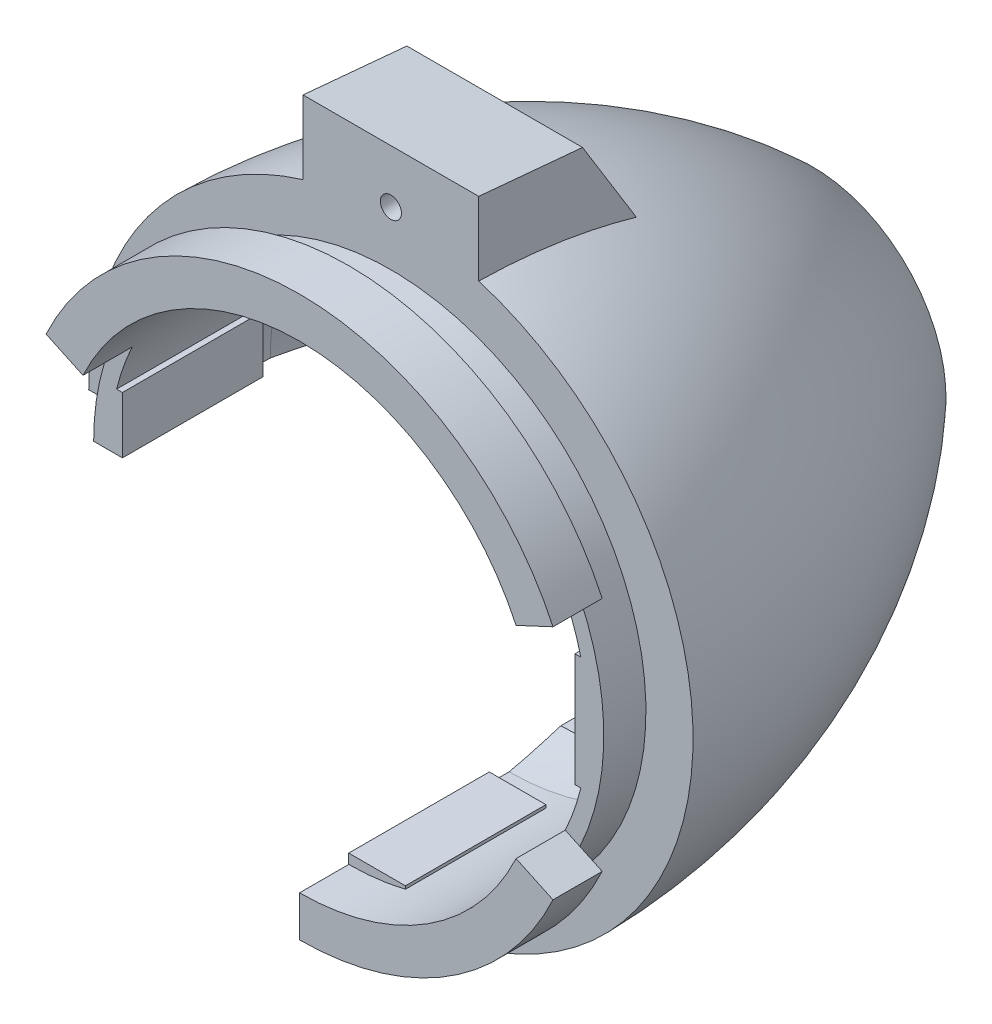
ISO-10303-21;
HEADER;
FILE_DESCRIPTION(('STEP AP214'),'2;1');
FILE_NAME('part.step','',(''),(''),'','','');
FILE_SCHEMA(('AUTOMOTIVE_DESIGN { 1 0 10303 214 1 1 1 1 }'));
ENDSEC;
DATA;
#1=APPLICATION_CONTEXT('core data for automotive mechanical design processes');
#2=APPLICATION_PROTOCOL_DEFINITION('international standard','automotive_design',2000,#1);
#3=PRODUCT_CONTEXT('',#1,'mechanical');
#4=PRODUCT('Part','Part','',(#3));
#5=PRODUCT_RELATED_PRODUCT_CATEGORY('part','',(#4));
#6=PRODUCT_DEFINITION_FORMATION('','',#4);
#7=PRODUCT_DEFINITION_CONTEXT('part definition',#1,'design');
#8=PRODUCT_DEFINITION('design','',#6,#7);
#9=PRODUCT_DEFINITION_SHAPE('','',#8);
#10=(LENGTH_UNIT() NAMED_UNIT(*) SI_UNIT(.MILLI.,.METRE.));
#11=(NAMED_UNIT(*) PLANE_ANGLE_UNIT() SI_UNIT($,.RADIAN.));
#12=(NAMED_UNIT(*) SI_UNIT($,.STERADIAN.) SOLID_ANGLE_UNIT());
#13=UNCERTAINTY_MEASURE_WITH_UNIT(LENGTH_MEASURE(1.E-05),#10,'distance_accuracy_value','');
#14=(GEOMETRIC_REPRESENTATION_CONTEXT(3) GLOBAL_UNCERTAINTY_ASSIGNED_CONTEXT((#13)) GLOBAL_UNIT_ASSIGNED_CONTEXT((#10,
#11,#12)) REPRESENTATION_CONTEXT('',''));
#15=CARTESIAN_POINT('',(0.,0.,0.));
#16=DIRECTION('',(0.,0.,1.));
#17=DIRECTION('',(1.,0.,0.));
#18=AXIS2_PLACEMENT_3D('',#15,#16,#17);
#19=CARTESIAN_POINT('',(0.,0.,3.));
#20=DIRECTION('',(0.,0.,1.));
#21=DIRECTION('',(1.,0.,0.));
#22=AXIS2_PLACEMENT_3D('',#19,#20,#21);
#23=PLANE('',#22);
#24=DIRECTION('',(0.,-1.,0.));
#25=VECTOR('',#24,1.);
#26=CARTESIAN_POINT('',(0.,0.,3.));
#27=LINE('',#26,#25);
#28=CARTESIAN_POINT('',(0.,-18.15,3.));
#29=VERTEX_POINT('',#28);
#30=CARTESIAN_POINT('',(0.,-19.9,3.));
#31=VERTEX_POINT('',#30);
#32=EDGE_CURVE('E1183',#29,#31,#27,.T.);
#33=ORIENTED_EDGE('',*,*,#32,.F.);
#34=CARTESIAN_POINT('',(0.,0.,3.));
#35=DIRECTION('',(0.,0.,1.));
#36=DIRECTION('',(1.,0.,0.));
#37=AXIS2_PLACEMENT_3D('',#34,#35,#36);
#38=CIRCLE('',#37,18.15);
#39=CARTESIAN_POINT('',(16.4494863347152,-7.67052145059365,3.));
#40=VERTEX_POINT('',#39);
#41=EDGE_CURVE('E1137',#29,#40,#38,.T.);
#42=ORIENTED_EDGE('',*,*,#41,.T.);
#43=DIRECTION('',(-0.906307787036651,0.422618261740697,0.));
#44=VECTOR('',#43,1.);
#45=CARTESIAN_POINT('',(15.4072323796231,-7.18451044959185,3.));
#46=LINE('',#45,#44);
#47=CARTESIAN_POINT('',(18.0355249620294,-8.41010340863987,3.));
#48=VERTEX_POINT('',#47);
#49=EDGE_CURVE('E1165',#48,#40,#46,.T.);
#50=ORIENTED_EDGE('',*,*,#49,.F.);
#51=CARTESIAN_POINT('',(0.,0.,3.));
#52=DIRECTION('',(0.,0.,1.));
#53=DIRECTION('',(1.,0.,0.));
#54=AXIS2_PLACEMENT_3D('',#51,#52,#53);
#55=CIRCLE('',#54,19.9);
#56=EDGE_CURVE('E1170',#31,#48,#55,.T.);
#57=ORIENTED_EDGE('',*,*,#56,.F.);
#58=EDGE_LOOP('',(#33,#42,#50,#57));
#59=FACE_BOUND('',#58,.T.);
#60=ADVANCED_FACE('F158',(#59),#23,.F.);
#61=CARTESIAN_POINT('',(0.,0.,6.5));
#62=DIRECTION('',(0.,0.,-1.));
#63=DIRECTION('',(-1.,0.,0.));
#64=AXIS2_PLACEMENT_3D('',#61,#62,#63);
#65=CYLINDRICAL_SURFACE('',#64,19.9);
#66=DIRECTION('',(0.,0.,-1.));
#67=VECTOR('',#66,1.);
#68=CARTESIAN_POINT('',(0.,-19.9,6.5));
#69=LINE('',#68,#67);
#70=CARTESIAN_POINT('',(0.,-19.9,6.5));
#71=VERTEX_POINT('',#70);
#72=EDGE_CURVE('E1238',#31,#71,#69,.F.);
#73=ORIENTED_EDGE('',*,*,#72,.F.);
#74=ORIENTED_EDGE('',*,*,#56,.T.);
#75=DIRECTION('',(0.,0.,-1.));
#76=VECTOR('',#75,1.);
#77=CARTESIAN_POINT('',(18.0355249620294,-8.41010340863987,6.5));
#78=LINE('',#77,#76);
#79=CARTESIAN_POINT('',(18.0355249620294,-8.41010340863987,6.5));
#80=VERTEX_POINT('',#79);
#81=EDGE_CURVE('E1144',#80,#48,#78,.T.);
#82=ORIENTED_EDGE('',*,*,#81,.F.);
#83=CARTESIAN_POINT('',(0.,0.,6.5));
#84=DIRECTION('',(0.,0.,1.));
#85=DIRECTION('',(1.,0.,0.));
#86=AXIS2_PLACEMENT_3D('',#83,#84,#85);
#87=CIRCLE('',#86,19.9);
#88=EDGE_CURVE('E1174',#71,#80,#87,.T.);
#89=ORIENTED_EDGE('',*,*,#88,.F.);
#90=EDGE_LOOP('',(#73,#74,#82,#89));
#91=FACE_BOUND('',#90,.T.);
#92=ADVANCED_FACE('F1094',(#91),#65,.T.);
#93=CARTESIAN_POINT('',(0.,0.,6.5));
#94=DIRECTION('',(0.,0.,1.));
#95=DIRECTION('',(1.,0.,0.));
#96=AXIS2_PLACEMENT_3D('',#93,#94,#95);
#97=PLANE('',#96);
#98=CARTESIAN_POINT('',(0.,0.,6.5));
#99=DIRECTION('',(0.,0.,-1.));
#100=DIRECTION('',(1.,0.,0.));
#101=AXIS2_PLACEMENT_3D('',#98,#99,#100);
#102=CIRCLE('',#101,17.);
#103=CARTESIAN_POINT('',(15.4072323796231,-7.18451044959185,6.5));
#104=VERTEX_POINT('',#103);
#105=CARTESIAN_POINT('',(0.,-17.,6.5));
#106=VERTEX_POINT('',#105);
#107=EDGE_CURVE('E1169',#104,#106,#102,.T.);
#108=ORIENTED_EDGE('',*,*,#107,.T.);
#109=DIRECTION('',(0.,-1.,0.));
#110=VECTOR('',#109,1.);
#111=CARTESIAN_POINT('',(0.,0.,6.5));
#112=LINE('',#111,#110);
#113=EDGE_CURVE('E1240',#106,#71,#112,.T.);
#114=ORIENTED_EDGE('',*,*,#113,.T.);
#115=ORIENTED_EDGE('',*,*,#88,.T.);
#116=DIRECTION('',(-0.906307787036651,0.422618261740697,0.));
#117=VECTOR('',#116,1.);
#118=CARTESIAN_POINT('',(15.4072323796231,-7.18451044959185,6.5));
#119=LINE('',#118,#117);
#120=EDGE_CURVE('E1175',#80,#104,#119,.T.);
#121=ORIENTED_EDGE('',*,*,#120,.T.);
#122=EDGE_LOOP('',(#108,#114,#115,#121));
#123=FACE_BOUND('',#122,.T.);
#124=ADVANCED_FACE('F1100',(#123),#97,.T.);
#125=CARTESIAN_POINT('',(4.03112887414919,-16.3,-7.));
#126=DIRECTION('',(0.,1.,0.));
#127=DIRECTION('',(0.,0.,1.));
#128=AXIS2_PLACEMENT_3D('',#125,#126,#127);
#129=PLANE('',#128);
#130=DIRECTION('',(-1.,0.,0.));
#131=VECTOR('',#130,1.);
#132=CARTESIAN_POINT('',(4.03112887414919,-16.3,-7.));
#133=LINE('',#132,#131);
#134=CARTESIAN_POINT('',(4.03112887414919,-16.3,-7.));
#135=VERTEX_POINT('',#134);
#136=CARTESIAN_POINT('',(0.,-16.3,-7.));
#137=VERTEX_POINT('',#136);
#138=EDGE_CURVE('E633',#135,#137,#133,.T.);
#139=ORIENTED_EDGE('',*,*,#138,.T.);
#140=DIRECTION('',(0.,0.,1.));
#141=VECTOR('',#140,1.);
#142=CARTESIAN_POINT('',(0.,-16.3,-7.));
#143=LINE('',#142,#141);
#144=CARTESIAN_POINT('',(0.,-16.3,3.));
#145=VERTEX_POINT('',#144);
#146=EDGE_CURVE('E620',#137,#145,#143,.T.);
#147=ORIENTED_EDGE('',*,*,#146,.T.);
#148=DIRECTION('',(-1.,0.,0.));
#149=VECTOR('',#148,1.);
#150=CARTESIAN_POINT('',(4.03112887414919,-16.3,3.));
#151=LINE('',#150,#149);
#152=CARTESIAN_POINT('',(4.03112887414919,-16.3,3.));
#153=VERTEX_POINT('',#152);
#154=EDGE_CURVE('E630',#153,#145,#151,.T.);
#155=ORIENTED_EDGE('',*,*,#154,.F.);
#156=DIRECTION('',(0.,0.,1.));
#157=VECTOR('',#156,1.);
#158=CARTESIAN_POINT('',(4.03112887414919,-16.3,-7.));
#159=LINE('',#158,#157);
#160=EDGE_CURVE('E655',#135,#153,#159,.T.);
#161=ORIENTED_EDGE('',*,*,#160,.F.);
#162=EDGE_LOOP('',(#139,#147,#155,#161));
#163=FACE_BOUND('',#162,.T.);
#164=ADVANCED_FACE('F629',(#163),#129,.T.);
#165=CARTESIAN_POINT('',(0.,0.,-7.));
#166=DIRECTION('',(0.,0.,1.));
#167=DIRECTION('',(1.,0.,0.));
#168=AXIS2_PLACEMENT_3D('',#165,#166,#167);
#169=PLANE('',#168);
#170=DIRECTION('',(0.,-1.,0.));
#171=VECTOR('',#170,1.);
#172=CARTESIAN_POINT('',(0.,0.,-7.));
#173=LINE('',#172,#171);
#174=CARTESIAN_POINT('',(0.,-17.,-7.));
#175=VERTEX_POINT('',#174);
#176=EDGE_CURVE('E1243',#137,#175,#173,.T.);
#177=ORIENTED_EDGE('',*,*,#176,.F.);
#178=ORIENTED_EDGE('',*,*,#138,.F.);
#179=DIRECTION('',(0.,1.,0.));
#180=VECTOR('',#179,1.);
#181=CARTESIAN_POINT('',(4.03112887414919,-16.3,-7.));
#182=LINE('',#181,#180);
#183=CARTESIAN_POINT('',(4.03112887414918,-16.5151445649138,-7.));
#184=VERTEX_POINT('',#183);
#185=EDGE_CURVE('E651',#184,#135,#182,.T.);
#186=ORIENTED_EDGE('',*,*,#185,.F.);
#187=CARTESIAN_POINT('',(0.,0.,-7.));
#188=DIRECTION('',(0.,0.,1.));
#189=DIRECTION('',(1.,0.,0.));
#190=AXIS2_PLACEMENT_3D('',#187,#188,#189);
#191=CIRCLE('',#190,17.);
#192=EDGE_CURVE('E649',#175,#184,#191,.T.);
#193=ORIENTED_EDGE('',*,*,#192,.F.);
#194=EDGE_LOOP('',(#177,#178,#186,#193));
#195=FACE_BOUND('',#194,.T.);
#196=ADVANCED_FACE('F1967',(#195),#169,.F.);
#197=CARTESIAN_POINT('',(0.,0.,3.));
#198=DIRECTION('',(0.,0.,1.));
#199=DIRECTION('',(1.,0.,0.));
#200=AXIS2_PLACEMENT_3D('',#197,#198,#199);
#201=PLANE('',#200);
#202=ORIENTED_EDGE('',*,*,#154,.T.);
#203=DIRECTION('',(0.,-1.,0.));
#204=VECTOR('',#203,1.);
#205=CARTESIAN_POINT('',(0.,0.,3.));
#206=LINE('',#205,#204);
#207=CARTESIAN_POINT('',(0.,-17.,3.));
#208=VERTEX_POINT('',#207);
#209=EDGE_CURVE('E166',#145,#208,#206,.T.);
#210=ORIENTED_EDGE('',*,*,#209,.T.);
#211=CARTESIAN_POINT('',(0.,0.,3.));
#212=DIRECTION('',(0.,0.,1.));
#213=DIRECTION('',(1.,0.,0.));
#214=AXIS2_PLACEMENT_3D('',#211,#212,#213);
#215=CIRCLE('',#214,17.);
#216=CARTESIAN_POINT('',(4.03112887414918,-16.5151445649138,3.));
#217=VERTEX_POINT('',#216);
#218=EDGE_CURVE('E638',#208,#217,#215,.T.);
#219=ORIENTED_EDGE('',*,*,#218,.T.);
#220=DIRECTION('',(0.,1.,0.));
#221=VECTOR('',#220,1.);
#222=CARTESIAN_POINT('',(4.03112887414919,-16.3,3.));
#223=LINE('',#222,#221);
#224=EDGE_CURVE('E637',#217,#153,#223,.T.);
#225=ORIENTED_EDGE('',*,*,#224,.T.);
#226=EDGE_LOOP('',(#202,#210,#219,#225));
#227=FACE_BOUND('',#226,.T.);
#228=ADVANCED_FACE('F635',(#227),#201,.T.);
#229=CARTESIAN_POINT('',(0.,0.,3.));
#230=DIRECTION('',(0.,0.,-1.));
#231=DIRECTION('',(-1.,0.,0.));
#232=AXIS2_PLACEMENT_3D('',#229,#230,#231);
#233=CYLINDRICAL_SURFACE('',#232,17.);
#234=DIRECTION('',(0.,0.,-1.));
#235=VECTOR('',#234,1.);
#236=CARTESIAN_POINT('',(-17.,0.,3.));
#237=LINE('',#236,#235);
#238=CARTESIAN_POINT('',(-17.,0.,-8.41172660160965));
#239=VERTEX_POINT('',#238);
#240=CARTESIAN_POINT('',(-17.,0.,-7.));
#241=VERTEX_POINT('',#240);
#242=EDGE_CURVE('E172',#239,#241,#237,.F.);
#243=ORIENTED_EDGE('',*,*,#242,.F.);
#244=CARTESIAN_POINT('',(0.,0.,-8.41172660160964));
#245=DIRECTION('',(0.,0.,1.));
#246=DIRECTION('',(1.,0.,0.));
#247=AXIS2_PLACEMENT_3D('',#244,#245,#246);
#248=CIRCLE('',#247,17.);
#249=CARTESIAN_POINT('',(0.,-17.,-8.41172660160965));
#250=VERTEX_POINT('',#249);
#251=EDGE_CURVE('E1023',#250,#239,#248,.T.);
#252=ORIENTED_EDGE('',*,*,#251,.F.);
#253=DIRECTION('',(0.,0.,-1.));
#254=VECTOR('',#253,1.);
#255=CARTESIAN_POINT('',(0.,-17.,3.));
#256=LINE('',#255,#254);
#257=EDGE_CURVE('E1189',#250,#175,#256,.F.);
#258=ORIENTED_EDGE('',*,*,#257,.T.);
#259=ORIENTED_EDGE('',*,*,#192,.T.);
#260=DIRECTION('',(0.,0.,1.));
#261=VECTOR('',#260,1.);
#262=CARTESIAN_POINT('',(4.03112887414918,-16.5151445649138,-7.));
#263=LINE('',#262,#261);
#264=EDGE_CURVE('E654',#184,#217,#263,.T.);
#265=ORIENTED_EDGE('',*,*,#264,.T.);
#266=ORIENTED_EDGE('',*,*,#218,.F.);
#267=EDGE_CURVE('E180',#208,#106,#256,.F.);
#268=ORIENTED_EDGE('',*,*,#267,.T.);
#269=ORIENTED_EDGE('',*,*,#107,.F.);
#270=DIRECTION('',(0.,0.,-1.));
#271=VECTOR('',#270,1.);
#272=CARTESIAN_POINT('',(15.4072323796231,-7.18451044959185,6.5));
#273=LINE('',#272,#271);
#274=CARTESIAN_POINT('',(15.4072323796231,-7.18451044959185,3.));
#275=VERTEX_POINT('',#274);
#276=EDGE_CURVE('E1164',#104,#275,#273,.T.);
#277=ORIENTED_EDGE('',*,*,#276,.T.);
#278=CARTESIAN_POINT('',(0.,0.,3.));
#279=DIRECTION('',(0.,0.,1.));
#280=DIRECTION('',(1.,0.,0.));
#281=AXIS2_PLACEMENT_3D('',#278,#279,#280);
#282=CIRCLE('',#281,17.);
#283=CARTESIAN_POINT('',(16.5151445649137,-4.03112887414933,3.));
#284=VERTEX_POINT('',#283);
#285=EDGE_CURVE('E1141',#275,#284,#282,.T.);
#286=ORIENTED_EDGE('',*,*,#285,.T.);
#287=DIRECTION('',(0.,0.,1.));
#288=VECTOR('',#287,1.);
#289=CARTESIAN_POINT('',(16.5151445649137,-4.03112887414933,-7.));
#290=LINE('',#289,#288);
#291=CARTESIAN_POINT('',(16.5151445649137,-4.03112887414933,-7.));
#292=VERTEX_POINT('',#291);
#293=EDGE_CURVE('E703',#292,#284,#290,.T.);
#294=ORIENTED_EDGE('',*,*,#293,.F.);
#295=CARTESIAN_POINT('',(0.,0.,-7.));
#296=DIRECTION('',(0.,0.,1.));
#297=DIRECTION('',(1.,0.,0.));
#298=AXIS2_PLACEMENT_3D('',#295,#296,#297);
#299=CIRCLE('',#298,17.);
#300=CARTESIAN_POINT('',(16.5151445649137,4.03112887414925,-7.));
#301=VERTEX_POINT('',#300);
#302=EDGE_CURVE('E696',#292,#301,#299,.T.);
#303=ORIENTED_EDGE('',*,*,#302,.T.);
#304=DIRECTION('',(0.,0.,1.));
#305=VECTOR('',#304,1.);
#306=CARTESIAN_POINT('',(16.5151445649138,4.03112887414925,-7.));
#307=LINE('',#306,#305);
#308=CARTESIAN_POINT('',(16.5151445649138,4.03112887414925,3.));
#309=VERTEX_POINT('',#308);
#310=EDGE_CURVE('E699',#301,#309,#307,.T.);
#311=ORIENTED_EDGE('',*,*,#310,.T.);
#312=CARTESIAN_POINT('',(15.4072323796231,7.18451044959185,3.));
#313=VERTEX_POINT('',#312);
#314=EDGE_CURVE('E1155',#309,#313,#282,.T.);
#315=ORIENTED_EDGE('',*,*,#314,.T.);
#316=DIRECTION('',(0.,0.,-1.));
#317=VECTOR('',#316,1.);
#318=CARTESIAN_POINT('',(15.4072323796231,7.18451044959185,6.5));
#319=LINE('',#318,#317);
#320=CARTESIAN_POINT('',(15.4072323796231,7.18451044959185,6.5));
#321=VERTEX_POINT('',#320);
#322=EDGE_CURVE('E1232',#321,#313,#319,.T.);
#323=ORIENTED_EDGE('',*,*,#322,.F.);
#324=CARTESIAN_POINT('',(0.,0.,6.5));
#325=DIRECTION('',(0.,0.,-1.));
#326=DIRECTION('',(1.,0.,0.));
#327=AXIS2_PLACEMENT_3D('',#324,#325,#326);
#328=CIRCLE('',#327,17.);
#329=CARTESIAN_POINT('',(-15.4072323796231,7.18451044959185,6.5));
#330=VERTEX_POINT('',#329);
#331=EDGE_CURVE('E1215',#330,#321,#328,.T.);
#332=ORIENTED_EDGE('',*,*,#331,.F.);
#333=DIRECTION('',(0.,0.,-1.));
#334=VECTOR('',#333,1.);
#335=CARTESIAN_POINT('',(-15.4072323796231,7.18451044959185,6.5));
#336=LINE('',#335,#334);
#337=CARTESIAN_POINT('',(-15.4072323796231,7.18451044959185,3.));
#338=VERTEX_POINT('',#337);
#339=EDGE_CURVE('E1224',#330,#338,#336,.T.);
#340=ORIENTED_EDGE('',*,*,#339,.T.);
#341=CARTESIAN_POINT('',(-16.5151445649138,4.03112887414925,3.));
#342=VERTEX_POINT('',#341);
#343=EDGE_CURVE('E1153',#338,#342,#282,.T.);
#344=ORIENTED_EDGE('',*,*,#343,.T.);
#345=DIRECTION('',(0.,0.,1.));
#346=VECTOR('',#345,1.);
#347=CARTESIAN_POINT('',(-16.5151445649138,4.03112887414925,-7.));
#348=LINE('',#347,#346);
#349=CARTESIAN_POINT('',(-16.5151445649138,4.03112887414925,-7.));
#350=VERTEX_POINT('',#349);
#351=EDGE_CURVE('E673',#350,#342,#348,.T.);
#352=ORIENTED_EDGE('',*,*,#351,.F.);
#353=CARTESIAN_POINT('',(0.,0.,-7.));
#354=DIRECTION('',(0.,0.,1.));
#355=DIRECTION('',(-1.,0.,0.));
#356=AXIS2_PLACEMENT_3D('',#353,#354,#355);
#357=CIRCLE('',#356,17.);
#358=EDGE_CURVE('E664',#350,#241,#357,.T.);
#359=ORIENTED_EDGE('',*,*,#358,.T.);
#360=EDGE_LOOP('',(#243,#252,#258,#259,#265,#266,#268,#269,#277,#286,#294,#303,#311,#315,#323,
#332,#340,#344,#352,#359));
#361=FACE_BOUND('',#360,.T.);
#362=DIRECTION('',(0.,0.,1.));
#363=VECTOR('',#362,1.);
#364=CARTESIAN_POINT('',(4.03112887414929,16.5151445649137,-7.));
#365=LINE('',#364,#363);
#366=CARTESIAN_POINT('',(4.03112887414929,16.5151445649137,-7.));
#367=VERTEX_POINT('',#366);
#368=CARTESIAN_POINT('',(4.03112887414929,16.5151445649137,3.));
#369=VERTEX_POINT('',#368);
#370=EDGE_CURVE('E737',#367,#369,#365,.T.);
#371=ORIENTED_EDGE('',*,*,#370,.F.);
#372=CARTESIAN_POINT('',(0.,0.,-7.));
#373=DIRECTION('',(0.,0.,1.));
#374=DIRECTION('',(1.,0.,0.));
#375=AXIS2_PLACEMENT_3D('',#372,#373,#374);
#376=CIRCLE('',#375,17.);
#377=CARTESIAN_POINT('',(-4.03112887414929,16.5151445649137,-7.));
#378=VERTEX_POINT('',#377);
#379=EDGE_CURVE('E726',#367,#378,#376,.T.);
#380=ORIENTED_EDGE('',*,*,#379,.T.);
#381=DIRECTION('',(0.,0.,1.));
#382=VECTOR('',#381,1.);
#383=CARTESIAN_POINT('',(-4.03112887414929,16.5151445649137,-7.));
#384=LINE('',#383,#382);
#385=CARTESIAN_POINT('',(-4.03112887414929,16.5151445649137,3.));
#386=VERTEX_POINT('',#385);
#387=EDGE_CURVE('E735',#378,#386,#384,.T.);
#388=ORIENTED_EDGE('',*,*,#387,.T.);
#389=CARTESIAN_POINT('',(0.,0.,3.));
#390=DIRECTION('',(0.,0.,1.));
#391=DIRECTION('',(1.,0.,0.));
#392=AXIS2_PLACEMENT_3D('',#389,#390,#391);
#393=CIRCLE('',#392,17.);
#394=EDGE_CURVE('E714',#369,#386,#393,.T.);
#395=ORIENTED_EDGE('',*,*,#394,.F.);
#396=EDGE_LOOP('',(#371,#380,#388,#395));
#397=FACE_BOUND('',#396,.T.);
#398=ADVANCED_FACE('F1035',(#361,#397),#233,.F.);
#399=CARTESIAN_POINT('',(0.,0.,0.694009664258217));
#400=DIRECTION('',(0.,0.,1.));
#401=DIRECTION('',(1.,0.,0.));
#402=AXIS2_PLACEMENT_3D('',#399,#400,#401);
#403=DEGENERATE_TOROIDAL_SURFACE('',#402,23.7350241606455,45.2403477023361,.F.);
#404=CARTESIAN_POINT('',(23.7350241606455,0.,0.694009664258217));
#405=DIRECTION('',(0.,1.,0.));
#406=DIRECTION('',(0.,0.,1.));
#407=AXIS2_PLACEMENT_3D('',#404,#405,#406);
#408=CIRCLE('',#407,45.2403477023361);
#409=CARTESIAN_POINT('',(-21.5,0.,0.));
#410=VERTEX_POINT('',#409);
#411=CARTESIAN_POINT('',(-9.5,0.,-30.));
#412=VERTEX_POINT('',#411);
#413=EDGE_CURVE('E1283',#410,#412,#408,.F.);
#414=ORIENTED_EDGE('',*,*,#413,.F.);
#415=CARTESIAN_POINT('',(0.,0.,0.));
#416=DIRECTION('',(0.,0.,1.));
#417=DIRECTION('',(1.,0.,0.));
#418=AXIS2_PLACEMENT_3D('',#415,#416,#417);
#419=CIRCLE('',#418,21.5);
#420=CARTESIAN_POINT('',(-6.25,20.5715215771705,0.));
#421=VERTEX_POINT('',#420);
#422=EDGE_CURVE('E1199',#421,#410,#419,.T.);
#423=ORIENTED_EDGE('',*,*,#422,.F.);
#424=CARTESIAN_POINT('',(-6.25,20.0974227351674,-5.73054654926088));
#425=CARTESIAN_POINT('',(-6.25,19.9190805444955,-6.91755226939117));
#426=CARTESIAN_POINT('',(-6.25,19.6911179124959,-8.09751605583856));
#427=CARTESIAN_POINT('',(-6.25,19.1369747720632,-10.434783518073));
#428=CARTESIAN_POINT('',(-6.25,18.8107289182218,-11.5920715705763));
#429=CARTESIAN_POINT('',(-6.25,18.0603321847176,-13.8785739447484));
#430=CARTESIAN_POINT('',(-6.25,17.6358759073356,-15.0076882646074));
#431=CARTESIAN_POINT('',(-6.25,16.6914813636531,-17.2248536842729));
#432=CARTESIAN_POINT('',(-6.25,16.1715823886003,-18.3129214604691));
#433=CARTESIAN_POINT('',(-6.25,15.1595752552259,-20.2108132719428));
#434=CARTESIAN_POINT('',(-6.25,14.6854196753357,-21.0302650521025));
#435=CARTESIAN_POINT('',(-6.25,13.6795137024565,-22.6335169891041));
#436=CARTESIAN_POINT('',(-6.25,13.1477519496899,-23.4173100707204));
#437=CARTESIAN_POINT('',(-6.25,12.3083051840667,-24.5595315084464));
#438=CARTESIAN_POINT('',(-6.25,12.022163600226,-24.933946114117));
#439=CARTESIAN_POINT('',(-6.25,11.4355089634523,-25.6713226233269));
#440=CARTESIAN_POINT('',(-6.25,11.134997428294,-26.034285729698));
#441=CARTESIAN_POINT('',(-6.25,10.5195410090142,-26.7474130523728));
#442=CARTESIAN_POINT('',(-6.25,10.2046043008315,-27.09758432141));
#443=CARTESIAN_POINT('',(-6.25,9.55979046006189,-27.7838236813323));
#444=CARTESIAN_POINT('',(-6.25,9.22991600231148,-28.1198942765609));
#445=CARTESIAN_POINT('',(-6.25,8.64315570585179,-28.6899105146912));
#446=CARTESIAN_POINT('',(-6.25,8.38982386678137,-28.9275191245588));
#447=CARTESIAN_POINT('',(-6.25,7.87430611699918,-29.3929085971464));
#448=CARTESIAN_POINT('',(-6.25,7.61212105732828,-29.6206903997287));
#449=CARTESIAN_POINT('',(-6.25,7.07757723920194,-30.0657006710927));
#450=CARTESIAN_POINT('',(-6.25,6.80519024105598,-30.2828953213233));
#451=CARTESIAN_POINT('',(-6.25,6.25032428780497,-30.7040492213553));
#452=CARTESIAN_POINT('',(-6.25,5.96784531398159,-30.908008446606));
#453=CARTESIAN_POINT('',(-6.25,5.3885007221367,-31.3023367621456));
#454=CARTESIAN_POINT('',(-6.25,5.09150297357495,-31.4925129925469));
#455=CARTESIAN_POINT('',(-6.25,4.48520684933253,-31.8526095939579));
#456=CARTESIAN_POINT('',(-6.25,4.17590421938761,-32.0225228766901));
#457=CARTESIAN_POINT('',(-6.25,3.54570295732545,-32.3356237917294));
#458=CARTESIAN_POINT('',(-6.25,3.22486529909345,-32.4789326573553));
#459=CARTESIAN_POINT('',(-6.25,2.57026862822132,-32.732083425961));
#460=CARTESIAN_POINT('',(-6.25,2.23652415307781,-32.841961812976));
#461=CARTESIAN_POINT('',(-6.25,1.68969818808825,-32.9849431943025));
#462=CARTESIAN_POINT('',(-6.25,1.48006236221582,-33.0312922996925));
#463=CARTESIAN_POINT('',(-6.25,1.05762173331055,-33.106244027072));
#464=CARTESIAN_POINT('',(-6.25,0.844817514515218,-33.1348498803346));
#465=CARTESIAN_POINT('',(-6.25,0.41784282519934,-33.1728916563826));
#466=CARTESIAN_POINT('',(-6.25,0.203675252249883,-33.1823597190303));
#467=CARTESIAN_POINT('',(-6.25,-0.224638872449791,-33.181723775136));
#468=CARTESIAN_POINT('',(-6.25,-0.43878542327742,-33.1716191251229));
#469=CARTESIAN_POINT('',(-6.25,-0.864621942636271,-33.1324325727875));
#470=CARTESIAN_POINT('',(-6.25,-1.07631755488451,-33.1034110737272));
#471=CARTESIAN_POINT('',(-6.25,-1.49652774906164,-33.027843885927));
#472=CARTESIAN_POINT('',(-6.25,-1.70504215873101,-32.9812972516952));
#473=CARTESIAN_POINT('',(-6.25,-2.11844761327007,-32.8724426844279));
#474=CARTESIAN_POINT('',(-6.25,-2.32332784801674,-32.8100941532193));
#475=CARTESIAN_POINT('',(-6.25,-2.72840811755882,-32.6717468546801));
#476=CARTESIAN_POINT('',(-6.25,-2.92860765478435,-32.5957466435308));
#477=CARTESIAN_POINT('',(-6.25,-3.30922539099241,-32.4382111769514));
#478=CARTESIAN_POINT('',(-6.25,-3.48999758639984,-32.3575242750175));
#479=CARTESIAN_POINT('',(-6.25,-3.84742695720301,-32.1874729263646));
#480=CARTESIAN_POINT('',(-6.25,-4.02408337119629,-32.0981068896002));
#481=CARTESIAN_POINT('',(-6.25,-4.54825297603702,-31.8186516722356));
#482=CARTESIAN_POINT('',(-6.25,-4.8897777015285,-31.6172861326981));
#483=CARTESIAN_POINT('',(-6.25,-5.55887648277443,-31.1910851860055));
#484=CARTESIAN_POINT('',(-6.25,-5.88641139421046,-30.9661893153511));
#485=CARTESIAN_POINT('',(-6.25,-6.52811793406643,-30.4979082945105));
#486=CARTESIAN_POINT('',(-6.25,-6.8422842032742,-30.2545158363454));
#487=CARTESIAN_POINT('',(-6.25,-7.47311000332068,-29.7403457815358));
#488=CARTESIAN_POINT('',(-6.25,-7.78915076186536,-29.4688124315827));
#489=CARTESIAN_POINT('',(-6.25,-8.40840541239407,-28.9116159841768));
#490=CARTESIAN_POINT('',(-6.25,-8.71162087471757,-28.625954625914));
#491=CARTESIAN_POINT('',(-6.25,-9.30615634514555,-28.0420252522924));
#492=CARTESIAN_POINT('',(-6.25,-9.5974656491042,-27.7437463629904));
#493=CARTESIAN_POINT('',(-6.25,-10.1683401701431,-27.136159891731));
#494=CARTESIAN_POINT('',(-6.25,-10.4479050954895,-26.8268520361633));
#495=CARTESIAN_POINT('',(-6.25,-10.995718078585,-26.1980820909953));
#496=CARTESIAN_POINT('',(-6.25,-11.2639598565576,-25.8786145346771));
#497=CARTESIAN_POINT('',(-6.25,-11.7891473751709,-25.2305116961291));
#498=CARTESIAN_POINT('',(-6.25,-12.046092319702,-24.9018757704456));
#499=CARTESIAN_POINT('',(-6.25,-12.7999504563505,-23.9035337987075));
#500=CARTESIAN_POINT('',(-6.25,-13.2801262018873,-23.2211174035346));
#501=CARTESIAN_POINT('',(-6.25,-14.3743927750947,-21.5554276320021));
#502=CARTESIAN_POINT('',(-6.25,-14.9677787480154,-20.5585165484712));
#503=CARTESIAN_POINT('',(-6.25,-16.0678584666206,-18.5176652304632));
#504=CARTESIAN_POINT('',(-6.25,-16.5745201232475,-17.4737077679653));
#505=CARTESIAN_POINT('',(-6.25,-17.4994591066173,-15.3474451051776));
#506=CARTESIAN_POINT('',(-6.25,-17.9177412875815,-14.2651420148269));
#507=CARTESIAN_POINT('',(-6.25,-18.6643797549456,-12.0701228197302));
#508=CARTESIAN_POINT('',(-6.25,-18.99274604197,-10.9574101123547));
#509=CARTESIAN_POINT('',(-6.25,-19.5599722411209,-8.70227251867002));
#510=CARTESIAN_POINT('',(-6.25,-19.7982803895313,-7.55970890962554));
#511=CARTESIAN_POINT('',(-6.25,-20.181521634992,-5.25900918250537));
#512=CARTESIAN_POINT('',(-6.25,-20.3264521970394,-4.100872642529));
#513=CARTESIAN_POINT('',(-6.25,-20.5222053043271,-1.77730813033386));
#514=CARTESIAN_POINT('',(-6.25,-20.5730788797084,-0.611884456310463));
#515=CARTESIAN_POINT('',(-6.25,-20.580636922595,1.71926479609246));
#516=CARTESIAN_POINT('',(-6.25,-20.5373206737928,2.88499037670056));
#517=CARTESIAN_POINT('',(-6.25,-20.3530412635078,5.25615487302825));
#518=CARTESIAN_POINT('',(-6.25,-20.2082023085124,6.46129465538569));
#519=CARTESIAN_POINT('',(-6.25,-19.8174887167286,8.85517045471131));
#520=CARTESIAN_POINT('',(-6.25,-19.5716065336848,10.043905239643));
#521=CARTESIAN_POINT('',(-6.25,-18.9792187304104,12.3993423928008));
#522=CARTESIAN_POINT('',(-6.25,-18.6324547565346,13.5659798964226));
#523=CARTESIAN_POINT('',(-6.25,-17.8402054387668,15.8650342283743));
#524=CARTESIAN_POINT('',(-6.25,-17.3947342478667,16.9974559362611));
#525=CARTESIAN_POINT('',(-6.25,-16.4090033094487,19.2142132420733));
#526=CARTESIAN_POINT('',(-6.25,-15.8691959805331,20.2987487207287));
#527=CARTESIAN_POINT('',(-6.25,-14.988597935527,21.8862979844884));
#528=CARTESIAN_POINT('',(-6.25,-14.6831038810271,22.4091554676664));
#529=CARTESIAN_POINT('',(-6.25,-14.0485999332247,23.4403749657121));
#530=CARTESIAN_POINT('',(-6.25,-13.7195930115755,23.948738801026));
#531=CARTESIAN_POINT('',(-6.25,-13.0399257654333,24.9467971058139));
#532=CARTESIAN_POINT('',(-6.25,-12.689390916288,25.4365770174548));
#533=CARTESIAN_POINT('',(-6.25,-11.9650392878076,26.3985154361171));
#534=CARTESIAN_POINT('',(-6.25,-11.5912263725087,26.8706768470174));
#535=CARTESIAN_POINT('',(-6.25,-10.8203545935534,27.7947880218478));
#536=CARTESIAN_POINT('',(-6.25,-10.423321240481,28.2467590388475));
#537=CARTESIAN_POINT('',(-6.25,-9.60504102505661,29.1280791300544));
#538=CARTESIAN_POINT('',(-6.25,-9.1838024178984,29.5574358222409));
#539=CARTESIAN_POINT('',(-6.25,-8.49975957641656,30.2130540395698));
#540=CARTESIAN_POINT('',(-6.25,-8.24548982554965,30.4482544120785));
#541=CARTESIAN_POINT('',(-6.25,-7.72806471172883,30.9086413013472));
#542=CARTESIAN_POINT('',(-6.25,-7.46491045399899,31.1338290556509));
#543=CARTESIAN_POINT('',(-6.25,-6.92834368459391,31.5734173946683));
#544=CARTESIAN_POINT('',(-6.25,-6.65490189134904,31.787782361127));
#545=CARTESIAN_POINT('',(-6.25,-6.09784617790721,32.2029200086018));
#546=CARTESIAN_POINT('',(-6.25,-5.81423207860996,32.4036924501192));
#547=CARTESIAN_POINT('',(-6.25,-5.23212285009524,32.7913563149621));
#548=CARTESIAN_POINT('',(-6.25,-4.93348067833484,32.978029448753));
#549=CARTESIAN_POINT('',(-6.25,-4.47632994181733,33.2421489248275));
#550=CARTESIAN_POINT('',(-6.25,-4.32240074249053,33.3275474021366));
#551=CARTESIAN_POINT('',(-6.25,-4.01125129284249,33.4923966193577));
#552=CARTESIAN_POINT('',(-6.25,-3.85402876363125,33.5718430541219));
#553=CARTESIAN_POINT('',(-6.25,-3.37920741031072,33.7991488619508));
#554=CARTESIAN_POINT('',(-6.25,-3.05670041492,33.9370067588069));
#555=CARTESIAN_POINT('',(-6.25,-2.39902424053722,34.1778704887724));
#556=CARTESIAN_POINT('',(-6.25,-2.06387147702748,34.2809198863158));
#557=CARTESIAN_POINT('',(-6.25,-1.5154201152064,34.4117924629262));
#558=CARTESIAN_POINT('',(-6.25,-1.30536516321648,34.4532875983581));
#559=CARTESIAN_POINT('',(-6.25,-0.882461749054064,34.5181802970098));
#560=CARTESIAN_POINT('',(-6.25,-0.669613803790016,34.5415811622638));
#561=CARTESIAN_POINT('',(-6.25,-0.242927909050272,34.5690978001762));
#562=CARTESIAN_POINT('',(-6.25,-0.0290915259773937,34.5732375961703));
#563=CARTESIAN_POINT('',(-6.25,0.398078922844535,34.5620802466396));
#564=CARTESIAN_POINT('',(-6.25,0.611412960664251,34.5467820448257));
#565=CARTESIAN_POINT('',(-6.25,1.03489291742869,34.4976541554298));
#566=CARTESIAN_POINT('',(-6.25,1.24504908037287,34.4639114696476));
#567=CARTESIAN_POINT('',(-6.25,1.66190227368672,34.3795047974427));
#568=CARTESIAN_POINT('',(-6.25,1.86859914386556,34.3288400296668));
#569=CARTESIAN_POINT('',(-6.25,2.2781841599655,34.2123996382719));
#570=CARTESIAN_POINT('',(-6.25,2.48106193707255,34.1465879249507));
#571=CARTESIAN_POINT('',(-6.25,2.88210035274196,34.0019374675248));
#572=CARTESIAN_POINT('',(-6.25,3.08026053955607,33.9230974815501));
#573=CARTESIAN_POINT('',(-6.25,3.46452697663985,33.7573676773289));
#574=CARTESIAN_POINT('',(-6.25,3.65080841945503,33.6708810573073));
#575=CARTESIAN_POINT('',(-6.25,4.01898250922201,33.4889783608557));
#576=CARTESIAN_POINT('',(-6.25,4.2008742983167,33.3935605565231));
#577=CARTESIAN_POINT('',(-6.25,4.56050867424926,33.1949530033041));
#578=CARTESIAN_POINT('',(-6.25,4.73824837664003,33.0917580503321));
#579=CARTESIAN_POINT('',(-6.25,5.08965462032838,32.8786343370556));
#580=CARTESIAN_POINT('',(-6.25,5.26332064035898,32.7687047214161));
#581=CARTESIAN_POINT('',(-6.25,5.77936490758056,32.429505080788));
#582=CARTESIAN_POINT('',(-6.25,6.11590752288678,32.1913208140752));
#583=CARTESIAN_POINT('',(-6.25,6.77486258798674,31.6960889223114));
#584=CARTESIAN_POINT('',(-6.25,7.09726945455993,31.4390339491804));
#585=CARTESIAN_POINT('',(-6.25,7.74172949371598,30.8986143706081));
#586=CARTESIAN_POINT('',(-6.25,8.06324171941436,30.6146063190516));
#587=CARTESIAN_POINT('',(-6.25,8.69289616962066,30.032267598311));
#588=CARTESIAN_POINT('',(-6.25,9.00104006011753,29.7339387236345));
#589=CARTESIAN_POINT('',(-6.25,9.60487529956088,29.1244462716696));
#590=CARTESIAN_POINT('',(-6.25,9.90055563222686,28.8132718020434));
#591=CARTESIAN_POINT('',(-6.25,10.4795914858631,28.1796643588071));
#592=CARTESIAN_POINT('',(-6.25,10.7629466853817,27.8572310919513));
#593=CARTESIAN_POINT('',(-6.25,11.317687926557,27.2020341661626));
#594=CARTESIAN_POINT('',(-6.25,11.5890695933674,26.8692668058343));
#595=CARTESIAN_POINT('',(-6.25,12.1199167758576,26.1943453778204));
#596=CARTESIAN_POINT('',(-6.25,12.3793814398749,25.8521906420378));
#597=CARTESIAN_POINT('',(-6.25,13.1398407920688,24.8129876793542));
#598=CARTESIAN_POINT('',(-6.25,13.6231424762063,24.1029137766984));
#599=CARTESIAN_POINT('',(-6.25,14.7066484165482,22.393980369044));
#600=CARTESIAN_POINT('',(-6.25,15.2870076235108,21.3825063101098));
#601=CARTESIAN_POINT('',(-6.25,16.3598627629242,19.3137389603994));
#602=CARTESIAN_POINT('',(-6.25,16.8523275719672,18.2564296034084));
#603=CARTESIAN_POINT('',(-6.25,17.7478938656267,16.1040163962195));
#604=CARTESIAN_POINT('',(-6.25,18.1509609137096,15.0088981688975));
#605=CARTESIAN_POINT('',(-6.25,18.6870502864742,13.3446335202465));
#606=CARTESIAN_POINT('',(-6.25,18.8543248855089,12.7862949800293));
#607=CARTESIAN_POINT('',(-6.25,19.1659661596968,11.6631133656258));
#608=CARTESIAN_POINT('',(-6.25,19.3103273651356,11.0982687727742));
#609=CARTESIAN_POINT('',(-6.25,19.7102100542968,9.3892469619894));
#610=CARTESIAN_POINT('',(-6.25,19.930574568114,8.23665849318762));
#611=CARTESIAN_POINT('',(-6.25,20.2767151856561,5.91736886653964));
#612=CARTESIAN_POINT('',(-6.25,20.4024911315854,4.75066768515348));
#613=CARTESIAN_POINT('',(-6.25,20.5197252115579,2.99727619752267));
#614=CARTESIAN_POINT('',(-6.25,20.5469057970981,2.41278090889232));
#615=CARTESIAN_POINT('',(-6.25,20.5775515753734,1.243256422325));
#616=CARTESIAN_POINT('',(-6.25,20.5810217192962,0.658227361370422));
#617=CARTESIAN_POINT('',(-6.25,20.5642537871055,-0.511221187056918));
#618=CARTESIAN_POINT('',(-6.25,20.5440261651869,-1.09564082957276));
#619=CARTESIAN_POINT('',(-6.25,20.4799061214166,-2.26315920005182));
#620=CARTESIAN_POINT('',(-6.25,20.4360150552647,-2.84625800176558));
#621=CARTESIAN_POINT('',(-6.25,20.3434817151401,-3.81312085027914));
#622=CARTESIAN_POINT('',(-6.25,20.3014797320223,-4.19753066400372));
#623=CARTESIAN_POINT('',(-6.25,20.2071755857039,-4.96505272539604));
#624=CARTESIAN_POINT('',(-6.25,20.1548738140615,-5.34816502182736));
#625=CARTESIAN_POINT('',(-6.25,20.0974227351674,-5.73054654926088));
#626=B_SPLINE_CURVE_WITH_KNOTS('',3,(#424,#425,#426,#427,#428,#429,#430,#431,#432,#433,#434,
#435,#436,#437,#438,#439,#440,#441,#442,#443,#444,#445,#446,#447,#448,#449,#450,#451,#452,#453,
#454,#455,#456,#457,#458,#459,#460,#461,#462,#463,#464,#465,#466,#467,#468,#469,#470,#471,#472,
#473,#474,#475,#476,#477,#478,#479,#480,#481,#482,#483,#484,#485,#486,#487,#488,#489,#490,#491,
#492,#493,#494,#495,#496,#497,#498,#499,#500,#501,#502,#503,#504,#505,#506,#507,#508,#509,#510,
#511,#512,#513,#514,#515,#516,#517,#518,#519,#520,#521,#522,#523,#524,#525,#526,#527,#528,#529,
#530,#531,#532,#533,#534,#535,#536,#537,#538,#539,#540,#541,#542,#543,#544,#545,#546,#547,#548,
#549,#550,#551,#552,#553,#554,#555,#556,#557,#558,#559,#560,#561,#562,#563,#564,#565,#566,#567,
#568,#569,#570,#571,#572,#573,#574,#575,#576,#577,#578,#579,#580,#581,#582,#583,#584,#585,#586,
#587,#588,#589,#590,#591,#592,#593,#594,#595,#596,#597,#598,#599,#600,#601,#602,#603,#604,#605,
#606,#607,#608,#609,#610,#611,#612,#613,#614,#615,#616,#617,#618,#619,#620,#621,#622,#623,#624,
#625),.UNSPECIFIED.,.T.,.F.,(4,2,2,2,2,2,2,2,2,2,2,2,2,2,2,2,2,2,2,2,2,2,2,2,2,2,2,2,2,2,2,2,2,
2,2,2,2,2,2,2,2,2,2,2,2,2,2,2,2,2,2,2,2,2,2,2,2,2,2,2,2,2,2,2,2,2,2,2,2,2,2,2,2,2,2,2,2,2,2,2,2,
2,2,2,2,2,2,2,2,2,2,2,2,2,2,2,2,2,2,2,4),(0.,3.60064095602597,7.20368116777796,10.8180797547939,
14.4309937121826,17.2690666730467,20.1077003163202,21.5211212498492,22.9343932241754,
24.3468738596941,25.7591025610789,26.8008595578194,27.84251669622,28.8873082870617,
29.9321018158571,30.9894559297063,32.0471788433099,33.0999567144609,34.1515814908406,
34.7950263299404,35.438353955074,36.0806002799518,36.7228677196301,37.3630943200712,
38.0033554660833,38.6452785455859,39.2872695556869,39.8808945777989,40.4746285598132,
41.6627103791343,42.8539237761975,44.0456102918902,45.2951233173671,46.5444829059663,
47.7949420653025,49.0454322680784,50.2966071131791,51.5478699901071,54.0493019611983,
57.525220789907,61.0024229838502,64.4794341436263,67.9560584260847,71.4536504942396,
74.9513375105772,78.4471263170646,81.9429417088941,85.580045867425,89.2174217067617,
92.864195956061,96.5104476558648,100.139669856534,101.955846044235,103.771793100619,
105.578009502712,107.383926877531,109.187896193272,110.991253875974,112.030150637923,
113.068918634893,114.110908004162,115.152915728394,116.208682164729,116.736661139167,
117.265018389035,118.315644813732,119.36495141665,120.006612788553,120.648157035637,
121.288900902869,121.929679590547,122.567461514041,123.205272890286,123.844619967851,
124.484028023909,125.099896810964,125.715884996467,126.332289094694,126.948771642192,
128.184765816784,129.421243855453,130.707696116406,131.993987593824,133.281393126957,
134.568832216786,135.856737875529,137.144735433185,139.719607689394,143.213516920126,
146.708660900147,150.205148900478,151.953305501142,153.701878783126,157.218118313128,
160.734363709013,162.48934451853,164.243958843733,165.99779941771,167.751539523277,
168.91149258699,170.071401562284),.UNSPECIFIED.);
#627=CARTESIAN_POINT('',(-6.25,18.9036370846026,-11.2138353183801));
#628=VERTEX_POINT('',#627);
#629=EDGE_CURVE('E1016',#421,#628,#626,.T.);
#630=ORIENTED_EDGE('',*,*,#629,.T.);
#631=CARTESIAN_POINT('',(-6.2501999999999,18.9035567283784,-11.213884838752));
#632=CARTESIAN_POINT('',(-5.87882751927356,19.0528246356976,-11.1218969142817));
#633=CARTESIAN_POINT('',(-5.50021741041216,19.1891062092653,-11.0379119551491));
#634=CARTESIAN_POINT('',(-4.73100368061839,19.4345739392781,-10.8866398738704));
#635=CARTESIAN_POINT('',(-4.34039819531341,19.5437558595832,-10.8193553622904));
#636=CARTESIAN_POINT('',(-3.55007109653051,19.7337873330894,-10.702246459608));
#637=CARTESIAN_POINT('',(-3.15035608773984,19.8146567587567,-10.6524098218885));
#638=CARTESIAN_POINT('',(-2.34435967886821,19.9473386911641,-10.5706431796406));
#639=CARTESIAN_POINT('',(-1.93807889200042,19.999153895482,-10.5387115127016));
#640=CARTESIAN_POINT('',(-1.12109284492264,20.0732511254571,-10.493048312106));
#641=CARTESIAN_POINT('',(-0.71038108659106,20.0954813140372,-10.4793487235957));
#642=CARTESIAN_POINT('',(0.111769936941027,20.1100027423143,-10.4703997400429));
#643=CARTESIAN_POINT('',(0.523209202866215,20.1022939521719,-10.4751503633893));
#644=CARTESIAN_POINT('',(1.34349765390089,20.0570333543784,-10.5030426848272));
#645=CARTESIAN_POINT('',(1.75234863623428,20.0195052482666,-10.5261697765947));
#646=CARTESIAN_POINT('',(2.56467547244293,19.9150697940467,-10.590529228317));
#647=CARTESIAN_POINT('',(2.96815274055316,19.848170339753,-10.6317567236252));
#648=CARTESIAN_POINT('',(3.86416271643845,19.6659026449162,-10.7440811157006));
#649=CARTESIAN_POINT('',(4.35454539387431,19.5427119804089,-10.8199986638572));
#650=CARTESIAN_POINT('',(5.07646535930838,19.3262747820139,-10.9533803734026));
#651=CARTESIAN_POINT('',(5.31474429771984,19.2488882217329,-11.0010706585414));
#652=CARTESIAN_POINT('',(5.78632039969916,19.0838509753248,-11.1027766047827));
#653=CARTESIAN_POINT('',(6.01961804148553,18.9962012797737,-11.1567916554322));
#654=CARTESIAN_POINT('',(6.25019999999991,18.9035567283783,-11.213884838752));
#655=B_SPLINE_CURVE_WITH_KNOTS('',3,(#631,#632,#633,#634,#635,#636,#637,#638,#639,#640,#641,
#642,#643,#644,#645,#646,#647,#648,#649,#650,#651,#652,#653,#654),.UNSPECIFIED.,.F.,.F.,(4,2,2,
2,2,2,2,2,2,2,2,4),(0.,1.23175346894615,2.46369936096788,3.69477881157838,4.92574394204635,
6.15886306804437,7.39198342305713,8.62412462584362,9.85593488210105,11.3866783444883,
12.1514860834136,12.9162200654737),.UNSPECIFIED.);
#656=CARTESIAN_POINT('',(6.25,18.9036370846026,-11.2138353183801));
#657=VERTEX_POINT('',#656);
#658=EDGE_CURVE('E1044',#628,#657,#655,.T.);
#659=ORIENTED_EDGE('',*,*,#658,.T.);
#660=CARTESIAN_POINT('',(6.25,20.0974227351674,-5.73054654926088));
#661=CARTESIAN_POINT('',(6.25,19.9190805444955,-6.91755226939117));
#662=CARTESIAN_POINT('',(6.25,19.6911179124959,-8.09751605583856));
#663=CARTESIAN_POINT('',(6.25,19.1369747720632,-10.434783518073));
#664=CARTESIAN_POINT('',(6.25,18.8107289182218,-11.5920715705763));
#665=CARTESIAN_POINT('',(6.25,18.0603321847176,-13.8785739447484));
#666=CARTESIAN_POINT('',(6.25,17.6358759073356,-15.0076882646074));
#667=CARTESIAN_POINT('',(6.25,16.6914813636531,-17.2248536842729));
#668=CARTESIAN_POINT('',(6.25,16.1715823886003,-18.3129214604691));
#669=CARTESIAN_POINT('',(6.25,15.1595752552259,-20.2108132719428));
#670=CARTESIAN_POINT('',(6.25,14.6854196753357,-21.0302650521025));
#671=CARTESIAN_POINT('',(6.25,13.6795137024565,-22.6335169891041));
#672=CARTESIAN_POINT('',(6.25,13.1477519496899,-23.4173100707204));
#673=CARTESIAN_POINT('',(6.25,12.3083051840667,-24.5595315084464));
#674=CARTESIAN_POINT('',(6.25,12.022163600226,-24.933946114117));
#675=CARTESIAN_POINT('',(6.25,11.4355089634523,-25.6713226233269));
#676=CARTESIAN_POINT('',(6.25,11.134997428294,-26.034285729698));
#677=CARTESIAN_POINT('',(6.25,10.5195410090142,-26.7474130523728));
#678=CARTESIAN_POINT('',(6.25,10.2046043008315,-27.09758432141));
#679=CARTESIAN_POINT('',(6.25,9.55979046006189,-27.7838236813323));
#680=CARTESIAN_POINT('',(6.25,9.22991600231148,-28.1198942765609));
#681=CARTESIAN_POINT('',(6.25,8.64315570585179,-28.6899105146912));
#682=CARTESIAN_POINT('',(6.25,8.38982386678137,-28.9275191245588));
#683=CARTESIAN_POINT('',(6.25,7.87430611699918,-29.3929085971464));
#684=CARTESIAN_POINT('',(6.25,7.61212105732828,-29.6206903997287));
#685=CARTESIAN_POINT('',(6.25,7.07757723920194,-30.0657006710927));
#686=CARTESIAN_POINT('',(6.25,6.80519024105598,-30.2828953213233));
#687=CARTESIAN_POINT('',(6.25,6.25032428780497,-30.7040492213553));
#688=CARTESIAN_POINT('',(6.25,5.96784531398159,-30.908008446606));
#689=CARTESIAN_POINT('',(6.25,5.3885007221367,-31.3023367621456));
#690=CARTESIAN_POINT('',(6.25,5.09150297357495,-31.4925129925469));
#691=CARTESIAN_POINT('',(6.25,4.48520684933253,-31.8526095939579));
#692=CARTESIAN_POINT('',(6.25,4.17590421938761,-32.0225228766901));
#693=CARTESIAN_POINT('',(6.25,3.54570295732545,-32.3356237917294));
#694=CARTESIAN_POINT('',(6.25,3.22486529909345,-32.4789326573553));
#695=CARTESIAN_POINT('',(6.25,2.57026862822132,-32.732083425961));
#696=CARTESIAN_POINT('',(6.25,2.23652415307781,-32.841961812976));
#697=CARTESIAN_POINT('',(6.25,1.68969818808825,-32.9849431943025));
#698=CARTESIAN_POINT('',(6.25,1.48006236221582,-33.0312922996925));
#699=CARTESIAN_POINT('',(6.25,1.05762173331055,-33.106244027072));
#700=CARTESIAN_POINT('',(6.25,0.844817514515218,-33.1348498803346));
#701=CARTESIAN_POINT('',(6.25,0.41784282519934,-33.1728916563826));
#702=CARTESIAN_POINT('',(6.25,0.203675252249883,-33.1823597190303));
#703=CARTESIAN_POINT('',(6.25,-0.224638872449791,-33.181723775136));
#704=CARTESIAN_POINT('',(6.25,-0.43878542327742,-33.1716191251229));
#705=CARTESIAN_POINT('',(6.25,-0.864621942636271,-33.1324325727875));
#706=CARTESIAN_POINT('',(6.25,-1.07631755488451,-33.1034110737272));
#707=CARTESIAN_POINT('',(6.25,-1.49652774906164,-33.027843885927));
#708=CARTESIAN_POINT('',(6.25,-1.70504215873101,-32.9812972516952));
#709=CARTESIAN_POINT('',(6.25,-2.11844761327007,-32.8724426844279));
#710=CARTESIAN_POINT('',(6.25,-2.32332784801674,-32.8100941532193));
#711=CARTESIAN_POINT('',(6.25,-2.72840811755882,-32.6717468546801));
#712=CARTESIAN_POINT('',(6.25,-2.92860765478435,-32.5957466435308));
#713=CARTESIAN_POINT('',(6.25,-3.30922539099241,-32.4382111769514));
#714=CARTESIAN_POINT('',(6.25,-3.48999758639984,-32.3575242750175));
#715=CARTESIAN_POINT('',(6.25,-3.84742695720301,-32.1874729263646));
#716=CARTESIAN_POINT('',(6.25,-4.02408337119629,-32.0981068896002));
#717=CARTESIAN_POINT('',(6.25,-4.54825297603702,-31.8186516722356));
#718=CARTESIAN_POINT('',(6.25,-4.8897777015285,-31.6172861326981));
#719=CARTESIAN_POINT('',(6.25,-5.55887648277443,-31.1910851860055));
#720=CARTESIAN_POINT('',(6.25,-5.88641139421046,-30.9661893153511));
#721=CARTESIAN_POINT('',(6.25,-6.52811793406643,-30.4979082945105));
#722=CARTESIAN_POINT('',(6.25,-6.8422842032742,-30.2545158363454));
#723=CARTESIAN_POINT('',(6.25,-7.47311000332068,-29.7403457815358));
#724=CARTESIAN_POINT('',(6.25,-7.78915076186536,-29.4688124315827));
#725=CARTESIAN_POINT('',(6.25,-8.40840541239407,-28.9116159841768));
#726=CARTESIAN_POINT('',(6.25,-8.71162087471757,-28.625954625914));
#727=CARTESIAN_POINT('',(6.25,-9.30615634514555,-28.0420252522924));
#728=CARTESIAN_POINT('',(6.25,-9.5974656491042,-27.7437463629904));
#729=CARTESIAN_POINT('',(6.25,-10.1683401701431,-27.136159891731));
#730=CARTESIAN_POINT('',(6.25,-10.4479050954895,-26.8268520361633));
#731=CARTESIAN_POINT('',(6.25,-10.995718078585,-26.1980820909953));
#732=CARTESIAN_POINT('',(6.25,-11.2639598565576,-25.8786145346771));
#733=CARTESIAN_POINT('',(6.25,-11.7891473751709,-25.2305116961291));
#734=CARTESIAN_POINT('',(6.25,-12.046092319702,-24.9018757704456));
#735=CARTESIAN_POINT('',(6.25,-12.7999504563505,-23.9035337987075));
#736=CARTESIAN_POINT('',(6.25,-13.2801262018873,-23.2211174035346));
#737=CARTESIAN_POINT('',(6.25,-14.3743927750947,-21.5554276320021));
#738=CARTESIAN_POINT('',(6.25,-14.9677787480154,-20.5585165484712));
#739=CARTESIAN_POINT('',(6.25,-16.0678584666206,-18.5176652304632));
#740=CARTESIAN_POINT('',(6.25,-16.5745201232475,-17.4737077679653));
#741=CARTESIAN_POINT('',(6.25,-17.4994591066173,-15.3474451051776));
#742=CARTESIAN_POINT('',(6.25,-17.9177412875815,-14.2651420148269));
#743=CARTESIAN_POINT('',(6.25,-18.6643797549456,-12.0701228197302));
#744=CARTESIAN_POINT('',(6.25,-18.99274604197,-10.9574101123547));
#745=CARTESIAN_POINT('',(6.25,-19.5599722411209,-8.70227251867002));
#746=CARTESIAN_POINT('',(6.25,-19.7982803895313,-7.55970890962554));
#747=CARTESIAN_POINT('',(6.25,-20.181521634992,-5.25900918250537));
#748=CARTESIAN_POINT('',(6.25,-20.3264521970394,-4.100872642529));
#749=CARTESIAN_POINT('',(6.25,-20.5222053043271,-1.77730813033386));
#750=CARTESIAN_POINT('',(6.25,-20.5730788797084,-0.611884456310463));
#751=CARTESIAN_POINT('',(6.25,-20.580636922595,1.71926479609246));
#752=CARTESIAN_POINT('',(6.25,-20.5373206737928,2.88499037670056));
#753=CARTESIAN_POINT('',(6.25,-20.3530412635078,5.25615487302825));
#754=CARTESIAN_POINT('',(6.25,-20.2082023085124,6.46129465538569));
#755=CARTESIAN_POINT('',(6.25,-19.8174887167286,8.85517045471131));
#756=CARTESIAN_POINT('',(6.25,-19.5716065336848,10.043905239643));
#757=CARTESIAN_POINT('',(6.25,-18.9792187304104,12.3993423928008));
#758=CARTESIAN_POINT('',(6.25,-18.6324547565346,13.5659798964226));
#759=CARTESIAN_POINT('',(6.25,-17.8402054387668,15.8650342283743));
#760=CARTESIAN_POINT('',(6.25,-17.3947342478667,16.9974559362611));
#761=CARTESIAN_POINT('',(6.25,-16.4090033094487,19.2142132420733));
#762=CARTESIAN_POINT('',(6.25,-15.8691959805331,20.2987487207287));
#763=CARTESIAN_POINT('',(6.25,-14.988597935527,21.8862979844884));
#764=CARTESIAN_POINT('',(6.25,-14.6831038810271,22.4091554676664));
#765=CARTESIAN_POINT('',(6.25,-14.0485999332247,23.4403749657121));
#766=CARTESIAN_POINT('',(6.25,-13.7195930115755,23.948738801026));
#767=CARTESIAN_POINT('',(6.25,-13.0399257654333,24.9467971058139));
#768=CARTESIAN_POINT('',(6.25,-12.689390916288,25.4365770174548));
#769=CARTESIAN_POINT('',(6.25,-11.9650392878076,26.3985154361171));
#770=CARTESIAN_POINT('',(6.25,-11.5912263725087,26.8706768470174));
#771=CARTESIAN_POINT('',(6.25,-10.8203545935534,27.7947880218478));
#772=CARTESIAN_POINT('',(6.25,-10.423321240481,28.2467590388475));
#773=CARTESIAN_POINT('',(6.25,-9.60504102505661,29.1280791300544));
#774=CARTESIAN_POINT('',(6.25,-9.1838024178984,29.5574358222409));
#775=CARTESIAN_POINT('',(6.25,-8.49975957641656,30.2130540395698));
#776=CARTESIAN_POINT('',(6.25,-8.24548982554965,30.4482544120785));
#777=CARTESIAN_POINT('',(6.25,-7.72806471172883,30.9086413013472));
#778=CARTESIAN_POINT('',(6.25,-7.46491045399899,31.1338290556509));
#779=CARTESIAN_POINT('',(6.25,-6.92834368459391,31.5734173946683));
#780=CARTESIAN_POINT('',(6.25,-6.65490189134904,31.787782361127));
#781=CARTESIAN_POINT('',(6.25,-6.09784617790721,32.2029200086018));
#782=CARTESIAN_POINT('',(6.25,-5.81423207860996,32.4036924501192));
#783=CARTESIAN_POINT('',(6.25,-5.23212285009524,32.7913563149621));
#784=CARTESIAN_POINT('',(6.25,-4.93348067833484,32.978029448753));
#785=CARTESIAN_POINT('',(6.25,-4.47632994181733,33.2421489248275));
#786=CARTESIAN_POINT('',(6.25,-4.32240074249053,33.3275474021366));
#787=CARTESIAN_POINT('',(6.25,-4.01125129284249,33.4923966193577));
#788=CARTESIAN_POINT('',(6.25,-3.85402876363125,33.5718430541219));
#789=CARTESIAN_POINT('',(6.25,-3.37920741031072,33.7991488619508));
#790=CARTESIAN_POINT('',(6.25,-3.05670041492,33.9370067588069));
#791=CARTESIAN_POINT('',(6.25,-2.39902424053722,34.1778704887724));
#792=CARTESIAN_POINT('',(6.25,-2.06387147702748,34.2809198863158));
#793=CARTESIAN_POINT('',(6.25,-1.5154201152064,34.4117924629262));
#794=CARTESIAN_POINT('',(6.25,-1.30536516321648,34.4532875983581));
#795=CARTESIAN_POINT('',(6.25,-0.882461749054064,34.5181802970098));
#796=CARTESIAN_POINT('',(6.25,-0.669613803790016,34.5415811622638));
#797=CARTESIAN_POINT('',(6.25,-0.242927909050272,34.5690978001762));
#798=CARTESIAN_POINT('',(6.25,-0.0290915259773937,34.5732375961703));
#799=CARTESIAN_POINT('',(6.25,0.398078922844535,34.5620802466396));
#800=CARTESIAN_POINT('',(6.25,0.611412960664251,34.5467820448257));
#801=CARTESIAN_POINT('',(6.25,1.03489291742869,34.4976541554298));
#802=CARTESIAN_POINT('',(6.25,1.24504908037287,34.4639114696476));
#803=CARTESIAN_POINT('',(6.25,1.66190227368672,34.3795047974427));
#804=CARTESIAN_POINT('',(6.25,1.86859914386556,34.3288400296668));
#805=CARTESIAN_POINT('',(6.25,2.2781841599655,34.2123996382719));
#806=CARTESIAN_POINT('',(6.25,2.48106193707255,34.1465879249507));
#807=CARTESIAN_POINT('',(6.25,2.88210035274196,34.0019374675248));
#808=CARTESIAN_POINT('',(6.25,3.08026053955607,33.9230974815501));
#809=CARTESIAN_POINT('',(6.25,3.46452697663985,33.7573676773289));
#810=CARTESIAN_POINT('',(6.25,3.65080841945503,33.6708810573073));
#811=CARTESIAN_POINT('',(6.25,4.01898250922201,33.4889783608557));
#812=CARTESIAN_POINT('',(6.25,4.2008742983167,33.3935605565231));
#813=CARTESIAN_POINT('',(6.25,4.56050867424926,33.1949530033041));
#814=CARTESIAN_POINT('',(6.25,4.73824837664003,33.0917580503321));
#815=CARTESIAN_POINT('',(6.25,5.08965462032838,32.8786343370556));
#816=CARTESIAN_POINT('',(6.25,5.26332064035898,32.7687047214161));
#817=CARTESIAN_POINT('',(6.25,5.77936490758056,32.429505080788));
#818=CARTESIAN_POINT('',(6.25,6.11590752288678,32.1913208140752));
#819=CARTESIAN_POINT('',(6.25,6.77486258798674,31.6960889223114));
#820=CARTESIAN_POINT('',(6.25,7.09726945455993,31.4390339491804));
#821=CARTESIAN_POINT('',(6.25,7.74172949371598,30.8986143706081));
#822=CARTESIAN_POINT('',(6.25,8.06324171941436,30.6146063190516));
#823=CARTESIAN_POINT('',(6.25,8.69289616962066,30.032267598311));
#824=CARTESIAN_POINT('',(6.25,9.00104006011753,29.7339387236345));
#825=CARTESIAN_POINT('',(6.25,9.60487529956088,29.1244462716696));
#826=CARTESIAN_POINT('',(6.25,9.90055563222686,28.8132718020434));
#827=CARTESIAN_POINT('',(6.25,10.4795914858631,28.1796643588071));
#828=CARTESIAN_POINT('',(6.25,10.7629466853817,27.8572310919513));
#829=CARTESIAN_POINT('',(6.25,11.317687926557,27.2020341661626));
#830=CARTESIAN_POINT('',(6.25,11.5890695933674,26.8692668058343));
#831=CARTESIAN_POINT('',(6.25,12.1199167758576,26.1943453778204));
#832=CARTESIAN_POINT('',(6.25,12.3793814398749,25.8521906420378));
#833=CARTESIAN_POINT('',(6.25,13.1398407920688,24.8129876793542));
#834=CARTESIAN_POINT('',(6.25,13.6231424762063,24.1029137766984));
#835=CARTESIAN_POINT('',(6.25,14.7066484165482,22.393980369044));
#836=CARTESIAN_POINT('',(6.25,15.2870076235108,21.3825063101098));
#837=CARTESIAN_POINT('',(6.25,16.3598627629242,19.3137389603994));
#838=CARTESIAN_POINT('',(6.25,16.8523275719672,18.2564296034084));
#839=CARTESIAN_POINT('',(6.25,17.7478938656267,16.1040163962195));
#840=CARTESIAN_POINT('',(6.25,18.1509609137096,15.0088981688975));
#841=CARTESIAN_POINT('',(6.25,18.6870502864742,13.3446335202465));
#842=CARTESIAN_POINT('',(6.25,18.8543248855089,12.7862949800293));
#843=CARTESIAN_POINT('',(6.25,19.1659661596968,11.6631133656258));
#844=CARTESIAN_POINT('',(6.25,19.3103273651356,11.0982687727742));
#845=CARTESIAN_POINT('',(6.25,19.7102100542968,9.3892469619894));
#846=CARTESIAN_POINT('',(6.25,19.930574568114,8.23665849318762));
#847=CARTESIAN_POINT('',(6.25,20.2767151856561,5.91736886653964));
#848=CARTESIAN_POINT('',(6.25,20.4024911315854,4.75066768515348));
#849=CARTESIAN_POINT('',(6.25,20.5197252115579,2.99727619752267));
#850=CARTESIAN_POINT('',(6.25,20.5469057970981,2.41278090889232));
#851=CARTESIAN_POINT('',(6.25,20.5775515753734,1.243256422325));
#852=CARTESIAN_POINT('',(6.25,20.5810217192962,0.658227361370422));
#853=CARTESIAN_POINT('',(6.25,20.5642537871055,-0.511221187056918));
#854=CARTESIAN_POINT('',(6.25,20.5440261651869,-1.09564082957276));
#855=CARTESIAN_POINT('',(6.25,20.4799061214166,-2.26315920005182));
#856=CARTESIAN_POINT('',(6.25,20.4360150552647,-2.84625800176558));
#857=CARTESIAN_POINT('',(6.25,20.3434817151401,-3.81312085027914));
#858=CARTESIAN_POINT('',(6.25,20.3014797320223,-4.19753066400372));
#859=CARTESIAN_POINT('',(6.25,20.2071755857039,-4.96505272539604));
#860=CARTESIAN_POINT('',(6.25,20.1548738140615,-5.34816502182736));
#861=CARTESIAN_POINT('',(6.25,20.0974227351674,-5.73054654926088));
#862=B_SPLINE_CURVE_WITH_KNOTS('',3,(#660,#661,#662,#663,#664,#665,#666,#667,#668,#669,#670,
#671,#672,#673,#674,#675,#676,#677,#678,#679,#680,#681,#682,#683,#684,#685,#686,#687,#688,#689,
#690,#691,#692,#693,#694,#695,#696,#697,#698,#699,#700,#701,#702,#703,#704,#705,#706,#707,#708,
#709,#710,#711,#712,#713,#714,#715,#716,#717,#718,#719,#720,#721,#722,#723,#724,#725,#726,#727,
#728,#729,#730,#731,#732,#733,#734,#735,#736,#737,#738,#739,#740,#741,#742,#743,#744,#745,#746,
#747,#748,#749,#750,#751,#752,#753,#754,#755,#756,#757,#758,#759,#760,#761,#762,#763,#764,#765,
#766,#767,#768,#769,#770,#771,#772,#773,#774,#775,#776,#777,#778,#779,#780,#781,#782,#783,#784,
#785,#786,#787,#788,#789,#790,#791,#792,#793,#794,#795,#796,#797,#798,#799,#800,#801,#802,#803,
#804,#805,#806,#807,#808,#809,#810,#811,#812,#813,#814,#815,#816,#817,#818,#819,#820,#821,#822,
#823,#824,#825,#826,#827,#828,#829,#830,#831,#832,#833,#834,#835,#836,#837,#838,#839,#840,#841,
#842,#843,#844,#845,#846,#847,#848,#849,#850,#851,#852,#853,#854,#855,#856,#857,#858,#859,#860,
#861),.UNSPECIFIED.,.T.,.F.,(4,2,2,2,2,2,2,2,2,2,2,2,2,2,2,2,2,2,2,2,2,2,2,2,2,2,2,2,2,2,2,2,2,
2,2,2,2,2,2,2,2,2,2,2,2,2,2,2,2,2,2,2,2,2,2,2,2,2,2,2,2,2,2,2,2,2,2,2,2,2,2,2,2,2,2,2,2,2,2,2,2,
2,2,2,2,2,2,2,2,2,2,2,2,2,2,2,2,2,2,2,4),(0.,3.60064095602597,7.20368116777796,10.8180797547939,
14.4309937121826,17.2690666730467,20.1077003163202,21.5211212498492,22.9343932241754,
24.3468738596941,25.7591025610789,26.8008595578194,27.84251669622,28.8873082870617,
29.9321018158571,30.9894559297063,32.0471788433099,33.0999567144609,34.1515814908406,
34.7950263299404,35.438353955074,36.0806002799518,36.7228677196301,37.3630943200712,
38.0033554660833,38.6452785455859,39.2872695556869,39.8808945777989,40.4746285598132,
41.6627103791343,42.8539237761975,44.0456102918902,45.2951233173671,46.5444829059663,
47.7949420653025,49.0454322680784,50.2966071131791,51.5478699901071,54.0493019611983,
57.525220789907,61.0024229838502,64.4794341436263,67.9560584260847,71.4536504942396,
74.9513375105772,78.4471263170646,81.9429417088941,85.580045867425,89.2174217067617,
92.864195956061,96.5104476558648,100.139669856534,101.955846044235,103.771793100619,
105.578009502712,107.383926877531,109.187896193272,110.991253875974,112.030150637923,
113.068918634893,114.110908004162,115.152915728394,116.208682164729,116.736661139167,
117.265018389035,118.315644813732,119.36495141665,120.006612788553,120.648157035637,
121.288900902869,121.929679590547,122.567461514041,123.205272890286,123.844619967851,
124.484028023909,125.099896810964,125.715884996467,126.332289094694,126.948771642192,
128.184765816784,129.421243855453,130.707696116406,131.993987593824,133.281393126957,
134.568832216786,135.856737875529,137.144735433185,139.719607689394,143.213516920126,
146.708660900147,150.205148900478,151.953305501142,153.701878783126,157.218118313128,
160.734363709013,162.48934451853,164.243958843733,165.99779941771,167.751539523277,
168.91149258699,170.071401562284),.UNSPECIFIED.);
#863=CARTESIAN_POINT('',(6.25,20.5715215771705,0.));
#864=VERTEX_POINT('',#863);
#865=EDGE_CURVE('E625',#864,#657,#862,.T.);
#866=ORIENTED_EDGE('',*,*,#865,.F.);
#867=CARTESIAN_POINT('',(0.,-21.5,0.));
#868=VERTEX_POINT('',#867);
#869=EDGE_CURVE('E1201',#868,#864,#419,.T.);
#870=ORIENTED_EDGE('',*,*,#869,.F.);
#871=CARTESIAN_POINT('',(0.,23.7350241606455,0.694009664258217));
#872=DIRECTION('',(-1.,0.,0.));
#873=DIRECTION('',(0.,0.,1.));
#874=AXIS2_PLACEMENT_3D('',#871,#872,#873);
#875=CIRCLE('',#874,45.2403477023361);
#876=CARTESIAN_POINT('',(0.,-9.5,-30.));
#877=VERTEX_POINT('',#876);
#878=EDGE_CURVE('E1250',#868,#877,#875,.F.);
#879=ORIENTED_EDGE('',*,*,#878,.T.);
#880=CARTESIAN_POINT('',(0.,0.,-30.));
#881=DIRECTION('',(0.,0.,1.));
#882=DIRECTION('',(1.,0.,0.));
#883=AXIS2_PLACEMENT_3D('',#880,#881,#882);
#884=CIRCLE('',#883,9.5);
#885=EDGE_CURVE('E1051',#877,#412,#884,.T.);
#886=ORIENTED_EDGE('',*,*,#885,.T.);
#887=EDGE_LOOP('',(#414,#423,#630,#659,#866,#870,#879,#886));
#888=FACE_BOUND('',#887,.T.);
#889=ADVANCED_FACE('F1029',(#888),#403,.F.);
#890=CARTESIAN_POINT('',(0.,0.,3.));
#891=DIRECTION('',(0.,0.,1.));
#892=DIRECTION('',(1.,0.,0.));
#893=AXIS2_PLACEMENT_3D('',#890,#891,#892);
#894=PLANE('',#893);
#895=CARTESIAN_POINT('',(16.4494863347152,7.67052145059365,3.));
#896=VERTEX_POINT('',#895);
#897=EDGE_CURVE('E1128',#40,#896,#38,.T.);
#898=ORIENTED_EDGE('',*,*,#897,.T.);
#899=DIRECTION('',(0.906307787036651,0.422618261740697,0.));
#900=VECTOR('',#899,1.);
#901=CARTESIAN_POINT('',(15.4072323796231,7.18451044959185,3.));
#902=LINE('',#901,#900);
#903=EDGE_CURVE('E1130',#313,#896,#902,.T.);
#904=ORIENTED_EDGE('',*,*,#903,.F.);
#905=ORIENTED_EDGE('',*,*,#314,.F.);
#906=DIRECTION('',(-1.,0.,0.));
#907=VECTOR('',#906,1.);
#908=CARTESIAN_POINT('',(16.1,4.03112887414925,3.));
#909=LINE('',#908,#907);
#910=CARTESIAN_POINT('',(16.1,4.03112887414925,3.));
#911=VERTEX_POINT('',#910);
#912=EDGE_CURVE('E676',#309,#911,#909,.T.);
#913=ORIENTED_EDGE('',*,*,#912,.T.);
#914=DIRECTION('',(0.,-1.,0.));
#915=VECTOR('',#914,1.);
#916=CARTESIAN_POINT('',(16.1,4.03112887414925,3.));
#917=LINE('',#916,#915);
#918=CARTESIAN_POINT('',(16.1,-4.03112887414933,3.));
#919=VERTEX_POINT('',#918);
#920=EDGE_CURVE('E681',#911,#919,#917,.T.);
#921=ORIENTED_EDGE('',*,*,#920,.T.);
#922=DIRECTION('',(1.,0.,0.));
#923=VECTOR('',#922,1.);
#924=CARTESIAN_POINT('',(16.1,-4.03112887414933,3.));
#925=LINE('',#924,#923);
#926=EDGE_CURVE('E684',#919,#284,#925,.T.);
#927=ORIENTED_EDGE('',*,*,#926,.T.);
#928=ORIENTED_EDGE('',*,*,#285,.F.);
#929=EDGE_CURVE('E1132',#40,#275,#46,.T.);
#930=ORIENTED_EDGE('',*,*,#929,.F.);
#931=EDGE_LOOP('',(#898,#904,#905,#913,#921,#927,#928,#930));
#932=FACE_BOUND('',#931,.T.);
#933=ADVANCED_FACE('F1034',(#932),#894,.T.);
#934=DIRECTION('',(-1.,0.,0.));
#935=VECTOR('',#934,1.);
#936=CARTESIAN_POINT('',(0.,0.,3.));
#937=LINE('',#936,#935);
#938=CARTESIAN_POINT('',(-16.1,0.,3.));
#939=VERTEX_POINT('',#938);
#940=CARTESIAN_POINT('',(-18.15,0.,3.));
#941=VERTEX_POINT('',#940);
#942=EDGE_CURVE('E1273',#939,#941,#937,.T.);
#943=ORIENTED_EDGE('',*,*,#942,.F.);
#944=DIRECTION('',(0.,1.,0.));
#945=VECTOR('',#944,1.);
#946=CARTESIAN_POINT('',(-16.1,4.03112887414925,3.));
#947=LINE('',#946,#945);
#948=CARTESIAN_POINT('',(-16.1,4.03112887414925,3.));
#949=VERTEX_POINT('',#948);
#950=EDGE_CURVE('E657',#939,#949,#947,.T.);
#951=ORIENTED_EDGE('',*,*,#950,.T.);
#952=DIRECTION('',(-1.,0.,0.));
#953=VECTOR('',#952,1.);
#954=CARTESIAN_POINT('',(-16.1,4.03112887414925,3.));
#955=LINE('',#954,#953);
#956=EDGE_CURVE('E661',#949,#342,#955,.T.);
#957=ORIENTED_EDGE('',*,*,#956,.T.);
#958=ORIENTED_EDGE('',*,*,#343,.F.);
#959=DIRECTION('',(0.906307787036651,-0.422618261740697,0.));
#960=VECTOR('',#959,1.);
#961=CARTESIAN_POINT('',(-15.4072323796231,7.18451044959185,3.));
#962=LINE('',#961,#960);
#963=CARTESIAN_POINT('',(-16.4494863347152,7.67052145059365,3.));
#964=VERTEX_POINT('',#963);
#965=EDGE_CURVE('E1211',#964,#338,#962,.T.);
#966=ORIENTED_EDGE('',*,*,#965,.F.);
#967=EDGE_CURVE('E1138',#964,#941,#38,.T.);
#968=ORIENTED_EDGE('',*,*,#967,.T.);
#969=EDGE_LOOP('',(#943,#951,#957,#958,#966,#968));
#970=FACE_BOUND('',#969,.T.);
#971=ADVANCED_FACE('F1118',(#970),#894,.T.);
#972=CARTESIAN_POINT('',(0.,0.,3.));
#973=DIRECTION('',(0.,0.,-1.));
#974=DIRECTION('',(-1.,0.,0.));
#975=AXIS2_PLACEMENT_3D('',#972,#973,#974);
#976=CYLINDRICAL_SURFACE('',#975,18.15);
#977=CARTESIAN_POINT('',(0.,0.,0.));
#978=DIRECTION('',(0.,0.,1.));
#979=DIRECTION('',(1.,0.,0.));
#980=AXIS2_PLACEMENT_3D('',#977,#978,#979);
#981=CIRCLE('',#980,18.15);
#982=CARTESIAN_POINT('',(0.,-18.15,0.));
#983=VERTEX_POINT('',#982);
#984=CARTESIAN_POINT('',(-18.15,0.,0.));
#985=VERTEX_POINT('',#984);
#986=EDGE_CURVE('E1024',#983,#985,#981,.T.);
#987=ORIENTED_EDGE('',*,*,#986,.T.);
#988=DIRECTION('',(0.,0.,-1.));
#989=VECTOR('',#988,1.);
#990=CARTESIAN_POINT('',(-18.15,0.,3.));
#991=LINE('',#990,#989);
#992=EDGE_CURVE('E1278',#985,#941,#991,.F.);
#993=ORIENTED_EDGE('',*,*,#992,.T.);
#994=ORIENTED_EDGE('',*,*,#967,.F.);
#995=CARTESIAN_POINT('',(0.,0.,3.));
#996=DIRECTION('',(0.,0.,1.));
#997=DIRECTION('',(1.,0.,0.));
#998=AXIS2_PLACEMENT_3D('',#995,#996,#997);
#999=CIRCLE('',#998,18.15);
#1000=EDGE_CURVE('E1234',#896,#964,#999,.T.);
#1001=ORIENTED_EDGE('',*,*,#1000,.F.);
#1002=ORIENTED_EDGE('',*,*,#897,.F.);
#1003=ORIENTED_EDGE('',*,*,#41,.F.);
#1004=DIRECTION('',(0.,0.,-1.));
#1005=VECTOR('',#1004,1.);
#1006=CARTESIAN_POINT('',(0.,-18.15,3.));
#1007=LINE('',#1006,#1005);
#1008=EDGE_CURVE('E1186',#983,#29,#1007,.F.);
#1009=ORIENTED_EDGE('',*,*,#1008,.F.);
#1010=EDGE_LOOP('',(#987,#993,#994,#1001,#1002,#1003,#1009));
#1011=FACE_BOUND('',#1010,.T.);
#1012=ADVANCED_FACE('F160',(#1011),#976,.T.);
#1013=CARTESIAN_POINT('',(15.4072323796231,-7.18451044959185,6.5));
#1014=DIRECTION('',(-0.422618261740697,-0.906307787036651,0.));
#1015=DIRECTION('',(0.906307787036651,-0.422618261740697,0.));
#1016=AXIS2_PLACEMENT_3D('',#1013,#1014,#1015);
#1017=PLANE('',#1016);
#1018=ORIENTED_EDGE('',*,*,#49,.T.);
#1019=ORIENTED_EDGE('',*,*,#929,.T.);
#1020=ORIENTED_EDGE('',*,*,#276,.F.);
#1021=ORIENTED_EDGE('',*,*,#120,.F.);
#1022=ORIENTED_EDGE('',*,*,#81,.T.);
#1023=EDGE_LOOP('',(#1018,#1019,#1020,#1021,#1022));
#1024=FACE_BOUND('',#1023,.T.);
#1025=ADVANCED_FACE('F1111',(#1024),#1017,.F.);
#1026=CARTESIAN_POINT('',(0.,0.,3.));
#1027=DIRECTION('',(0.,0.,1.));
#1028=DIRECTION('',(1.,0.,0.));
#1029=AXIS2_PLACEMENT_3D('',#1026,#1027,#1028);
#1030=PLANE('',#1029);
#1031=CARTESIAN_POINT('',(18.0355249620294,8.41010340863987,3.));
#1032=VERTEX_POINT('',#1031);
#1033=EDGE_CURVE('E1198',#896,#1032,#902,.T.);
#1034=ORIENTED_EDGE('',*,*,#1033,.F.);
#1035=ORIENTED_EDGE('',*,*,#1000,.T.);
#1036=CARTESIAN_POINT('',(-18.0355249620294,8.41010340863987,3.));
#1037=VERTEX_POINT('',#1036);
#1038=EDGE_CURVE('E1212',#1037,#964,#962,.T.);
#1039=ORIENTED_EDGE('',*,*,#1038,.F.);
#1040=CARTESIAN_POINT('',(0.,0.,3.));
#1041=DIRECTION('',(0.,0.,1.));
#1042=DIRECTION('',(1.,0.,0.));
#1043=AXIS2_PLACEMENT_3D('',#1040,#1041,#1042);
#1044=CIRCLE('',#1043,19.9);
#1045=EDGE_CURVE('E1209',#1032,#1037,#1044,.T.);
#1046=ORIENTED_EDGE('',*,*,#1045,.F.);
#1047=EDGE_LOOP('',(#1034,#1035,#1039,#1046));
#1048=FACE_BOUND('',#1047,.T.);
#1049=ADVANCED_FACE('F1039',(#1048),#1030,.F.);
#1050=CARTESIAN_POINT('',(15.4072323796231,7.18451044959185,6.5));
#1051=DIRECTION('',(-0.422618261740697,0.906307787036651,0.));
#1052=DIRECTION('',(-0.906307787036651,-0.422618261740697,0.));
#1053=AXIS2_PLACEMENT_3D('',#1050,#1051,#1052);
#1054=PLANE('',#1053);
#1055=ORIENTED_EDGE('',*,*,#903,.T.);
#1056=ORIENTED_EDGE('',*,*,#1033,.T.);
#1057=DIRECTION('',(0.,0.,-1.));
#1058=VECTOR('',#1057,1.);
#1059=CARTESIAN_POINT('',(18.0355249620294,8.41010340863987,6.5));
#1060=LINE('',#1059,#1058);
#1061=CARTESIAN_POINT('',(18.0355249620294,8.41010340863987,6.5));
#1062=VERTEX_POINT('',#1061);
#1063=EDGE_CURVE('E1229',#1062,#1032,#1060,.T.);
#1064=ORIENTED_EDGE('',*,*,#1063,.F.);
#1065=DIRECTION('',(0.906307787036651,0.422618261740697,0.));
#1066=VECTOR('',#1065,1.);
#1067=CARTESIAN_POINT('',(15.4072323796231,7.18451044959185,6.5));
#1068=LINE('',#1067,#1066);
#1069=EDGE_CURVE('E1218',#321,#1062,#1068,.T.);
#1070=ORIENTED_EDGE('',*,*,#1069,.F.);
#1071=ORIENTED_EDGE('',*,*,#322,.T.);
#1072=EDGE_LOOP('',(#1055,#1056,#1064,#1070,#1071));
#1073=FACE_BOUND('',#1072,.T.);
#1074=ADVANCED_FACE('F1106',(#1073),#1054,.F.);
#1075=CARTESIAN_POINT('',(0.,0.,6.5));
#1076=DIRECTION('',(0.,0.,-1.));
#1077=DIRECTION('',(-1.,0.,0.));
#1078=AXIS2_PLACEMENT_3D('',#1075,#1076,#1077);
#1079=CYLINDRICAL_SURFACE('',#1078,19.9);
#1080=ORIENTED_EDGE('',*,*,#1045,.T.);
#1081=DIRECTION('',(0.,0.,-1.));
#1082=VECTOR('',#1081,1.);
#1083=CARTESIAN_POINT('',(-18.0355249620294,8.41010340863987,6.5));
#1084=LINE('',#1083,#1082);
#1085=CARTESIAN_POINT('',(-18.0355249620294,8.41010340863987,6.5));
#1086=VERTEX_POINT('',#1085);
#1087=EDGE_CURVE('E1226',#1086,#1037,#1084,.T.);
#1088=ORIENTED_EDGE('',*,*,#1087,.F.);
#1089=CARTESIAN_POINT('',(0.,0.,6.5));
#1090=DIRECTION('',(0.,0.,1.));
#1091=DIRECTION('',(1.,0.,0.));
#1092=AXIS2_PLACEMENT_3D('',#1089,#1090,#1091);
#1093=CIRCLE('',#1092,19.9);
#1094=EDGE_CURVE('E1220',#1062,#1086,#1093,.T.);
#1095=ORIENTED_EDGE('',*,*,#1094,.F.);
#1096=ORIENTED_EDGE('',*,*,#1063,.T.);
#1097=EDGE_LOOP('',(#1080,#1088,#1095,#1096));
#1098=FACE_BOUND('',#1097,.T.);
#1099=ADVANCED_FACE('F1564',(#1098),#1079,.T.);
#1100=CARTESIAN_POINT('',(-15.4072323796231,7.18451044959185,6.5));
#1101=DIRECTION('',(0.422618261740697,0.906307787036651,0.));
#1102=DIRECTION('',(-0.906307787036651,0.422618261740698,0.));
#1103=AXIS2_PLACEMENT_3D('',#1100,#1101,#1102);
#1104=PLANE('',#1103);
#1105=ORIENTED_EDGE('',*,*,#1038,.T.);
#1106=ORIENTED_EDGE('',*,*,#965,.T.);
#1107=ORIENTED_EDGE('',*,*,#339,.F.);
#1108=DIRECTION('',(0.906307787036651,-0.422618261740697,0.));
#1109=VECTOR('',#1108,1.);
#1110=CARTESIAN_POINT('',(-15.4072323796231,7.18451044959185,6.5));
#1111=LINE('',#1110,#1109);
#1112=EDGE_CURVE('E1222',#1086,#330,#1111,.T.);
#1113=ORIENTED_EDGE('',*,*,#1112,.F.);
#1114=ORIENTED_EDGE('',*,*,#1087,.T.);
#1115=EDGE_LOOP('',(#1105,#1106,#1107,#1113,#1114));
#1116=FACE_BOUND('',#1115,.T.);
#1117=ADVANCED_FACE('F1558',(#1116),#1104,.F.);
#1118=CARTESIAN_POINT('',(0.,0.,6.5));
#1119=DIRECTION('',(0.,0.,1.));
#1120=DIRECTION('',(1.,0.,0.));
#1121=AXIS2_PLACEMENT_3D('',#1118,#1119,#1120);
#1122=PLANE('',#1121);
#1123=ORIENTED_EDGE('',*,*,#331,.T.);
#1124=ORIENTED_EDGE('',*,*,#1069,.T.);
#1125=ORIENTED_EDGE('',*,*,#1094,.T.);
#1126=ORIENTED_EDGE('',*,*,#1112,.T.);
#1127=EDGE_LOOP('',(#1123,#1124,#1125,#1126));
#1128=FACE_BOUND('',#1127,.T.);
#1129=ADVANCED_FACE('F1090',(#1128),#1122,.T.);
#1130=CARTESIAN_POINT('',(17.9995535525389,0.,0.));
#1131=DIRECTION('',(0.,0.,1.));
#1132=DIRECTION('',(1.,0.,0.));
#1133=AXIS2_PLACEMENT_3D('',#1130,#1131,#1132);
#1134=PLANE('',#1133);
#1135=DIRECTION('',(-1.,0.,0.));
#1136=VECTOR('',#1135,1.);
#1137=CARTESIAN_POINT('',(17.9995535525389,0.,0.));
#1138=LINE('',#1137,#1136);
#1139=EDGE_CURVE('E1197',#985,#410,#1138,.T.);
#1140=ORIENTED_EDGE('',*,*,#1139,.F.);
#1141=ORIENTED_EDGE('',*,*,#986,.F.);
#1142=DIRECTION('',(0.,-1.,0.));
#1143=VECTOR('',#1142,1.);
#1144=CARTESIAN_POINT('',(0.,0.,0.));
#1145=LINE('',#1144,#1143);
#1146=EDGE_CURVE('E1194',#983,#868,#1145,.T.);
#1147=ORIENTED_EDGE('',*,*,#1146,.T.);
#1148=ORIENTED_EDGE('',*,*,#869,.T.);
#1149=DIRECTION('',(0.,-1.,0.));
#1150=VECTOR('',#1149,1.);
#1151=CARTESIAN_POINT('',(6.25,25.7929479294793,0.));
#1152=LINE('',#1151,#1150);
#1153=CARTESIAN_POINT('',(6.25,25.7929479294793,0.));
#1154=VERTEX_POINT('',#1153);
#1155=EDGE_CURVE('E1499',#1154,#864,#1152,.T.);
#1156=ORIENTED_EDGE('',*,*,#1155,.F.);
#1157=DIRECTION('',(-1.,0.,0.));
#1158=VECTOR('',#1157,1.);
#1159=CARTESIAN_POINT('',(6.25,25.7929479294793,0.));
#1160=LINE('',#1159,#1158);
#1161=CARTESIAN_POINT('',(-6.25,25.7929479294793,0.));
#1162=VERTEX_POINT('',#1161);
#1163=EDGE_CURVE('E1505',#1154,#1162,#1160,.T.);
#1164=ORIENTED_EDGE('',*,*,#1163,.T.);
#1165=DIRECTION('',(0.,-1.,0.));
#1166=VECTOR('',#1165,1.);
#1167=CARTESIAN_POINT('',(-6.25,21.5,0.));
#1168=LINE('',#1167,#1166);
#1169=EDGE_CURVE('E1481',#1162,#421,#1168,.T.);
#1170=ORIENTED_EDGE('',*,*,#1169,.T.);
#1171=ORIENTED_EDGE('',*,*,#422,.T.);
#1172=EDGE_LOOP('',(#1140,#1141,#1147,#1148,#1156,#1164,#1170,#1171));
#1173=FACE_BOUND('',#1172,.T.);
#1174=CARTESIAN_POINT('',(0.,22.,0.));
#1175=DIRECTION('',(0.,0.,1.));
#1176=DIRECTION('',(1.,0.,0.));
#1177=AXIS2_PLACEMENT_3D('',#1174,#1175,#1176);
#1178=CIRCLE('',#1177,0.750000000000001);
#1179=CARTESIAN_POINT('',(0.750000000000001,22.,0.));
#1180=VERTEX_POINT('',#1179);
#1181=EDGE_CURVE('E943',#1180,#1180,#1178,.T.);
#1182=ORIENTED_EDGE('',*,*,#1181,.F.);
#1183=EDGE_LOOP('',(#1182));
#1184=FACE_BOUND('',#1183,.T.);
#1185=ADVANCED_FACE('F1037',(#1173,#1184),#1134,.T.);
#1186=CARTESIAN_POINT('',(0.,0.,0.694009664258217));
#1187=DIRECTION('',(0.,0.,1.));
#1188=DIRECTION('',(1.,0.,0.));
#1189=AXIS2_PLACEMENT_3D('',#1186,#1187,#1188);
#1190=DEGENERATE_TOROIDAL_SURFACE('',#1189,23.7350241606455,41.7403477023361,.F.);
#1191=CARTESIAN_POINT('',(23.7350241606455,0.,0.694009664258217));
#1192=DIRECTION('',(0.,1.,0.));
#1193=DIRECTION('',(0.,0.,1.));
#1194=AXIS2_PLACEMENT_3D('',#1191,#1192,#1193);
#1195=CIRCLE('',#1194,41.7403477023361);
#1196=CARTESIAN_POINT('',(-16.,0.,-12.0881842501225));
#1197=VERTEX_POINT('',#1196);
#1198=EDGE_CURVE('E1276',#1197,#239,#1195,.T.);
#1199=ORIENTED_EDGE('',*,*,#1198,.F.);
#1200=CARTESIAN_POINT('',(0.,0.,-12.0881842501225));
#1201=DIRECTION('',(0.,0.,1.));
#1202=DIRECTION('',(1.,0.,0.));
#1203=AXIS2_PLACEMENT_3D('',#1200,#1201,#1202);
#1204=CIRCLE('',#1203,16.);
#1205=CARTESIAN_POINT('',(0.,-16.,-12.0881842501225));
#1206=VERTEX_POINT('',#1205);
#1207=EDGE_CURVE('E1205',#1206,#1197,#1204,.T.);
#1208=ORIENTED_EDGE('',*,*,#1207,.F.);
#1209=CARTESIAN_POINT('',(0.,23.7350241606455,0.694009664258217));
#1210=DIRECTION('',(-1.,0.,0.));
#1211=DIRECTION('',(0.,0.,1.));
#1212=AXIS2_PLACEMENT_3D('',#1209,#1210,#1211);
#1213=CIRCLE('',#1212,41.7403477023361);
#1214=EDGE_CURVE('E1247',#1206,#250,#1213,.T.);
#1215=ORIENTED_EDGE('',*,*,#1214,.T.);
#1216=ORIENTED_EDGE('',*,*,#251,.T.);
#1217=EDGE_LOOP('',(#1199,#1208,#1215,#1216));
#1218=FACE_BOUND('',#1217,.T.);
#1219=ADVANCED_FACE('F1083',(#1218),#1190,.T.);
#1220=CARTESIAN_POINT('',(0.,0.,0.));
#1221=DIRECTION('',(0.,0.,1.));
#1222=DIRECTION('',(1.,0.,0.));
#1223=AXIS2_PLACEMENT_3D('',#1220,#1221,#1222);
#1224=CYLINDRICAL_SURFACE('',#1223,16.);
#1225=DIRECTION('',(0.,0.,1.));
#1226=VECTOR('',#1225,1.);
#1227=CARTESIAN_POINT('',(-16.,0.,0.));
#1228=LINE('',#1227,#1226);
#1229=CARTESIAN_POINT('',(-16.,0.,-19.));
#1230=VERTEX_POINT('',#1229);
#1231=CARTESIAN_POINT('',(-16.,0.,-18.5));
#1232=VERTEX_POINT('',#1231);
#1233=EDGE_CURVE('E643',#1230,#1232,#1228,.T.);
#1234=ORIENTED_EDGE('',*,*,#1233,.F.);
#1235=CARTESIAN_POINT('',(0.,0.,-19.));
#1236=DIRECTION('',(0.,0.,1.));
#1237=DIRECTION('',(1.,0.,0.));
#1238=AXIS2_PLACEMENT_3D('',#1235,#1236,#1237);
#1239=CIRCLE('',#1238,16.);
#1240=CARTESIAN_POINT('',(0.,-16.,-19.));
#1241=VERTEX_POINT('',#1240);
#1242=EDGE_CURVE('E1533',#1241,#1230,#1239,.T.);
#1243=ORIENTED_EDGE('',*,*,#1242,.F.);
#1244=DIRECTION('',(0.,0.,1.));
#1245=VECTOR('',#1244,1.);
#1246=CARTESIAN_POINT('',(0.,-16.,0.));
#1247=LINE('',#1246,#1245);
#1248=EDGE_CURVE('E1268',#1241,#1206,#1247,.T.);
#1249=ORIENTED_EDGE('',*,*,#1248,.T.);
#1250=ORIENTED_EDGE('',*,*,#1207,.T.);
#1251=CARTESIAN_POINT('',(-16.,0.,-14.5));
#1252=VERTEX_POINT('',#1251);
#1253=EDGE_CURVE('E1280',#1252,#1197,#1228,.T.);
#1254=ORIENTED_EDGE('',*,*,#1253,.F.);
#1255=CARTESIAN_POINT('',(0.,0.,-14.5));
#1256=DIRECTION('',(0.,0.,1.));
#1257=DIRECTION('',(1.,0.,0.));
#1258=AXIS2_PLACEMENT_3D('',#1255,#1256,#1257);
#1259=CIRCLE('',#1258,16.);
#1260=CARTESIAN_POINT('',(-15.5316085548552,3.84306332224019,-14.5));
#1261=VERTEX_POINT('',#1260);
#1262=EDGE_CURVE('E755',#1261,#1252,#1259,.T.);
#1263=ORIENTED_EDGE('',*,*,#1262,.F.);
#1264=DIRECTION('',(0.,0.,-1.));
#1265=VECTOR('',#1264,1.);
#1266=CARTESIAN_POINT('',(-15.5316085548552,3.84306332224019,-14.5));
#1267=LINE('',#1266,#1265);
#1268=CARTESIAN_POINT('',(-15.5316085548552,3.84306332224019,-18.5));
#1269=VERTEX_POINT('',#1268);
#1270=EDGE_CURVE('E763',#1261,#1269,#1267,.T.);
#1271=ORIENTED_EDGE('',*,*,#1270,.T.);
#1272=CARTESIAN_POINT('',(0.,0.,-18.5));
#1273=DIRECTION('',(0.,0.,1.));
#1274=DIRECTION('',(1.,0.,0.));
#1275=AXIS2_PLACEMENT_3D('',#1272,#1273,#1274);
#1276=CIRCLE('',#1275,16.);
#1277=EDGE_CURVE('E745',#1269,#1232,#1276,.T.);
#1278=ORIENTED_EDGE('',*,*,#1277,.T.);
#1279=EDGE_LOOP('',(#1234,#1243,#1249,#1250,#1254,#1263,#1271,#1278));
#1280=FACE_BOUND('',#1279,.T.);
#1281=CARTESIAN_POINT('',(0.,0.,-14.5));
#1282=DIRECTION('',(0.,0.,1.));
#1283=DIRECTION('',(1.,0.,0.));
#1284=AXIS2_PLACEMENT_3D('',#1281,#1282,#1283);
#1285=CIRCLE('',#1284,16.);
#1286=CARTESIAN_POINT('',(4.43761381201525,-15.3722992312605,-14.5));
#1287=VERTEX_POINT('',#1286);
#1288=CARTESIAN_POINT('',(11.0939947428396,-11.5292359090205,-14.5));
#1289=VERTEX_POINT('',#1288);
#1290=EDGE_CURVE('E782',#1287,#1289,#1285,.T.);
#1291=ORIENTED_EDGE('',*,*,#1290,.F.);
#1292=DIRECTION('',(0.,0.,-1.));
#1293=VECTOR('',#1292,1.);
#1294=CARTESIAN_POINT('',(4.43761381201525,-15.3722992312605,-14.5));
#1295=LINE('',#1294,#1293);
#1296=CARTESIAN_POINT('',(4.43761381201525,-15.3722992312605,-18.5));
#1297=VERTEX_POINT('',#1296);
#1298=EDGE_CURVE('E795',#1287,#1297,#1295,.T.);
#1299=ORIENTED_EDGE('',*,*,#1298,.T.);
#1300=CARTESIAN_POINT('',(0.,0.,-18.5));
#1301=DIRECTION('',(0.,0.,1.));
#1302=DIRECTION('',(1.,0.,0.));
#1303=AXIS2_PLACEMENT_3D('',#1300,#1301,#1302);
#1304=CIRCLE('',#1303,16.);
#1305=CARTESIAN_POINT('',(11.0939947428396,-11.5292359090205,-18.5));
#1306=VERTEX_POINT('',#1305);
#1307=EDGE_CURVE('E769',#1297,#1306,#1304,.T.);
#1308=ORIENTED_EDGE('',*,*,#1307,.T.);
#1309=DIRECTION('',(0.,0.,-1.));
#1310=VECTOR('',#1309,1.);
#1311=CARTESIAN_POINT('',(11.0939947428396,-11.5292359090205,-14.5));
#1312=LINE('',#1311,#1310);
#1313=EDGE_CURVE('E810',#1289,#1306,#1312,.T.);
#1314=ORIENTED_EDGE('',*,*,#1313,.F.);
#1315=EDGE_LOOP('',(#1291,#1299,#1308,#1314));
#1316=FACE_BOUND('',#1315,.T.);
#1317=CARTESIAN_POINT('',(0.,0.,-14.5));
#1318=DIRECTION('',(0.,0.,1.));
#1319=DIRECTION('',(1.,0.,0.));
#1320=AXIS2_PLACEMENT_3D('',#1317,#1318,#1319);
#1321=CIRCLE('',#1320,16.);
#1322=CARTESIAN_POINT('',(15.5316085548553,-3.84306332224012,-14.5));
#1323=VERTEX_POINT('',#1322);
#1324=CARTESIAN_POINT('',(15.5316085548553,3.84306332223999,-14.5));
#1325=VERTEX_POINT('',#1324);
#1326=EDGE_CURVE('E825',#1323,#1325,#1321,.T.);
#1327=ORIENTED_EDGE('',*,*,#1326,.F.);
#1328=DIRECTION('',(0.,0.,-1.));
#1329=VECTOR('',#1328,1.);
#1330=CARTESIAN_POINT('',(15.5316085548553,-3.84306332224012,-14.5));
#1331=LINE('',#1330,#1329);
#1332=CARTESIAN_POINT('',(15.5316085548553,-3.84306332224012,-18.5));
#1333=VERTEX_POINT('',#1332);
#1334=EDGE_CURVE('E838',#1323,#1333,#1331,.T.);
#1335=ORIENTED_EDGE('',*,*,#1334,.T.);
#1336=CARTESIAN_POINT('',(0.,0.,-18.5));
#1337=DIRECTION('',(0.,0.,1.));
#1338=DIRECTION('',(1.,0.,0.));
#1339=AXIS2_PLACEMENT_3D('',#1336,#1337,#1338);
#1340=CIRCLE('',#1339,16.);
#1341=CARTESIAN_POINT('',(15.5316085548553,3.84306332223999,-18.5));
#1342=VERTEX_POINT('',#1341);
#1343=EDGE_CURVE('E812',#1333,#1342,#1340,.T.);
#1344=ORIENTED_EDGE('',*,*,#1343,.T.);
#1345=DIRECTION('',(0.,0.,-1.));
#1346=VECTOR('',#1345,1.);
#1347=CARTESIAN_POINT('',(15.5316085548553,3.84306332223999,-14.5));
#1348=LINE('',#1347,#1346);
#1349=EDGE_CURVE('E853',#1325,#1342,#1348,.T.);
#1350=ORIENTED_EDGE('',*,*,#1349,.F.);
#1351=EDGE_LOOP('',(#1327,#1335,#1344,#1350));
#1352=FACE_BOUND('',#1351,.T.);
#1353=CARTESIAN_POINT('',(0.,0.,-14.5));
#1354=DIRECTION('',(0.,0.,1.));
#1355=DIRECTION('',(1.,0.,0.));
#1356=AXIS2_PLACEMENT_3D('',#1353,#1354,#1355);
#1357=CIRCLE('',#1356,16.0000000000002);
#1358=CARTESIAN_POINT('',(11.0939947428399,11.5292359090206,-14.5));
#1359=VERTEX_POINT('',#1358);
#1360=CARTESIAN_POINT('',(4.43761381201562,15.3722992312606,-14.5));
#1361=VERTEX_POINT('',#1360);
#1362=EDGE_CURVE('E868',#1359,#1361,#1357,.T.);
#1363=ORIENTED_EDGE('',*,*,#1362,.F.);
#1364=DIRECTION('',(0.,0.,-1.));
#1365=VECTOR('',#1364,1.);
#1366=CARTESIAN_POINT('',(11.0939947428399,11.5292359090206,-14.5));
#1367=LINE('',#1366,#1365);
#1368=CARTESIAN_POINT('',(11.0939947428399,11.5292359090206,-18.5));
#1369=VERTEX_POINT('',#1368);
#1370=EDGE_CURVE('E881',#1359,#1369,#1367,.T.);
#1371=ORIENTED_EDGE('',*,*,#1370,.T.);
#1372=CARTESIAN_POINT('',(0.,0.,-18.5));
#1373=DIRECTION('',(0.,0.,1.));
#1374=DIRECTION('',(1.,0.,0.));
#1375=AXIS2_PLACEMENT_3D('',#1372,#1373,#1374);
#1376=CIRCLE('',#1375,16.0000000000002);
#1377=CARTESIAN_POINT('',(4.43761381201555,15.3722992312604,-18.5));
#1378=VERTEX_POINT('',#1377);
#1379=EDGE_CURVE('E855',#1369,#1378,#1376,.T.);
#1380=ORIENTED_EDGE('',*,*,#1379,.T.);
#1381=DIRECTION('',(0.,0.,-1.));
#1382=VECTOR('',#1381,1.);
#1383=CARTESIAN_POINT('',(4.43761381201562,15.3722992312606,-14.5));
#1384=LINE('',#1383,#1382);
#1385=EDGE_CURVE('E896',#1361,#1378,#1384,.T.);
#1386=ORIENTED_EDGE('',*,*,#1385,.F.);
#1387=EDGE_LOOP('',(#1363,#1371,#1380,#1386));
#1388=FACE_BOUND('',#1387,.T.);
#1389=CARTESIAN_POINT('',(0.,0.,-14.5));
#1390=DIRECTION('',(0.,0.,1.));
#1391=DIRECTION('',(1.,0.,0.));
#1392=AXIS2_PLACEMENT_3D('',#1389,#1390,#1391);
#1393=CIRCLE('',#1392,16.);
#1394=CARTESIAN_POINT('',(-4.43761381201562,15.3722992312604,-14.5));
#1395=VERTEX_POINT('',#1394);
#1396=CARTESIAN_POINT('',(-11.0939947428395,11.5292359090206,-14.5));
#1397=VERTEX_POINT('',#1396);
#1398=EDGE_CURVE('E917',#1395,#1397,#1393,.T.);
#1399=ORIENTED_EDGE('',*,*,#1398,.F.);
#1400=DIRECTION('',(0.,0.,-1.));
#1401=VECTOR('',#1400,1.);
#1402=CARTESIAN_POINT('',(-4.43761381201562,15.3722992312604,-14.5));
#1403=LINE('',#1402,#1401);
#1404=CARTESIAN_POINT('',(-4.43761381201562,15.3722992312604,-18.5));
#1405=VERTEX_POINT('',#1404);
#1406=EDGE_CURVE('E937',#1395,#1405,#1403,.T.);
#1407=ORIENTED_EDGE('',*,*,#1406,.T.);
#1408=CARTESIAN_POINT('',(0.,0.,-18.5));
#1409=DIRECTION('',(0.,0.,1.));
#1410=DIRECTION('',(1.,0.,0.));
#1411=AXIS2_PLACEMENT_3D('',#1408,#1409,#1410);
#1412=CIRCLE('',#1411,16.);
#1413=CARTESIAN_POINT('',(-11.0939947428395,11.5292359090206,-18.5));
#1414=VERTEX_POINT('',#1413);
#1415=EDGE_CURVE('E903',#1405,#1414,#1412,.T.);
#1416=ORIENTED_EDGE('',*,*,#1415,.T.);
#1417=DIRECTION('',(0.,0.,-1.));
#1418=VECTOR('',#1417,1.);
#1419=CARTESIAN_POINT('',(-11.0939947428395,11.5292359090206,-14.5));
#1420=LINE('',#1419,#1418);
#1421=EDGE_CURVE('E934',#1397,#1414,#1420,.T.);
#1422=ORIENTED_EDGE('',*,*,#1421,.F.);
#1423=EDGE_LOOP('',(#1399,#1407,#1416,#1422));
#1424=FACE_BOUND('',#1423,.T.);
#1425=ADVANCED_FACE('F1080',(#1280,#1316,#1352,#1388,#1424),#1224,.F.);
#1426=CARTESIAN_POINT('',(5.,0.,-19.));
#1427=DIRECTION('',(0.,0.,1.));
#1428=DIRECTION('',(1.,0.,0.));
#1429=AXIS2_PLACEMENT_3D('',#1426,#1427,#1428);
#1430=PLANE('',#1429);
#1431=DIRECTION('',(-1.,0.,0.));
#1432=VECTOR('',#1431,1.);
#1433=CARTESIAN_POINT('',(5.,0.,-19.));
#1434=LINE('',#1433,#1432);
#1435=CARTESIAN_POINT('',(-5.,0.,-19.));
#1436=VERTEX_POINT('',#1435);
#1437=EDGE_CURVE('E1297',#1436,#1230,#1434,.T.);
#1438=ORIENTED_EDGE('',*,*,#1437,.F.);
#1439=CARTESIAN_POINT('',(0.,0.,-19.));
#1440=DIRECTION('',(0.,0.,1.));
#1441=DIRECTION('',(1.,0.,0.));
#1442=AXIS2_PLACEMENT_3D('',#1439,#1440,#1441);
#1443=CIRCLE('',#1442,5.);
#1444=CARTESIAN_POINT('',(0.,-5.,-19.));
#1445=VERTEX_POINT('',#1444);
#1446=EDGE_CURVE('E1531',#1445,#1436,#1443,.T.);
#1447=ORIENTED_EDGE('',*,*,#1446,.F.);
#1448=DIRECTION('',(0.,-1.,0.));
#1449=VECTOR('',#1448,1.);
#1450=CARTESIAN_POINT('',(0.,0.,-19.));
#1451=LINE('',#1450,#1449);
#1452=EDGE_CURVE('E1265',#1445,#1241,#1451,.T.);
#1453=ORIENTED_EDGE('',*,*,#1452,.T.);
#1454=ORIENTED_EDGE('',*,*,#1242,.T.);
#1455=EDGE_LOOP('',(#1438,#1447,#1453,#1454));
#1456=FACE_BOUND('',#1455,.T.);
#1457=ADVANCED_FACE('F1076',(#1456),#1430,.T.);
#1458=CARTESIAN_POINT('',(0.,0.,0.));
#1459=DIRECTION('',(0.,0.,1.));
#1460=DIRECTION('',(1.,0.,0.));
#1461=AXIS2_PLACEMENT_3D('',#1458,#1459,#1460);
#1462=CYLINDRICAL_SURFACE('',#1461,5.);
#1463=DIRECTION('',(0.,0.,1.));
#1464=VECTOR('',#1463,1.);
#1465=CARTESIAN_POINT('',(-5.,0.,0.));
#1466=LINE('',#1465,#1464);
#1467=CARTESIAN_POINT('',(-5.,0.,-27.5));
#1468=VERTEX_POINT('',#1467);
#1469=EDGE_CURVE('E1296',#1468,#1436,#1466,.T.);
#1470=ORIENTED_EDGE('',*,*,#1469,.F.);
#1471=CARTESIAN_POINT('',(0.,0.,-27.5));
#1472=DIRECTION('',(0.,0.,1.));
#1473=DIRECTION('',(1.,0.,0.));
#1474=AXIS2_PLACEMENT_3D('',#1471,#1472,#1473);
#1475=CIRCLE('',#1474,5.);
#1476=CARTESIAN_POINT('',(0.,-5.,-27.5));
#1477=VERTEX_POINT('',#1476);
#1478=EDGE_CURVE('E1526',#1477,#1468,#1475,.T.);
#1479=ORIENTED_EDGE('',*,*,#1478,.F.);
#1480=DIRECTION('',(0.,0.,1.));
#1481=VECTOR('',#1480,1.);
#1482=CARTESIAN_POINT('',(0.,-5.,0.));
#1483=LINE('',#1482,#1481);
#1484=EDGE_CURVE('E1262',#1477,#1445,#1483,.T.);
#1485=ORIENTED_EDGE('',*,*,#1484,.T.);
#1486=ORIENTED_EDGE('',*,*,#1446,.T.);
#1487=EDGE_LOOP('',(#1470,#1479,#1485,#1486));
#1488=FACE_BOUND('',#1487,.T.);
#1489=ADVANCED_FACE('F1072',(#1488),#1462,.F.);
#1490=CARTESIAN_POINT('',(7.3,0.,-27.5));
#1491=DIRECTION('',(0.,0.,-1.));
#1492=DIRECTION('',(-1.,0.,0.));
#1493=AXIS2_PLACEMENT_3D('',#1490,#1491,#1492);
#1494=PLANE('',#1493);
#1495=DIRECTION('',(1.,0.,0.));
#1496=VECTOR('',#1495,1.);
#1497=CARTESIAN_POINT('',(7.3,0.,-27.5));
#1498=LINE('',#1497,#1496);
#1499=CARTESIAN_POINT('',(-7.3,0.,-27.5));
#1500=VERTEX_POINT('',#1499);
#1501=EDGE_CURVE('E1294',#1500,#1468,#1498,.T.);
#1502=ORIENTED_EDGE('',*,*,#1501,.F.);
#1503=CARTESIAN_POINT('',(0.,0.,-27.5));
#1504=DIRECTION('',(0.,0.,1.));
#1505=DIRECTION('',(1.,0.,0.));
#1506=AXIS2_PLACEMENT_3D('',#1503,#1504,#1505);
#1507=CIRCLE('',#1506,7.3);
#1508=CARTESIAN_POINT('',(0.,-7.3,-27.5));
#1509=VERTEX_POINT('',#1508);
#1510=EDGE_CURVE('E1524',#1509,#1500,#1507,.T.);
#1511=ORIENTED_EDGE('',*,*,#1510,.F.);
#1512=DIRECTION('',(0.,1.,0.));
#1513=VECTOR('',#1512,1.);
#1514=CARTESIAN_POINT('',(0.,0.,-27.5));
#1515=LINE('',#1514,#1513);
#1516=EDGE_CURVE('E1259',#1509,#1477,#1515,.T.);
#1517=ORIENTED_EDGE('',*,*,#1516,.T.);
#1518=ORIENTED_EDGE('',*,*,#1478,.T.);
#1519=EDGE_LOOP('',(#1502,#1511,#1517,#1518));
#1520=FACE_BOUND('',#1519,.T.);
#1521=ADVANCED_FACE('F1068',(#1520),#1494,.T.);
#1522=CARTESIAN_POINT('',(0.,0.,0.));
#1523=DIRECTION('',(0.,0.,1.));
#1524=DIRECTION('',(1.,0.,0.));
#1525=AXIS2_PLACEMENT_3D('',#1522,#1523,#1524);
#1526=CYLINDRICAL_SURFACE('',#1525,7.3);
#1527=DIRECTION('',(0.,0.,1.));
#1528=VECTOR('',#1527,1.);
#1529=CARTESIAN_POINT('',(-7.3,0.,0.));
#1530=LINE('',#1529,#1528);
#1531=CARTESIAN_POINT('',(-7.3,0.,-30.));
#1532=VERTEX_POINT('',#1531);
#1533=EDGE_CURVE('E1292',#1532,#1500,#1530,.T.);
#1534=ORIENTED_EDGE('',*,*,#1533,.F.);
#1535=CARTESIAN_POINT('',(0.,0.,-30.));
#1536=DIRECTION('',(0.,0.,1.));
#1537=DIRECTION('',(1.,0.,0.));
#1538=AXIS2_PLACEMENT_3D('',#1535,#1536,#1537);
#1539=CIRCLE('',#1538,7.3);
#1540=CARTESIAN_POINT('',(0.,-7.3,-30.));
#1541=VERTEX_POINT('',#1540);
#1542=EDGE_CURVE('E1523',#1541,#1532,#1539,.T.);
#1543=ORIENTED_EDGE('',*,*,#1542,.F.);
#1544=DIRECTION('',(0.,0.,1.));
#1545=VECTOR('',#1544,1.);
#1546=CARTESIAN_POINT('',(0.,-7.3,0.));
#1547=LINE('',#1546,#1545);
#1548=EDGE_CURVE('E1256',#1541,#1509,#1547,.T.);
#1549=ORIENTED_EDGE('',*,*,#1548,.T.);
#1550=ORIENTED_EDGE('',*,*,#1510,.T.);
#1551=EDGE_LOOP('',(#1534,#1543,#1549,#1550));
#1552=FACE_BOUND('',#1551,.T.);
#1553=ADVANCED_FACE('F1064',(#1552),#1526,.F.);
#1554=CARTESIAN_POINT('',(7.3,0.,-30.));
#1555=DIRECTION('',(0.,0.,-1.));
#1556=DIRECTION('',(-1.,0.,0.));
#1557=AXIS2_PLACEMENT_3D('',#1554,#1555,#1556);
#1558=PLANE('',#1557);
#1559=DIRECTION('',(1.,0.,0.));
#1560=VECTOR('',#1559,1.);
#1561=CARTESIAN_POINT('',(7.3,0.,-30.));
#1562=LINE('',#1561,#1560);
#1563=EDGE_CURVE('E1290',#412,#1532,#1562,.T.);
#1564=ORIENTED_EDGE('',*,*,#1563,.F.);
#1565=ORIENTED_EDGE('',*,*,#885,.F.);
#1566=DIRECTION('',(0.,1.,0.));
#1567=VECTOR('',#1566,1.);
#1568=CARTESIAN_POINT('',(0.,0.,-30.));
#1569=LINE('',#1568,#1567);
#1570=EDGE_CURVE('E1253',#877,#1541,#1569,.T.);
#1571=ORIENTED_EDGE('',*,*,#1570,.T.);
#1572=ORIENTED_EDGE('',*,*,#1542,.T.);
#1573=EDGE_LOOP('',(#1564,#1565,#1571,#1572));
#1574=FACE_BOUND('',#1573,.T.);
#1575=ADVANCED_FACE('F1060',(#1574),#1558,.T.);
#1576=CARTESIAN_POINT('',(6.25,18.665415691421,-11.3606417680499));
#1577=DIRECTION('',(0.,-0.524638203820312,0.851325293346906));
#1578=DIRECTION('',(0.,-0.851325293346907,-0.524638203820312));
#1579=AXIS2_PLACEMENT_3D('',#1576,#1577,#1578);
#1580=PLANE('',#1579);
#1581=CARTESIAN_POINT('',(4.9393434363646,24.1539111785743,-7.97829845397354));
#1582=CARTESIAN_POINT('',(4.96836024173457,24.1495852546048,-7.98096435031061));
#1583=CARTESIAN_POINT('',(4.99306018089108,24.1349002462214,-7.99001414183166));
#1584=CARTESIAN_POINT('',(5.03479908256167,24.1008168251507,-8.01101841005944));
#1585=CARTESIAN_POINT('',(5.05217123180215,24.080852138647,-8.02332185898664));
#1586=CARTESIAN_POINT('',(5.09662060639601,24.0179774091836,-8.06206907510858));
#1587=CARTESIAN_POINT('',(5.1162841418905,23.9711108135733,-8.09095110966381));
#1588=CARTESIAN_POINT('',(5.15386638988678,23.8284791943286,-8.17884935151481));
#1589=CARTESIAN_POINT('',(5.15159972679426,23.7292819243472,-8.2399807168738));
#1590=CARTESIAN_POINT('',(5.12782229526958,23.6331122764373,-8.2992462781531));
#1591=B_SPLINE_CURVE_WITH_KNOTS('',3,(#1581,#1582,#1583,#1584,#1585,#1586,#1587,#1588,#1589,
#1590),.UNSPECIFIED.,.F.,.F.,(4,2,2,2,4),(0.,0.125000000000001,0.250000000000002,
0.500000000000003,1.),.UNSPECIFIED.);
#1592=CARTESIAN_POINT('',(4.9393434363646,24.1539111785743,-7.97829845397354));
#1593=VERTEX_POINT('',#1592);
#1594=CARTESIAN_POINT('',(5.12782229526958,23.6331122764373,-8.2992462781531));
#1595=VERTEX_POINT('',#1594);
#1596=EDGE_CURVE('E951',#1593,#1595,#1591,.T.);
#1597=ORIENTED_EDGE('',*,*,#1596,.F.);
#1598=CARTESIAN_POINT('',(-4.93934343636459,24.1539111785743,-7.97829845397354));
#1599=CARTESIAN_POINT('',(-3.29754629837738,24.3986758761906,-7.82745962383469));
#1600=CARTESIAN_POINT('',(-1.65308745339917,24.5179606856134,-7.75394910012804));
#1601=CARTESIAN_POINT('',(0.817386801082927,24.5184064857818,-7.75367437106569));
#1602=CARTESIAN_POINT('',(1.64151436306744,24.4885655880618,-7.77206413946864));
#1603=CARTESIAN_POINT('',(3.29106752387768,24.3676909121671,-7.84655443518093));
#1604=CARTESIAN_POINT('',(4.11848734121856,24.2762871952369,-7.9028829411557));
#1605=CARTESIAN_POINT('',(4.9393434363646,24.1539111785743,-7.97829845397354));
#1606=B_SPLINE_CURVE_WITH_KNOTS('',3,(#1598,#1599,#1600,#1601,#1602,#1603,#1604,#1605),
.UNSPECIFIED.,.F.,.F.,(4,2,2,4),(0.,0.5,0.75,1.),.UNSPECIFIED.);
#1607=CARTESIAN_POINT('',(-4.93934343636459,24.1539111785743,-7.97829845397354));
#1608=VERTEX_POINT('',#1607);
#1609=EDGE_CURVE('E947',#1608,#1593,#1606,.T.);
#1610=ORIENTED_EDGE('',*,*,#1609,.F.);
#1611=CARTESIAN_POINT('',(-5.12782229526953,23.6331122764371,-8.29924627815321));
#1612=CARTESIAN_POINT('',(-5.15159749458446,23.7292728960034,-8.23998628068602));
#1613=CARTESIAN_POINT('',(-5.15395953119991,23.8279812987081,-8.17915618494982));
#1614=CARTESIAN_POINT('',(-5.11640426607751,23.9710095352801,-8.09101352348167));
#1615=CARTESIAN_POINT('',(-5.09668487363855,24.0178554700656,-8.06214422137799));
#1616=CARTESIAN_POINT('',(-5.05222661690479,24.0808061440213,-8.02335020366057));
#1617=CARTESIAN_POINT('',(-5.034799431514,24.1008242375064,-8.01101384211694));
#1618=CARTESIAN_POINT('',(-4.99310876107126,24.1348581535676,-7.99004008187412));
#1619=CARTESIAN_POINT('',(-4.96814751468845,24.1496169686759,-7.98094480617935));
#1620=CARTESIAN_POINT('',(-4.93934343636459,24.1539111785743,-7.97829845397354));
#1621=B_SPLINE_CURVE_WITH_KNOTS('',3,(#1611,#1612,#1613,#1614,#1615,#1616,#1617,#1618,#1619,
#1620),.UNSPECIFIED.,.F.,.F.,(4,2,2,2,4),(0.,0.499999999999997,0.749999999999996,
0.874999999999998,1.),.UNSPECIFIED.);
#1622=CARTESIAN_POINT('',(-5.12782229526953,23.6331122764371,-8.29924627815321));
#1623=VERTEX_POINT('',#1622);
#1624=EDGE_CURVE('E976',#1623,#1608,#1621,.T.);
#1625=ORIENTED_EDGE('',*,*,#1624,.F.);
#1626=DIRECTION('',(-0.205972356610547,0.83307101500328,0.513388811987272));
#1627=VECTOR('',#1626,1.);
#1628=CARTESIAN_POINT('',(-4.3212399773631,20.3708281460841,-10.309663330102));
#1629=LINE('',#1628,#1627);
#1630=CARTESIAN_POINT('',(-4.3212399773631,20.3708281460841,-10.309663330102));
#1631=VERTEX_POINT('',#1630);
#1632=EDGE_CURVE('E970',#1631,#1623,#1629,.T.);
#1633=ORIENTED_EDGE('',*,*,#1632,.F.);
#1634=CARTESIAN_POINT('',(4.32123997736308,20.3708281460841,-10.309663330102));
#1635=CARTESIAN_POINT('',(2.88803222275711,20.5924975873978,-10.1730571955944));
#1636=CARTESIAN_POINT('',(1.45027807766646,20.7008980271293,-10.106254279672));
#1637=CARTESIAN_POINT('',(-0.712854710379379,20.701518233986,-10.1058720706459));
#1638=CARTESIAN_POINT('',(-1.43499175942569,20.6744992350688,-10.1225228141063));
#1639=CARTESIAN_POINT('',(-2.88150778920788,20.5646056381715,-10.1902459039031));
#1640=CARTESIAN_POINT('',(-3.60468833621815,20.4816547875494,-10.2413652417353));
#1641=CARTESIAN_POINT('',(-4.3212399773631,20.3708281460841,-10.309663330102));
#1642=B_SPLINE_CURVE_WITH_KNOTS('',3,(#1634,#1635,#1636,#1637,#1638,#1639,#1640,#1641),
.UNSPECIFIED.,.F.,.F.,(4,2,2,4),(0.,0.5,0.75,1.),.UNSPECIFIED.);
#1643=CARTESIAN_POINT('',(4.32123997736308,20.3708281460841,-10.309663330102));
#1644=VERTEX_POINT('',#1643);
#1645=EDGE_CURVE('E965',#1644,#1631,#1642,.T.);
#1646=ORIENTED_EDGE('',*,*,#1645,.F.);
#1647=DIRECTION('',(-0.205972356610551,-0.833071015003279,-0.513388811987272));
#1648=VECTOR('',#1647,1.);
#1649=CARTESIAN_POINT('',(5.12782229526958,23.6331122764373,-8.2992462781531));
#1650=LINE('',#1649,#1648);
#1651=EDGE_CURVE('E959',#1595,#1644,#1650,.T.);
#1652=ORIENTED_EDGE('',*,*,#1651,.F.);
#1653=EDGE_LOOP('',(#1597,#1610,#1625,#1633,#1646,#1652));
#1654=FACE_BOUND('',#1653,.T.);
#1655=ORIENTED_EDGE('',*,*,#658,.F.);
#1656=DIRECTION('',(0.,0.851325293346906,0.524638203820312));
#1657=VECTOR('',#1656,1.);
#1658=CARTESIAN_POINT('',(-6.25,18.665415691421,-11.3606417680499));
#1659=LINE('',#1658,#1657);
#1660=CARTESIAN_POINT('',(-6.25,25.1141861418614,-7.38651886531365));
#1661=VERTEX_POINT('',#1660);
#1662=EDGE_CURVE('E1493',#628,#1661,#1659,.T.);
#1663=ORIENTED_EDGE('',*,*,#1662,.T.);
#1664=DIRECTION('',(-1.,0.,0.));
#1665=VECTOR('',#1664,1.);
#1666=CARTESIAN_POINT('',(6.25,25.1141861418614,-7.38651886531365));
#1667=LINE('',#1666,#1665);
#1668=CARTESIAN_POINT('',(6.25,25.1141861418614,-7.38651886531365));
#1669=VERTEX_POINT('',#1668);
#1670=EDGE_CURVE('E1052',#1669,#1661,#1667,.T.);
#1671=ORIENTED_EDGE('',*,*,#1670,.F.);
#1672=DIRECTION('',(0.,0.851325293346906,0.524638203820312));
#1673=VECTOR('',#1672,1.);
#1674=CARTESIAN_POINT('',(6.25,18.665415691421,-11.3606417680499));
#1675=LINE('',#1674,#1673);
#1676=EDGE_CURVE('E1502',#657,#1669,#1675,.T.);
#1677=ORIENTED_EDGE('',*,*,#1676,.F.);
#1678=EDGE_LOOP('',(#1655,#1663,#1671,#1677));
#1679=FACE_BOUND('',#1678,.T.);
#1680=ADVANCED_FACE('F1055',(#1654,#1679),#1580,.F.);
#1681=CARTESIAN_POINT('',(6.25,25.1141861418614,-7.38651886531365));
#1682=DIRECTION('',(0.,-0.995804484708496,0.0915064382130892));
#1683=DIRECTION('',(0.,-0.0915064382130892,-0.995804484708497));
#1684=AXIS2_PLACEMENT_3D('',#1681,#1682,#1683);
#1685=PLANE('',#1684);
#1686=ORIENTED_EDGE('',*,*,#1670,.T.);
#1687=DIRECTION('',(0.,0.0915064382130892,0.995804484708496));
#1688=VECTOR('',#1687,1.);
#1689=CARTESIAN_POINT('',(-6.25,25.1141861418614,-7.38651886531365));
#1690=LINE('',#1689,#1688);
#1691=EDGE_CURVE('E1496',#1661,#1162,#1690,.T.);
#1692=ORIENTED_EDGE('',*,*,#1691,.T.);
#1693=ORIENTED_EDGE('',*,*,#1163,.F.);
#1694=DIRECTION('',(0.,0.0915064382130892,0.995804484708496));
#1695=VECTOR('',#1694,1.);
#1696=CARTESIAN_POINT('',(6.25,25.1141861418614,-7.38651886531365));
#1697=LINE('',#1696,#1695);
#1698=EDGE_CURVE('E1504',#1669,#1154,#1697,.T.);
#1699=ORIENTED_EDGE('',*,*,#1698,.F.);
#1700=EDGE_LOOP('',(#1686,#1692,#1693,#1699));
#1701=FACE_BOUND('',#1700,.T.);
#1702=ADVANCED_FACE('F1059',(#1701),#1685,.F.);
#1703=CARTESIAN_POINT('',(6.25,18.665415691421,0.));
#1704=DIRECTION('',(1.,0.,0.));
#1705=DIRECTION('',(0.,0.,-1.));
#1706=AXIS2_PLACEMENT_3D('',#1703,#1704,#1705);
#1707=PLANE('',#1706);
#1708=ORIENTED_EDGE('',*,*,#1155,.T.);
#1709=ORIENTED_EDGE('',*,*,#865,.T.);
#1710=ORIENTED_EDGE('',*,*,#1676,.T.);
#1711=ORIENTED_EDGE('',*,*,#1698,.T.);
#1712=EDGE_LOOP('',(#1708,#1709,#1710,#1711));
#1713=FACE_BOUND('',#1712,.T.);
#1714=ADVANCED_FACE('F1011',(#1713),#1707,.T.);
#1715=CARTESIAN_POINT('',(-6.25,18.665415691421,0.));
#1716=DIRECTION('',(1.,0.,0.));
#1717=DIRECTION('',(0.,0.,-1.));
#1718=AXIS2_PLACEMENT_3D('',#1715,#1716,#1717);
#1719=PLANE('',#1718);
#1720=ORIENTED_EDGE('',*,*,#629,.F.);
#1721=ORIENTED_EDGE('',*,*,#1169,.F.);
#1722=ORIENTED_EDGE('',*,*,#1691,.F.);
#1723=ORIENTED_EDGE('',*,*,#1662,.F.);
#1724=EDGE_LOOP('',(#1720,#1721,#1722,#1723));
#1725=FACE_BOUND('',#1724,.T.);
#1726=ADVANCED_FACE('F1004',(#1725),#1719,.F.);
#1727=CARTESIAN_POINT('',(-4.93934343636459,23.734200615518,-7.29723821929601));
#1728=CARTESIAN_POINT('',(-3.29754629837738,23.9789653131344,-7.14639938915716));
#1729=CARTESIAN_POINT('',(-1.65308745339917,24.0982501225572,-7.07288886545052));
#1730=CARTESIAN_POINT('',(0.817386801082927,24.0986959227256,-7.07261413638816));
#1731=CARTESIAN_POINT('',(1.64151436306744,24.0688550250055,-7.09100390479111));
#1732=CARTESIAN_POINT('',(3.29106752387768,23.9479803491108,-7.1654942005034));
#1733=CARTESIAN_POINT('',(4.11848734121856,23.8565766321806,-7.22182270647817));
#1734=CARTESIAN_POINT('',(4.9393434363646,23.734200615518,-7.29723821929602));
#1735=B_SPLINE_CURVE_WITH_KNOTS('',3,(#1727,#1728,#1729,#1730,#1731,#1732,#1733,#1734),
.UNSPECIFIED.,.F.,.F.,(4,2,2,4),(0.,0.5,0.75,1.),.UNSPECIFIED.);
#1736=DIRECTION('',(0.,0.524638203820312,-0.851325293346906));
#1737=VECTOR('',#1736,1.);
#1738=SURFACE_OF_LINEAR_EXTRUSION('',#1735,#1737);
#1739=ORIENTED_EDGE('',*,*,#1609,.T.);
#1740=DIRECTION('',(0.,0.524638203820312,-0.851325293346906));
#1741=VECTOR('',#1740,1.);
#1742=CARTESIAN_POINT('',(4.9393434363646,23.734200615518,-7.29723821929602));
#1743=LINE('',#1742,#1741);
#1744=CARTESIAN_POINT('',(4.9393434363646,23.734200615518,-7.29723821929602));
#1745=VERTEX_POINT('',#1744);
#1746=EDGE_CURVE('E1473',#1745,#1593,#1743,.T.);
#1747=ORIENTED_EDGE('',*,*,#1746,.F.);
#1748=CARTESIAN_POINT('',(-4.93934343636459,23.734200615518,-7.29723821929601));
#1749=VERTEX_POINT('',#1748);
#1750=EDGE_CURVE('E981',#1749,#1745,#1735,.T.);
#1751=ORIENTED_EDGE('',*,*,#1750,.F.);
#1752=DIRECTION('',(0.,0.524638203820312,-0.851325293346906));
#1753=VECTOR('',#1752,1.);
#1754=CARTESIAN_POINT('',(-4.93934343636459,23.734200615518,-7.29723821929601));
#1755=LINE('',#1754,#1753);
#1756=EDGE_CURVE('E1476',#1749,#1608,#1755,.T.);
#1757=ORIENTED_EDGE('',*,*,#1756,.T.);
#1758=EDGE_LOOP('',(#1739,#1747,#1751,#1757));
#1759=FACE_BOUND('',#1758,.T.);
#1760=ADVANCED_FACE('F999',(#1759),#1738,.F.);
#1761=CARTESIAN_POINT('',(-5.12782229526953,23.2134017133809,-7.61818604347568));
#1762=CARTESIAN_POINT('',(-5.15159749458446,23.3095623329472,-7.5589260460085));
#1763=CARTESIAN_POINT('',(-5.15395953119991,23.4082707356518,-7.4980959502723));
#1764=CARTESIAN_POINT('',(-5.11640426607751,23.5512989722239,-7.40995328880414));
#1765=CARTESIAN_POINT('',(-5.09668487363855,23.5981449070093,-7.38108398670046));
#1766=CARTESIAN_POINT('',(-5.05222661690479,23.661095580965,-7.34228996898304));
#1767=CARTESIAN_POINT('',(-5.034799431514,23.6811136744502,-7.32995360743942));
#1768=CARTESIAN_POINT('',(-4.99310876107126,23.7151475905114,-7.30897984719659));
#1769=CARTESIAN_POINT('',(-4.96814751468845,23.7299064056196,-7.29988457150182));
#1770=CARTESIAN_POINT('',(-4.93934343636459,23.734200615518,-7.29723821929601));
#1771=B_SPLINE_CURVE_WITH_KNOTS('',3,(#1761,#1762,#1763,#1764,#1765,#1766,#1767,#1768,#1769,
#1770),.UNSPECIFIED.,.F.,.F.,(4,2,2,2,4),(0.,0.499999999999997,0.749999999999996,
0.874999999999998,1.),.UNSPECIFIED.);
#1772=DIRECTION('',(0.,0.524638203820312,-0.851325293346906));
#1773=VECTOR('',#1772,1.);
#1774=SURFACE_OF_LINEAR_EXTRUSION('',#1771,#1773);
#1775=ORIENTED_EDGE('',*,*,#1624,.T.);
#1776=ORIENTED_EDGE('',*,*,#1756,.F.);
#1777=CARTESIAN_POINT('',(-5.12782229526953,23.2134017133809,-7.61818604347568));
#1778=VERTEX_POINT('',#1777);
#1779=EDGE_CURVE('E1466',#1778,#1749,#1771,.T.);
#1780=ORIENTED_EDGE('',*,*,#1779,.F.);
#1781=DIRECTION('',(0.,0.524638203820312,-0.851325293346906));
#1782=VECTOR('',#1781,1.);
#1783=CARTESIAN_POINT('',(-5.12782229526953,23.2134017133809,-7.61818604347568));
#1784=LINE('',#1783,#1782);
#1785=EDGE_CURVE('E1482',#1778,#1623,#1784,.T.);
#1786=ORIENTED_EDGE('',*,*,#1785,.T.);
#1787=EDGE_LOOP('',(#1775,#1776,#1780,#1786));
#1788=FACE_BOUND('',#1787,.T.);
#1789=ADVANCED_FACE('F1003',(#1788),#1774,.F.);
#1790=CARTESIAN_POINT('',(-4.3212399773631,19.9511175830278,-9.6286030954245));
#1791=DIRECTION('',(-0.978557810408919,-0.175349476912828,-0.108060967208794));
#1792=DIRECTION('',(0.176382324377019,-0.984321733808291,0.));
#1793=AXIS2_PLACEMENT_3D('',#1790,#1791,#1792);
#1794=PLANE('',#1793);
#1795=ORIENTED_EDGE('',*,*,#1632,.T.);
#1796=ORIENTED_EDGE('',*,*,#1785,.F.);
#1797=DIRECTION('',(-0.205972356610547,0.83307101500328,0.513388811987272));
#1798=VECTOR('',#1797,1.);
#1799=CARTESIAN_POINT('',(-4.3212399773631,19.9511175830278,-9.6286030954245));
#1800=LINE('',#1799,#1798);
#1801=CARTESIAN_POINT('',(-4.3212399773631,19.9511175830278,-9.6286030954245));
#1802=VERTEX_POINT('',#1801);
#1803=EDGE_CURVE('E1474',#1802,#1778,#1800,.T.);
#1804=ORIENTED_EDGE('',*,*,#1803,.F.);
#1805=DIRECTION('',(0.,0.524638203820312,-0.851325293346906));
#1806=VECTOR('',#1805,1.);
#1807=CARTESIAN_POINT('',(-4.3212399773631,19.9511175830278,-9.6286030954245));
#1808=LINE('',#1807,#1806);
#1809=EDGE_CURVE('E1484',#1802,#1631,#1808,.T.);
#1810=ORIENTED_EDGE('',*,*,#1809,.T.);
#1811=EDGE_LOOP('',(#1795,#1796,#1804,#1810));
#1812=FACE_BOUND('',#1811,.T.);
#1813=ADVANCED_FACE('F1463',(#1812),#1794,.F.);
#1814=CARTESIAN_POINT('',(4.32123997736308,19.9511175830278,-9.6286030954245));
#1815=CARTESIAN_POINT('',(2.88803222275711,20.1727870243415,-9.4919969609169));
#1816=CARTESIAN_POINT('',(1.45027807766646,20.281187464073,-9.42519404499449));
#1817=CARTESIAN_POINT('',(-0.712854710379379,20.2818076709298,-9.42481183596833));
#1818=CARTESIAN_POINT('',(-1.43499175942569,20.2547886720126,-9.44146257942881));
#1819=CARTESIAN_POINT('',(-2.88150778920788,20.1448950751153,-9.50918566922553));
#1820=CARTESIAN_POINT('',(-3.60468833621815,20.0619442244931,-9.56030500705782));
#1821=CARTESIAN_POINT('',(-4.3212399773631,19.9511175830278,-9.6286030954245));
#1822=B_SPLINE_CURVE_WITH_KNOTS('',3,(#1814,#1815,#1816,#1817,#1818,#1819,#1820,#1821),
.UNSPECIFIED.,.F.,.F.,(4,2,2,4),(0.,0.5,0.75,1.),.UNSPECIFIED.);
#1823=DIRECTION('',(0.,0.524638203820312,-0.851325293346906));
#1824=VECTOR('',#1823,1.);
#1825=SURFACE_OF_LINEAR_EXTRUSION('',#1822,#1824);
#1826=ORIENTED_EDGE('',*,*,#1645,.T.);
#1827=ORIENTED_EDGE('',*,*,#1809,.F.);
#1828=CARTESIAN_POINT('',(4.32123997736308,19.9511175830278,-9.6286030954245));
#1829=VERTEX_POINT('',#1828);
#1830=EDGE_CURVE('E1586',#1829,#1802,#1822,.T.);
#1831=ORIENTED_EDGE('',*,*,#1830,.F.);
#1832=DIRECTION('',(0.,0.524638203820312,-0.851325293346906));
#1833=VECTOR('',#1832,1.);
#1834=CARTESIAN_POINT('',(4.32123997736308,19.9511175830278,-9.6286030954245));
#1835=LINE('',#1834,#1833);
#1836=EDGE_CURVE('E1486',#1829,#1644,#1835,.T.);
#1837=ORIENTED_EDGE('',*,*,#1836,.T.);
#1838=EDGE_LOOP('',(#1826,#1827,#1831,#1837));
#1839=FACE_BOUND('',#1838,.T.);
#1840=ADVANCED_FACE('F1594',(#1839),#1825,.F.);
#1841=CARTESIAN_POINT('',(5.12782229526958,23.2134017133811,-7.61818604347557));
#1842=DIRECTION('',(0.978557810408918,-0.175349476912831,-0.108060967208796));
#1843=DIRECTION('',(0.176382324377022,0.98432173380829,0.));
#1844=AXIS2_PLACEMENT_3D('',#1841,#1842,#1843);
#1845=PLANE('',#1844);
#1846=ORIENTED_EDGE('',*,*,#1651,.T.);
#1847=ORIENTED_EDGE('',*,*,#1836,.F.);
#1848=DIRECTION('',(-0.205972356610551,-0.833071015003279,-0.513388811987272));
#1849=VECTOR('',#1848,1.);
#1850=CARTESIAN_POINT('',(5.12782229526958,23.2134017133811,-7.61818604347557));
#1851=LINE('',#1850,#1849);
#1852=CARTESIAN_POINT('',(5.12782229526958,23.2134017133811,-7.61818604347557));
#1853=VERTEX_POINT('',#1852);
#1854=EDGE_CURVE('E1585',#1853,#1829,#1851,.T.);
#1855=ORIENTED_EDGE('',*,*,#1854,.F.);
#1856=DIRECTION('',(0.,0.524638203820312,-0.851325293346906));
#1857=VECTOR('',#1856,1.);
#1858=CARTESIAN_POINT('',(5.12782229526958,23.2134017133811,-7.61818604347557));
#1859=LINE('',#1858,#1857);
#1860=EDGE_CURVE('E1488',#1853,#1595,#1859,.T.);
#1861=ORIENTED_EDGE('',*,*,#1860,.T.);
#1862=EDGE_LOOP('',(#1846,#1847,#1855,#1861));
#1863=FACE_BOUND('',#1862,.T.);
#1864=ADVANCED_FACE('F1596',(#1863),#1845,.F.);
#1865=CARTESIAN_POINT('',(4.9393434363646,23.734200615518,-7.29723821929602));
#1866=CARTESIAN_POINT('',(4.96836024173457,23.7298746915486,-7.29990411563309));
#1867=CARTESIAN_POINT('',(4.99306018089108,23.7151896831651,-7.30895390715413));
#1868=CARTESIAN_POINT('',(5.03479908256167,23.6811062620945,-7.32995817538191));
#1869=CARTESIAN_POINT('',(5.05217123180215,23.6611415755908,-7.34226162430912));
#1870=CARTESIAN_POINT('',(5.09662060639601,23.5982668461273,-7.38100884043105));
#1871=CARTESIAN_POINT('',(5.1162841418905,23.551400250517,-7.40989087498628));
#1872=CARTESIAN_POINT('',(5.15386638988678,23.4087686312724,-7.49778911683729));
#1873=CARTESIAN_POINT('',(5.15159972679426,23.3095713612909,-7.55892048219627));
#1874=CARTESIAN_POINT('',(5.12782229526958,23.2134017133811,-7.61818604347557));
#1875=B_SPLINE_CURVE_WITH_KNOTS('',3,(#1865,#1866,#1867,#1868,#1869,#1870,#1871,#1872,#1873,
#1874),.UNSPECIFIED.,.F.,.F.,(4,2,2,2,4),(0.,0.125000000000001,0.250000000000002,
0.500000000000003,1.),.UNSPECIFIED.);
#1876=DIRECTION('',(0.,0.524638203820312,-0.851325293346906));
#1877=VECTOR('',#1876,1.);
#1878=SURFACE_OF_LINEAR_EXTRUSION('',#1875,#1877);
#1879=ORIENTED_EDGE('',*,*,#1596,.T.);
#1880=ORIENTED_EDGE('',*,*,#1860,.F.);
#1881=EDGE_CURVE('E990',#1745,#1853,#1875,.T.);
#1882=ORIENTED_EDGE('',*,*,#1881,.F.);
#1883=ORIENTED_EDGE('',*,*,#1746,.T.);
#1884=EDGE_LOOP('',(#1879,#1880,#1882,#1883));
#1885=FACE_BOUND('',#1884,.T.);
#1886=ADVANCED_FACE('F1006',(#1885),#1878,.F.);
#1887=CARTESIAN_POINT('',(-0.00610461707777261,24.0985473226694,-7.07270571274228));
#1888=DIRECTION('',(0.,-0.524638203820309,0.851325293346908));
#1889=DIRECTION('',(0.,-0.851325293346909,-0.524638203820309));
#1890=AXIS2_PLACEMENT_3D('',#1887,#1888,#1889);
#1891=PLANE('',#1890);
#1892=CARTESIAN_POINT('',(0.,22.,-8.36595766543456));
#1893=DIRECTION('',(0.,-0.524638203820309,0.851325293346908));
#1894=DIRECTION('',(0.,0.851325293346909,0.524638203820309));
#1895=AXIS2_PLACEMENT_3D('',#1892,#1893,#1894);
#1896=ELLIPSE('',#1895,0.88097934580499,0.750000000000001);
#1897=CARTESIAN_POINT('',(0.,22.75,-7.90376224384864));
#1898=VERTEX_POINT('',#1897);
#1899=EDGE_CURVE('E946',#1898,#1898,#1896,.T.);
#1900=ORIENTED_EDGE('',*,*,#1899,.T.);
#1901=EDGE_LOOP('',(#1900));
#1902=FACE_BOUND('',#1901,.T.);
#1903=ORIENTED_EDGE('',*,*,#1750,.T.);
#1904=ORIENTED_EDGE('',*,*,#1881,.T.);
#1905=ORIENTED_EDGE('',*,*,#1854,.T.);
#1906=ORIENTED_EDGE('',*,*,#1830,.T.);
#1907=ORIENTED_EDGE('',*,*,#1803,.T.);
#1908=ORIENTED_EDGE('',*,*,#1779,.T.);
#1909=EDGE_LOOP('',(#1903,#1904,#1905,#1906,#1907,#1908));
#1910=FACE_BOUND('',#1909,.T.);
#1911=ADVANCED_FACE('F1455',(#1902,#1910),#1891,.F.);
#1912=CARTESIAN_POINT('',(0.,22.,-30.));
#1913=DIRECTION('',(0.,0.,1.));
#1914=DIRECTION('',(1.,0.,0.));
#1915=AXIS2_PLACEMENT_3D('',#1912,#1913,#1914);
#1916=CYLINDRICAL_SURFACE('',#1915,0.750000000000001);
#1917=ORIENTED_EDGE('',*,*,#1181,.T.);
#1918=EDGE_LOOP('',(#1917));
#1919=FACE_BOUND('',#1918,.T.);
#1920=ORIENTED_EDGE('',*,*,#1899,.F.);
#1921=EDGE_LOOP('',(#1920));
#1922=FACE_BOUND('',#1921,.T.);
#1923=ADVANCED_FACE('F1451',(#1919,#1922),#1916,.F.);
#1924=CARTESIAN_POINT('',(-4.93761381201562,12.5646317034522,-14.5));
#1925=DIRECTION('',(0.,0.,-1.));
#1926=DIRECTION('',(-1.,0.,0.));
#1927=AXIS2_PLACEMENT_3D('',#1924,#1925,#1926);
#1928=CYLINDRICAL_SURFACE('',#1927,0.500000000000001);
#1929=CARTESIAN_POINT('',(-4.93761381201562,12.5646317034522,-18.5));
#1930=DIRECTION('',(0.,0.,1.));
#1931=DIRECTION('',(1.,0.,0.));
#1932=AXIS2_PLACEMENT_3D('',#1929,#1930,#1931);
#1933=CIRCLE('',#1932,0.500000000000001);
#1934=CARTESIAN_POINT('',(-4.75473922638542,12.0992749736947,-18.5));
#1935=VERTEX_POINT('',#1934);
#1936=CARTESIAN_POINT('',(-4.43761381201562,12.5646317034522,-18.5));
#1937=VERTEX_POINT('',#1936);
#1938=EDGE_CURVE('E898',#1935,#1937,#1933,.T.);
#1939=ORIENTED_EDGE('',*,*,#1938,.T.);
#1940=DIRECTION('',(0.,0.,-1.));
#1941=VECTOR('',#1940,1.);
#1942=CARTESIAN_POINT('',(-4.43761381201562,12.5646317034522,-14.5));
#1943=LINE('',#1942,#1941);
#1944=CARTESIAN_POINT('',(-4.43761381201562,12.5646317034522,-14.5));
#1945=VERTEX_POINT('',#1944);
#1946=EDGE_CURVE('E940',#1945,#1937,#1943,.T.);
#1947=ORIENTED_EDGE('',*,*,#1946,.F.);
#1948=CARTESIAN_POINT('',(-4.93761381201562,12.5646317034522,-14.5));
#1949=DIRECTION('',(0.,0.,1.));
#1950=DIRECTION('',(1.,0.,0.));
#1951=AXIS2_PLACEMENT_3D('',#1948,#1949,#1950);
#1952=CIRCLE('',#1951,0.500000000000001);
#1953=CARTESIAN_POINT('',(-4.75473922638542,12.0992749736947,-14.5));
#1954=VERTEX_POINT('',#1953);
#1955=EDGE_CURVE('E912',#1954,#1945,#1952,.T.);
#1956=ORIENTED_EDGE('',*,*,#1955,.F.);
#1957=DIRECTION('',(0.,0.,-1.));
#1958=VECTOR('',#1957,1.);
#1959=CARTESIAN_POINT('',(-4.75473922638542,12.0992749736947,-14.5));
#1960=LINE('',#1959,#1958);
#1961=EDGE_CURVE('E925',#1954,#1935,#1960,.T.);
#1962=ORIENTED_EDGE('',*,*,#1961,.T.);
#1963=EDGE_LOOP('',(#1939,#1947,#1956,#1962));
#1964=FACE_BOUND('',#1963,.T.);
#1965=ADVANCED_FACE('F1447',(#1964),#1928,.T.);
#1966=CARTESIAN_POINT('',(-4.43761381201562,15.3722992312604,-14.5));
#1967=DIRECTION('',(-1.,0.,0.));
#1968=DIRECTION('',(0.,0.,1.));
#1969=AXIS2_PLACEMENT_3D('',#1966,#1967,#1968);
#1970=PLANE('',#1969);
#1971=DIRECTION('',(0.,1.,0.));
#1972=VECTOR('',#1971,1.);
#1973=CARTESIAN_POINT('',(-4.43761381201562,15.3722992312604,-18.5));
#1974=LINE('',#1973,#1972);
#1975=EDGE_CURVE('E901',#1937,#1405,#1974,.T.);
#1976=ORIENTED_EDGE('',*,*,#1975,.T.);
#1977=ORIENTED_EDGE('',*,*,#1406,.F.);
#1978=DIRECTION('',(0.,1.,0.));
#1979=VECTOR('',#1978,1.);
#1980=CARTESIAN_POINT('',(-4.43761381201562,15.3722992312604,-14.5));
#1981=LINE('',#1980,#1979);
#1982=EDGE_CURVE('E915',#1945,#1395,#1981,.T.);
#1983=ORIENTED_EDGE('',*,*,#1982,.F.);
#1984=ORIENTED_EDGE('',*,*,#1946,.T.);
#1985=EDGE_LOOP('',(#1976,#1977,#1983,#1984));
#1986=FACE_BOUND('',#1985,.T.);
#1987=ADVANCED_FACE('F1443',(#1986),#1970,.F.);
#1988=CARTESIAN_POINT('',(-11.0939947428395,11.5292359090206,-14.5));
#1989=DIRECTION('',(0.499999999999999,0.866025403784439,0.));
#1990=DIRECTION('',(-0.866025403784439,0.499999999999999,0.));
#1991=AXIS2_PLACEMENT_3D('',#1988,#1989,#1990);
#1992=PLANE('',#1991);
#1993=DIRECTION('',(0.866025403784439,-0.499999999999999,0.));
#1994=VECTOR('',#1993,1.);
#1995=CARTESIAN_POINT('',(-11.0939947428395,11.5292359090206,-18.5));
#1996=LINE('',#1995,#1994);
#1997=CARTESIAN_POINT('',(-8.66248333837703,10.1254021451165,-18.5));
#1998=VERTEX_POINT('',#1997);
#1999=EDGE_CURVE('E906',#1414,#1998,#1996,.T.);
#2000=ORIENTED_EDGE('',*,*,#1999,.T.);
#2001=DIRECTION('',(0.,0.,-1.));
#2002=VECTOR('',#2001,1.);
#2003=CARTESIAN_POINT('',(-8.66248333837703,10.1254021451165,-14.5));
#2004=LINE('',#2003,#2002);
#2005=CARTESIAN_POINT('',(-8.66248333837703,10.1254021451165,-14.5));
#2006=VERTEX_POINT('',#2005);
#2007=EDGE_CURVE('E931',#2006,#1998,#2004,.T.);
#2008=ORIENTED_EDGE('',*,*,#2007,.F.);
#2009=DIRECTION('',(0.866025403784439,-0.499999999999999,0.));
#2010=VECTOR('',#2009,1.);
#2011=CARTESIAN_POINT('',(-11.0939947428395,11.5292359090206,-14.5));
#2012=LINE('',#2011,#2010);
#2013=EDGE_CURVE('E919',#1397,#2006,#2012,.T.);
#2014=ORIENTED_EDGE('',*,*,#2013,.F.);
#2015=ORIENTED_EDGE('',*,*,#1421,.T.);
#2016=EDGE_LOOP('',(#2000,#2008,#2014,#2015));
#2017=FACE_BOUND('',#2016,.T.);
#2018=ADVANCED_FACE('F1439',(#2017),#1992,.F.);
#2019=CARTESIAN_POINT('',(-8.41248333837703,10.5584148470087,-14.5));
#2020=DIRECTION('',(0.,0.,-1.));
#2021=DIRECTION('',(-1.,0.,0.));
#2022=AXIS2_PLACEMENT_3D('',#2019,#2020,#2021);
#2023=CYLINDRICAL_SURFACE('',#2022,0.500000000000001);
#2024=CARTESIAN_POINT('',(-8.41248333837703,10.5584148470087,-18.5));
#2025=DIRECTION('',(0.,0.,1.));
#2026=DIRECTION('',(-1.,0.,0.));
#2027=AXIS2_PLACEMENT_3D('',#2024,#2025,#2026);
#2028=CIRCLE('',#2027,0.500000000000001);
#2029=CARTESIAN_POINT('',(-8.10090988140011,10.1673624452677,-18.5));
#2030=VERTEX_POINT('',#2029);
#2031=EDGE_CURVE('E908',#1998,#2030,#2028,.T.);
#2032=ORIENTED_EDGE('',*,*,#2031,.T.);
#2033=DIRECTION('',(0.,0.,-1.));
#2034=VECTOR('',#2033,1.);
#2035=CARTESIAN_POINT('',(-8.10090988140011,10.1673624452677,-14.5));
#2036=LINE('',#2035,#2034);
#2037=CARTESIAN_POINT('',(-8.10090988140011,10.1673624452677,-14.5));
#2038=VERTEX_POINT('',#2037);
#2039=EDGE_CURVE('E928',#2038,#2030,#2036,.T.);
#2040=ORIENTED_EDGE('',*,*,#2039,.F.);
#2041=CARTESIAN_POINT('',(-8.41248333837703,10.5584148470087,-14.5));
#2042=DIRECTION('',(0.,0.,1.));
#2043=DIRECTION('',(-1.,0.,0.));
#2044=AXIS2_PLACEMENT_3D('',#2041,#2042,#2043);
#2045=CIRCLE('',#2044,0.500000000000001);
#2046=EDGE_CURVE('E921',#2006,#2038,#2045,.T.);
#2047=ORIENTED_EDGE('',*,*,#2046,.F.);
#2048=ORIENTED_EDGE('',*,*,#2007,.T.);
#2049=EDGE_LOOP('',(#2032,#2040,#2047,#2048));
#2050=FACE_BOUND('',#2049,.T.);
#2051=ADVANCED_FACE('F1435',(#2050),#2023,.T.);
#2052=CARTESIAN_POINT('',(-1.57250142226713E-13,0.,-14.5));
#2053=DIRECTION('',(0.,0.,-1.));
#2054=DIRECTION('',(-1.,0.,0.));
#2055=AXIS2_PLACEMENT_3D('',#2052,#2053,#2054);
#2056=CYLINDRICAL_SURFACE('',#2055,13.0000000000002);
#2057=CARTESIAN_POINT('',(-1.57250142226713E-13,0.,-18.5));
#2058=DIRECTION('',(0.,0.,-1.));
#2059=DIRECTION('',(1.,0.,0.));
#2060=AXIS2_PLACEMENT_3D('',#2057,#2058,#2059);
#2061=CIRCLE('',#2060,13.0000000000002);
#2062=EDGE_CURVE('E910',#2030,#1935,#2061,.T.);
#2063=ORIENTED_EDGE('',*,*,#2062,.T.);
#2064=ORIENTED_EDGE('',*,*,#1961,.F.);
#2065=CARTESIAN_POINT('',(-1.57250142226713E-13,0.,-14.5));
#2066=DIRECTION('',(0.,0.,-1.));
#2067=DIRECTION('',(1.,0.,0.));
#2068=AXIS2_PLACEMENT_3D('',#2065,#2066,#2067);
#2069=CIRCLE('',#2068,13.0000000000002);
#2070=EDGE_CURVE('E923',#2038,#1954,#2069,.T.);
#2071=ORIENTED_EDGE('',*,*,#2070,.F.);
#2072=ORIENTED_EDGE('',*,*,#2039,.T.);
#2073=EDGE_LOOP('',(#2063,#2064,#2071,#2072));
#2074=FACE_BOUND('',#2073,.T.);
#2075=ADVANCED_FACE('F1431',(#2074),#2056,.F.);
#2076=CARTESIAN_POINT('',(-4.93761381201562,12.5646317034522,-14.5));
#2077=DIRECTION('',(0.,0.,1.));
#2078=DIRECTION('',(1.,0.,0.));
#2079=AXIS2_PLACEMENT_3D('',#2076,#2077,#2078);
#2080=PLANE('',#2079);
#2081=ORIENTED_EDGE('',*,*,#1955,.T.);
#2082=ORIENTED_EDGE('',*,*,#1982,.T.);
#2083=ORIENTED_EDGE('',*,*,#1398,.T.);
#2084=ORIENTED_EDGE('',*,*,#2013,.T.);
#2085=ORIENTED_EDGE('',*,*,#2046,.T.);
#2086=ORIENTED_EDGE('',*,*,#2070,.T.);
#2087=EDGE_LOOP('',(#2081,#2082,#2083,#2084,#2085,#2086));
#2088=FACE_BOUND('',#2087,.T.);
#2089=ADVANCED_FACE('F1427',(#2088),#2080,.T.);
#2090=CARTESIAN_POINT('',(-4.93761381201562,12.5646317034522,-18.5));
#2091=DIRECTION('',(0.,0.,1.));
#2092=DIRECTION('',(1.,0.,0.));
#2093=AXIS2_PLACEMENT_3D('',#2090,#2091,#2092);
#2094=PLANE('',#2093);
#2095=ORIENTED_EDGE('',*,*,#1938,.F.);
#2096=ORIENTED_EDGE('',*,*,#2062,.F.);
#2097=ORIENTED_EDGE('',*,*,#2031,.F.);
#2098=ORIENTED_EDGE('',*,*,#1999,.F.);
#2099=ORIENTED_EDGE('',*,*,#1415,.F.);
#2100=ORIENTED_EDGE('',*,*,#1975,.F.);
#2101=EDGE_LOOP('',(#2095,#2096,#2097,#2098,#2099,#2100));
#2102=FACE_BOUND('',#2101,.T.);
#2103=ADVANCED_FACE('F1423',(#2102),#2094,.F.);
#2104=CARTESIAN_POINT('',(4.43761381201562,15.3722992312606,-14.5));
#2105=DIRECTION('',(1.,0.,0.));
#2106=DIRECTION('',(0.,0.,-1.));
#2107=AXIS2_PLACEMENT_3D('',#2104,#2105,#2106);
#2108=PLANE('',#2107);
#2109=DIRECTION('',(0.,-1.,0.));
#2110=VECTOR('',#2109,1.);
#2111=CARTESIAN_POINT('',(4.43761381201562,15.3722992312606,-18.5));
#2112=LINE('',#2111,#2110);
#2113=CARTESIAN_POINT('',(4.43761381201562,12.5646317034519,-18.5));
#2114=VERTEX_POINT('',#2113);
#2115=EDGE_CURVE('E858',#1378,#2114,#2112,.T.);
#2116=ORIENTED_EDGE('',*,*,#2115,.T.);
#2117=DIRECTION('',(0.,0.,-1.));
#2118=VECTOR('',#2117,1.);
#2119=CARTESIAN_POINT('',(4.43761381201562,12.5646317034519,-14.5));
#2120=LINE('',#2119,#2118);
#2121=CARTESIAN_POINT('',(4.43761381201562,12.5646317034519,-14.5));
#2122=VERTEX_POINT('',#2121);
#2123=EDGE_CURVE('E893',#2122,#2114,#2120,.T.);
#2124=ORIENTED_EDGE('',*,*,#2123,.F.);
#2125=DIRECTION('',(0.,-1.,0.));
#2126=VECTOR('',#2125,1.);
#2127=CARTESIAN_POINT('',(4.43761381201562,15.3722992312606,-14.5));
#2128=LINE('',#2127,#2126);
#2129=EDGE_CURVE('E871',#1361,#2122,#2128,.T.);
#2130=ORIENTED_EDGE('',*,*,#2129,.F.);
#2131=ORIENTED_EDGE('',*,*,#1385,.T.);
#2132=EDGE_LOOP('',(#2116,#2124,#2130,#2131));
#2133=FACE_BOUND('',#2132,.T.);
#2134=ADVANCED_FACE('F1419',(#2133),#2108,.F.);
#2135=CARTESIAN_POINT('',(4.93761381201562,12.5646317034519,-14.5));
#2136=DIRECTION('',(0.,0.,-1.));
#2137=DIRECTION('',(-1.,0.,0.));
#2138=AXIS2_PLACEMENT_3D('',#2135,#2136,#2137);
#2139=CYLINDRICAL_SURFACE('',#2138,0.500000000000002);
#2140=CARTESIAN_POINT('',(4.93761381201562,12.5646317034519,-18.5));
#2141=DIRECTION('',(0.,0.,1.));
#2142=DIRECTION('',(1.,0.,0.));
#2143=AXIS2_PLACEMENT_3D('',#2140,#2141,#2142);
#2144=CIRCLE('',#2143,0.500000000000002);
#2145=CARTESIAN_POINT('',(4.75473922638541,12.0992749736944,-18.5));
#2146=VERTEX_POINT('',#2145);
#2147=EDGE_CURVE('E860',#2114,#2146,#2144,.T.);
#2148=ORIENTED_EDGE('',*,*,#2147,.T.);
#2149=DIRECTION('',(0.,0.,-1.));
#2150=VECTOR('',#2149,1.);
#2151=CARTESIAN_POINT('',(4.75473922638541,12.0992749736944,-14.5));
#2152=LINE('',#2151,#2150);
#2153=CARTESIAN_POINT('',(4.75473922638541,12.0992749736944,-14.5));
#2154=VERTEX_POINT('',#2153);
#2155=EDGE_CURVE('E890',#2154,#2146,#2152,.T.);
#2156=ORIENTED_EDGE('',*,*,#2155,.F.);
#2157=CARTESIAN_POINT('',(4.93761381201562,12.5646317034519,-14.5));
#2158=DIRECTION('',(0.,0.,1.));
#2159=DIRECTION('',(1.,0.,0.));
#2160=AXIS2_PLACEMENT_3D('',#2157,#2158,#2159);
#2161=CIRCLE('',#2160,0.500000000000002);
#2162=EDGE_CURVE('E873',#2122,#2154,#2161,.T.);
#2163=ORIENTED_EDGE('',*,*,#2162,.F.);
#2164=ORIENTED_EDGE('',*,*,#2123,.T.);
#2165=EDGE_LOOP('',(#2148,#2156,#2163,#2164));
#2166=FACE_BOUND('',#2165,.T.);
#2167=ADVANCED_FACE('F1415',(#2166),#2139,.T.);
#2168=CARTESIAN_POINT('',(0.,0.,-14.5));
#2169=DIRECTION('',(0.,0.,-1.));
#2170=DIRECTION('',(-1.,0.,0.));
#2171=AXIS2_PLACEMENT_3D('',#2168,#2169,#2170);
#2172=CYLINDRICAL_SURFACE('',#2171,12.9999999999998);
#2173=CARTESIAN_POINT('',(0.,0.,-18.5));
#2174=DIRECTION('',(0.,0.,-1.));
#2175=DIRECTION('',(1.,0.,0.));
#2176=AXIS2_PLACEMENT_3D('',#2173,#2174,#2175);
#2177=CIRCLE('',#2176,12.9999999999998);
#2178=CARTESIAN_POINT('',(8.1009098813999,10.1673624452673,-18.5));
#2179=VERTEX_POINT('',#2178);
#2180=EDGE_CURVE('E862',#2146,#2179,#2177,.T.);
#2181=ORIENTED_EDGE('',*,*,#2180,.T.);
#2182=DIRECTION('',(0.,0.,-1.));
#2183=VECTOR('',#2182,1.);
#2184=CARTESIAN_POINT('',(8.1009098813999,10.1673624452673,-14.5));
#2185=LINE('',#2184,#2183);
#2186=CARTESIAN_POINT('',(8.1009098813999,10.1673624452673,-14.5));
#2187=VERTEX_POINT('',#2186);
#2188=EDGE_CURVE('E887',#2187,#2179,#2185,.T.);
#2189=ORIENTED_EDGE('',*,*,#2188,.F.);
#2190=CARTESIAN_POINT('',(0.,0.,-14.5));
#2191=DIRECTION('',(0.,0.,-1.));
#2192=DIRECTION('',(1.,0.,0.));
#2193=AXIS2_PLACEMENT_3D('',#2190,#2191,#2192);
#2194=CIRCLE('',#2193,12.9999999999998);
#2195=EDGE_CURVE('E875',#2154,#2187,#2194,.T.);
#2196=ORIENTED_EDGE('',*,*,#2195,.F.);
#2197=ORIENTED_EDGE('',*,*,#2155,.T.);
#2198=EDGE_LOOP('',(#2181,#2189,#2196,#2197));
#2199=FACE_BOUND('',#2198,.T.);
#2200=ADVANCED_FACE('F1411',(#2199),#2172,.F.);
#2201=CARTESIAN_POINT('',(8.41248333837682,10.5584148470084,-14.5));
#2202=DIRECTION('',(0.,0.,-1.));
#2203=DIRECTION('',(-1.,0.,0.));
#2204=AXIS2_PLACEMENT_3D('',#2201,#2202,#2203);
#2205=CYLINDRICAL_SURFACE('',#2204,0.500000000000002);
#2206=CARTESIAN_POINT('',(8.41248333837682,10.5584148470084,-18.5));
#2207=DIRECTION('',(0.,0.,1.));
#2208=DIRECTION('',(1.,0.,0.));
#2209=AXIS2_PLACEMENT_3D('',#2206,#2207,#2208);
#2210=CIRCLE('',#2209,0.500000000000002);
#2211=CARTESIAN_POINT('',(8.66248333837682,10.1254021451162,-18.5));
#2212=VERTEX_POINT('',#2211);
#2213=EDGE_CURVE('E864',#2179,#2212,#2210,.T.);
#2214=ORIENTED_EDGE('',*,*,#2213,.T.);
#2215=DIRECTION('',(0.,0.,-1.));
#2216=VECTOR('',#2215,1.);
#2217=CARTESIAN_POINT('',(8.66248333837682,10.1254021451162,-14.5));
#2218=LINE('',#2217,#2216);
#2219=CARTESIAN_POINT('',(8.66248333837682,10.1254021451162,-14.5));
#2220=VERTEX_POINT('',#2219);
#2221=EDGE_CURVE('E884',#2220,#2212,#2218,.T.);
#2222=ORIENTED_EDGE('',*,*,#2221,.F.);
#2223=CARTESIAN_POINT('',(8.41248333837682,10.5584148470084,-14.5));
#2224=DIRECTION('',(0.,0.,1.));
#2225=DIRECTION('',(1.,0.,0.));
#2226=AXIS2_PLACEMENT_3D('',#2223,#2224,#2225);
#2227=CIRCLE('',#2226,0.500000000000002);
#2228=EDGE_CURVE('E877',#2187,#2220,#2227,.T.);
#2229=ORIENTED_EDGE('',*,*,#2228,.F.);
#2230=ORIENTED_EDGE('',*,*,#2188,.T.);
#2231=EDGE_LOOP('',(#2214,#2222,#2229,#2230));
#2232=FACE_BOUND('',#2231,.T.);
#2233=ADVANCED_FACE('F1407',(#2232),#2205,.T.);
#2234=CARTESIAN_POINT('',(11.0939947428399,11.5292359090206,-14.5));
#2235=DIRECTION('',(-0.500000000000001,0.866025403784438,0.));
#2236=DIRECTION('',(-0.866025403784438,-0.500000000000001,0.));
#2237=AXIS2_PLACEMENT_3D('',#2234,#2235,#2236);
#2238=PLANE('',#2237);
#2239=DIRECTION('',(0.866025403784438,0.500000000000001,0.));
#2240=VECTOR('',#2239,1.);
#2241=CARTESIAN_POINT('',(11.0939947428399,11.5292359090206,-18.5));
#2242=LINE('',#2241,#2240);
#2243=EDGE_CURVE('E866',#2212,#1369,#2242,.T.);
#2244=ORIENTED_EDGE('',*,*,#2243,.T.);
#2245=ORIENTED_EDGE('',*,*,#1370,.F.);
#2246=DIRECTION('',(0.866025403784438,0.500000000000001,0.));
#2247=VECTOR('',#2246,1.);
#2248=CARTESIAN_POINT('',(11.0939947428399,11.5292359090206,-14.5));
#2249=LINE('',#2248,#2247);
#2250=EDGE_CURVE('E879',#2220,#1359,#2249,.T.);
#2251=ORIENTED_EDGE('',*,*,#2250,.F.);
#2252=ORIENTED_EDGE('',*,*,#2221,.T.);
#2253=EDGE_LOOP('',(#2244,#2245,#2251,#2252));
#2254=FACE_BOUND('',#2253,.T.);
#2255=ADVANCED_FACE('F1403',(#2254),#2238,.F.);
#2256=CARTESIAN_POINT('',(0.,0.,-14.5));
#2257=DIRECTION('',(0.,0.,1.));
#2258=DIRECTION('',(1.,0.,0.));
#2259=AXIS2_PLACEMENT_3D('',#2256,#2257,#2258);
#2260=PLANE('',#2259);
#2261=ORIENTED_EDGE('',*,*,#1362,.T.);
#2262=ORIENTED_EDGE('',*,*,#2129,.T.);
#2263=ORIENTED_EDGE('',*,*,#2162,.T.);
#2264=ORIENTED_EDGE('',*,*,#2195,.T.);
#2265=ORIENTED_EDGE('',*,*,#2228,.T.);
#2266=ORIENTED_EDGE('',*,*,#2250,.T.);
#2267=EDGE_LOOP('',(#2261,#2262,#2263,#2264,#2265,#2266));
#2268=FACE_BOUND('',#2267,.T.);
#2269=ADVANCED_FACE('F1399',(#2268),#2260,.T.);
#2270=CARTESIAN_POINT('',(0.,0.,-18.5));
#2271=DIRECTION('',(0.,0.,1.));
#2272=DIRECTION('',(1.,0.,0.));
#2273=AXIS2_PLACEMENT_3D('',#2270,#2271,#2272);
#2274=PLANE('',#2273);
#2275=ORIENTED_EDGE('',*,*,#1379,.F.);
#2276=ORIENTED_EDGE('',*,*,#2243,.F.);
#2277=ORIENTED_EDGE('',*,*,#2213,.F.);
#2278=ORIENTED_EDGE('',*,*,#2180,.F.);
#2279=ORIENTED_EDGE('',*,*,#2147,.F.);
#2280=ORIENTED_EDGE('',*,*,#2115,.F.);
#2281=EDGE_LOOP('',(#2275,#2276,#2277,#2278,#2279,#2280));
#2282=FACE_BOUND('',#2281,.T.);
#2283=ADVANCED_FACE('F1395',(#2282),#2274,.F.);
#2284=CARTESIAN_POINT('',(15.5316085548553,3.84306332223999,-14.5));
#2285=DIRECTION('',(0.5,-0.866025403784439,0.));
#2286=DIRECTION('',(0.866025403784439,0.5,0.));
#2287=AXIS2_PLACEMENT_3D('',#2284,#2285,#2286);
#2288=PLANE('',#2287);
#2289=DIRECTION('',(-0.866025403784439,-0.5,0.));
#2290=VECTOR('',#2289,1.);
#2291=CARTESIAN_POINT('',(15.5316085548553,3.84306332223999,-18.5));
#2292=LINE('',#2291,#2290);
#2293=CARTESIAN_POINT('',(13.1000971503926,2.43922955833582,-18.5));
#2294=VERTEX_POINT('',#2293);
#2295=EDGE_CURVE('E815',#1342,#2294,#2292,.T.);
#2296=ORIENTED_EDGE('',*,*,#2295,.T.);
#2297=DIRECTION('',(0.,0.,-1.));
#2298=VECTOR('',#2297,1.);
#2299=CARTESIAN_POINT('',(13.1000971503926,2.43922955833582,-14.5));
#2300=LINE('',#2299,#2298);
#2301=CARTESIAN_POINT('',(13.1000971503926,2.43922955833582,-14.5));
#2302=VERTEX_POINT('',#2301);
#2303=EDGE_CURVE('E850',#2302,#2294,#2300,.T.);
#2304=ORIENTED_EDGE('',*,*,#2303,.F.);
#2305=DIRECTION('',(-0.866025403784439,-0.5,0.));
#2306=VECTOR('',#2305,1.);
#2307=CARTESIAN_POINT('',(15.5316085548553,3.84306332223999,-14.5));
#2308=LINE('',#2307,#2306);
#2309=EDGE_CURVE('E828',#1325,#2302,#2308,.T.);
#2310=ORIENTED_EDGE('',*,*,#2309,.F.);
#2311=ORIENTED_EDGE('',*,*,#1349,.T.);
#2312=EDGE_LOOP('',(#2296,#2304,#2310,#2311));
#2313=FACE_BOUND('',#2312,.T.);
#2314=ADVANCED_FACE('F1391',(#2313),#2288,.F.);
#2315=CARTESIAN_POINT('',(13.3500971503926,2.00621685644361,-14.5));
#2316=DIRECTION('',(0.,0.,-1.));
#2317=DIRECTION('',(-1.,0.,0.));
#2318=AXIS2_PLACEMENT_3D('',#2315,#2316,#2317);
#2319=CYLINDRICAL_SURFACE('',#2318,0.499999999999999);
#2320=CARTESIAN_POINT('',(13.3500971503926,2.00621685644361,-18.5));
#2321=DIRECTION('',(0.,0.,1.));
#2322=DIRECTION('',(1.,0.,0.));
#2323=AXIS2_PLACEMENT_3D('',#2320,#2321,#2322);
#2324=CIRCLE('',#2323,0.499999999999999);
#2325=CARTESIAN_POINT('',(12.8556491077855,1.93191252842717,-18.5));
#2326=VERTEX_POINT('',#2325);
#2327=EDGE_CURVE('E817',#2294,#2326,#2324,.T.);
#2328=ORIENTED_EDGE('',*,*,#2327,.T.);
#2329=DIRECTION('',(0.,0.,-1.));
#2330=VECTOR('',#2329,1.);
#2331=CARTESIAN_POINT('',(12.8556491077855,1.93191252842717,-14.5));
#2332=LINE('',#2331,#2330);
#2333=CARTESIAN_POINT('',(12.8556491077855,1.93191252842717,-14.5));
#2334=VERTEX_POINT('',#2333);
#2335=EDGE_CURVE('E847',#2334,#2326,#2332,.T.);
#2336=ORIENTED_EDGE('',*,*,#2335,.F.);
#2337=CARTESIAN_POINT('',(13.3500971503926,2.00621685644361,-14.5));
#2338=DIRECTION('',(0.,0.,1.));
#2339=DIRECTION('',(1.,0.,0.));
#2340=AXIS2_PLACEMENT_3D('',#2337,#2338,#2339);
#2341=CIRCLE('',#2340,0.499999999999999);
#2342=EDGE_CURVE('E830',#2302,#2334,#2341,.T.);
#2343=ORIENTED_EDGE('',*,*,#2342,.F.);
#2344=ORIENTED_EDGE('',*,*,#2303,.T.);
#2345=EDGE_LOOP('',(#2328,#2336,#2343,#2344));
#2346=FACE_BOUND('',#2345,.T.);
#2347=ADVANCED_FACE('F1387',(#2346),#2319,.T.);
#2348=CARTESIAN_POINT('',(0.,0.,-14.5));
#2349=DIRECTION('',(0.,0.,-1.));
#2350=DIRECTION('',(-1.,0.,0.));
#2351=AXIS2_PLACEMENT_3D('',#2348,#2349,#2350);
#2352=CYLINDRICAL_SURFACE('',#2351,13.);
#2353=CARTESIAN_POINT('',(0.,0.,-18.5));
#2354=DIRECTION('',(0.,0.,-1.));
#2355=DIRECTION('',(1.,0.,0.));
#2356=AXIS2_PLACEMENT_3D('',#2353,#2354,#2355);
#2357=CIRCLE('',#2356,13.);
#2358=CARTESIAN_POINT('',(12.8556491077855,-1.93191252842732,-18.5));
#2359=VERTEX_POINT('',#2358);
#2360=EDGE_CURVE('E819',#2326,#2359,#2357,.T.);
#2361=ORIENTED_EDGE('',*,*,#2360,.T.);
#2362=DIRECTION('',(0.,0.,-1.));
#2363=VECTOR('',#2362,1.);
#2364=CARTESIAN_POINT('',(12.8556491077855,-1.93191252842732,-14.5));
#2365=LINE('',#2364,#2363);
#2366=CARTESIAN_POINT('',(12.8556491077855,-1.93191252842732,-14.5));
#2367=VERTEX_POINT('',#2366);
#2368=EDGE_CURVE('E844',#2367,#2359,#2365,.T.);
#2369=ORIENTED_EDGE('',*,*,#2368,.F.);
#2370=CARTESIAN_POINT('',(0.,0.,-14.5));
#2371=DIRECTION('',(0.,0.,-1.));
#2372=DIRECTION('',(1.,0.,0.));
#2373=AXIS2_PLACEMENT_3D('',#2370,#2371,#2372);
#2374=CIRCLE('',#2373,13.);
#2375=EDGE_CURVE('E832',#2334,#2367,#2374,.T.);
#2376=ORIENTED_EDGE('',*,*,#2375,.F.);
#2377=ORIENTED_EDGE('',*,*,#2335,.T.);
#2378=EDGE_LOOP('',(#2361,#2369,#2376,#2377));
#2379=FACE_BOUND('',#2378,.T.);
#2380=ADVANCED_FACE('F1383',(#2379),#2352,.F.);
#2381=CARTESIAN_POINT('',(13.3500971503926,-2.00621685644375,-14.5));
#2382=DIRECTION('',(0.,0.,-1.));
#2383=DIRECTION('',(-1.,0.,0.));
#2384=AXIS2_PLACEMENT_3D('',#2381,#2382,#2383);
#2385=CYLINDRICAL_SURFACE('',#2384,0.499999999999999);
#2386=CARTESIAN_POINT('',(13.3500971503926,-2.00621685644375,-18.5));
#2387=DIRECTION('',(0.,0.,1.));
#2388=DIRECTION('',(1.,0.,0.));
#2389=AXIS2_PLACEMENT_3D('',#2386,#2387,#2388);
#2390=CIRCLE('',#2389,0.499999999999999);
#2391=CARTESIAN_POINT('',(13.1000971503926,-2.43922955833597,-18.5));
#2392=VERTEX_POINT('',#2391);
#2393=EDGE_CURVE('E821',#2359,#2392,#2390,.T.);
#2394=ORIENTED_EDGE('',*,*,#2393,.T.);
#2395=DIRECTION('',(0.,0.,-1.));
#2396=VECTOR('',#2395,1.);
#2397=CARTESIAN_POINT('',(13.1000971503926,-2.43922955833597,-14.5));
#2398=LINE('',#2397,#2396);
#2399=CARTESIAN_POINT('',(13.1000971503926,-2.43922955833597,-14.5));
#2400=VERTEX_POINT('',#2399);
#2401=EDGE_CURVE('E841',#2400,#2392,#2398,.T.);
#2402=ORIENTED_EDGE('',*,*,#2401,.F.);
#2403=CARTESIAN_POINT('',(13.3500971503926,-2.00621685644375,-14.5));
#2404=DIRECTION('',(0.,0.,1.));
#2405=DIRECTION('',(1.,0.,0.));
#2406=AXIS2_PLACEMENT_3D('',#2403,#2404,#2405);
#2407=CIRCLE('',#2406,0.499999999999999);
#2408=EDGE_CURVE('E834',#2367,#2400,#2407,.T.);
#2409=ORIENTED_EDGE('',*,*,#2408,.F.);
#2410=ORIENTED_EDGE('',*,*,#2368,.T.);
#2411=EDGE_LOOP('',(#2394,#2402,#2409,#2410));
#2412=FACE_BOUND('',#2411,.T.);
#2413=ADVANCED_FACE('F1379',(#2412),#2385,.T.);
#2414=CARTESIAN_POINT('',(15.5316085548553,-3.84306332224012,-14.5));
#2415=DIRECTION('',(0.5,0.866025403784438,0.));
#2416=DIRECTION('',(-0.866025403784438,0.5,0.));
#2417=AXIS2_PLACEMENT_3D('',#2414,#2415,#2416);
#2418=PLANE('',#2417);
#2419=DIRECTION('',(0.866025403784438,-0.5,0.));
#2420=VECTOR('',#2419,1.);
#2421=CARTESIAN_POINT('',(15.5316085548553,-3.84306332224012,-18.5));
#2422=LINE('',#2421,#2420);
#2423=EDGE_CURVE('E823',#2392,#1333,#2422,.T.);
#2424=ORIENTED_EDGE('',*,*,#2423,.T.);
#2425=ORIENTED_EDGE('',*,*,#1334,.F.);
#2426=DIRECTION('',(0.866025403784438,-0.5,0.));
#2427=VECTOR('',#2426,1.);
#2428=CARTESIAN_POINT('',(15.5316085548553,-3.84306332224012,-14.5));
#2429=LINE('',#2428,#2427);
#2430=EDGE_CURVE('E836',#2400,#1323,#2429,.T.);
#2431=ORIENTED_EDGE('',*,*,#2430,.F.);
#2432=ORIENTED_EDGE('',*,*,#2401,.T.);
#2433=EDGE_LOOP('',(#2424,#2425,#2431,#2432));
#2434=FACE_BOUND('',#2433,.T.);
#2435=ADVANCED_FACE('F1375',(#2434),#2418,.F.);
#2436=CARTESIAN_POINT('',(0.,0.,-14.5));
#2437=DIRECTION('',(0.,0.,1.));
#2438=DIRECTION('',(1.,0.,0.));
#2439=AXIS2_PLACEMENT_3D('',#2436,#2437,#2438);
#2440=PLANE('',#2439);
#2441=ORIENTED_EDGE('',*,*,#1326,.T.);
#2442=ORIENTED_EDGE('',*,*,#2309,.T.);
#2443=ORIENTED_EDGE('',*,*,#2342,.T.);
#2444=ORIENTED_EDGE('',*,*,#2375,.T.);
#2445=ORIENTED_EDGE('',*,*,#2408,.T.);
#2446=ORIENTED_EDGE('',*,*,#2430,.T.);
#2447=EDGE_LOOP('',(#2441,#2442,#2443,#2444,#2445,#2446));
#2448=FACE_BOUND('',#2447,.T.);
#2449=ADVANCED_FACE('F1371',(#2448),#2440,.T.);
#2450=CARTESIAN_POINT('',(0.,0.,-18.5));
#2451=DIRECTION('',(0.,0.,1.));
#2452=DIRECTION('',(1.,0.,0.));
#2453=AXIS2_PLACEMENT_3D('',#2450,#2451,#2452);
#2454=PLANE('',#2453);
#2455=ORIENTED_EDGE('',*,*,#1343,.F.);
#2456=ORIENTED_EDGE('',*,*,#2423,.F.);
#2457=ORIENTED_EDGE('',*,*,#2393,.F.);
#2458=ORIENTED_EDGE('',*,*,#2360,.F.);
#2459=ORIENTED_EDGE('',*,*,#2327,.F.);
#2460=ORIENTED_EDGE('',*,*,#2295,.F.);
#2461=EDGE_LOOP('',(#2455,#2456,#2457,#2458,#2459,#2460));
#2462=FACE_BOUND('',#2461,.T.);
#2463=ADVANCED_FACE('F1367',(#2462),#2454,.F.);
#2464=CARTESIAN_POINT('',(11.0939947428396,-11.5292359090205,-14.5));
#2465=DIRECTION('',(-0.5,-0.866025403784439,0.));
#2466=DIRECTION('',(0.866025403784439,-0.5,0.));
#2467=AXIS2_PLACEMENT_3D('',#2464,#2465,#2466);
#2468=PLANE('',#2467);
#2469=DIRECTION('',(-0.866025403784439,0.5,0.));
#2470=VECTOR('',#2469,1.);
#2471=CARTESIAN_POINT('',(11.0939947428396,-11.5292359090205,-18.5));
#2472=LINE('',#2471,#2470);
#2473=CARTESIAN_POINT('',(8.66248333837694,-10.1254021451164,-18.5));
#2474=VERTEX_POINT('',#2473);
#2475=EDGE_CURVE('E772',#1306,#2474,#2472,.T.);
#2476=ORIENTED_EDGE('',*,*,#2475,.T.);
#2477=DIRECTION('',(0.,0.,-1.));
#2478=VECTOR('',#2477,1.);
#2479=CARTESIAN_POINT('',(8.66248333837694,-10.1254021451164,-14.5));
#2480=LINE('',#2479,#2478);
#2481=CARTESIAN_POINT('',(8.66248333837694,-10.1254021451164,-14.5));
#2482=VERTEX_POINT('',#2481);
#2483=EDGE_CURVE('E807',#2482,#2474,#2480,.T.);
#2484=ORIENTED_EDGE('',*,*,#2483,.F.);
#2485=DIRECTION('',(-0.866025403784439,0.5,0.));
#2486=VECTOR('',#2485,1.);
#2487=CARTESIAN_POINT('',(11.0939947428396,-11.5292359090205,-14.5));
#2488=LINE('',#2487,#2486);
#2489=EDGE_CURVE('E785',#1289,#2482,#2488,.T.);
#2490=ORIENTED_EDGE('',*,*,#2489,.F.);
#2491=ORIENTED_EDGE('',*,*,#1313,.T.);
#2492=EDGE_LOOP('',(#2476,#2484,#2490,#2491));
#2493=FACE_BOUND('',#2492,.T.);
#2494=ADVANCED_FACE('F1363',(#2493),#2468,.F.);
#2495=CARTESIAN_POINT('',(8.41248333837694,-10.5584148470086,-14.5));
#2496=DIRECTION('',(0.,0.,-1.));
#2497=DIRECTION('',(-1.,0.,0.));
#2498=AXIS2_PLACEMENT_3D('',#2495,#2496,#2497);
#2499=CYLINDRICAL_SURFACE('',#2498,0.5);
#2500=CARTESIAN_POINT('',(8.41248333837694,-10.5584148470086,-18.5));
#2501=DIRECTION('',(0.,0.,1.));
#2502=DIRECTION('',(1.,0.,0.));
#2503=AXIS2_PLACEMENT_3D('',#2500,#2501,#2502);
#2504=CIRCLE('',#2503,0.5);
#2505=CARTESIAN_POINT('',(8.10090988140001,-10.1673624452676,-18.5));
#2506=VERTEX_POINT('',#2505);
#2507=EDGE_CURVE('E774',#2474,#2506,#2504,.T.);
#2508=ORIENTED_EDGE('',*,*,#2507,.T.);
#2509=DIRECTION('',(0.,0.,-1.));
#2510=VECTOR('',#2509,1.);
#2511=CARTESIAN_POINT('',(8.10090988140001,-10.1673624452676,-14.5));
#2512=LINE('',#2511,#2510);
#2513=CARTESIAN_POINT('',(8.10090988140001,-10.1673624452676,-14.5));
#2514=VERTEX_POINT('',#2513);
#2515=EDGE_CURVE('E804',#2514,#2506,#2512,.T.);
#2516=ORIENTED_EDGE('',*,*,#2515,.F.);
#2517=CARTESIAN_POINT('',(8.41248333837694,-10.5584148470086,-14.5));
#2518=DIRECTION('',(0.,0.,1.));
#2519=DIRECTION('',(1.,0.,0.));
#2520=AXIS2_PLACEMENT_3D('',#2517,#2518,#2519);
#2521=CIRCLE('',#2520,0.5);
#2522=EDGE_CURVE('E787',#2482,#2514,#2521,.T.);
#2523=ORIENTED_EDGE('',*,*,#2522,.F.);
#2524=ORIENTED_EDGE('',*,*,#2483,.T.);
#2525=EDGE_LOOP('',(#2508,#2516,#2523,#2524));
#2526=FACE_BOUND('',#2525,.T.);
#2527=ADVANCED_FACE('F1359',(#2526),#2499,.T.);
#2528=CARTESIAN_POINT('',(-1.209187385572E-13,0.,-14.5));
#2529=DIRECTION('',(0.,0.,-1.));
#2530=DIRECTION('',(-1.,0.,0.));
#2531=AXIS2_PLACEMENT_3D('',#2528,#2529,#2530);
#2532=CYLINDRICAL_SURFACE('',#2531,13.0000000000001);
#2533=CARTESIAN_POINT('',(-1.209187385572E-13,0.,-18.5));
#2534=DIRECTION('',(0.,0.,-1.));
#2535=DIRECTION('',(1.,0.,0.));
#2536=AXIS2_PLACEMENT_3D('',#2533,#2534,#2535);
#2537=CIRCLE('',#2536,13.0000000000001);
#2538=CARTESIAN_POINT('',(4.75473922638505,-12.0992749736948,-18.5));
#2539=VERTEX_POINT('',#2538);
#2540=EDGE_CURVE('E776',#2506,#2539,#2537,.T.);
#2541=ORIENTED_EDGE('',*,*,#2540,.T.);
#2542=DIRECTION('',(0.,0.,-1.));
#2543=VECTOR('',#2542,1.);
#2544=CARTESIAN_POINT('',(4.75473922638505,-12.0992749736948,-14.5));
#2545=LINE('',#2544,#2543);
#2546=CARTESIAN_POINT('',(4.75473922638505,-12.0992749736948,-14.5));
#2547=VERTEX_POINT('',#2546);
#2548=EDGE_CURVE('E801',#2547,#2539,#2545,.T.);
#2549=ORIENTED_EDGE('',*,*,#2548,.F.);
#2550=CARTESIAN_POINT('',(-1.209187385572E-13,0.,-14.5));
#2551=DIRECTION('',(0.,0.,-1.));
#2552=DIRECTION('',(1.,0.,0.));
#2553=AXIS2_PLACEMENT_3D('',#2550,#2551,#2552);
#2554=CIRCLE('',#2553,13.0000000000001);
#2555=EDGE_CURVE('E789',#2514,#2547,#2554,.T.);
#2556=ORIENTED_EDGE('',*,*,#2555,.F.);
#2557=ORIENTED_EDGE('',*,*,#2515,.T.);
#2558=EDGE_LOOP('',(#2541,#2549,#2556,#2557));
#2559=FACE_BOUND('',#2558,.T.);
#2560=ADVANCED_FACE('F1355',(#2559),#2532,.F.);
#2561=CARTESIAN_POINT('',(4.93761381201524,-12.5646317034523,-14.5));
#2562=DIRECTION('',(0.,0.,-1.));
#2563=DIRECTION('',(-1.,0.,0.));
#2564=AXIS2_PLACEMENT_3D('',#2561,#2562,#2563);
#2565=CYLINDRICAL_SURFACE('',#2564,0.5);
#2566=CARTESIAN_POINT('',(4.93761381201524,-12.5646317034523,-18.5));
#2567=DIRECTION('',(0.,0.,1.));
#2568=DIRECTION('',(1.,0.,0.));
#2569=AXIS2_PLACEMENT_3D('',#2566,#2567,#2568);
#2570=CIRCLE('',#2569,0.5);
#2571=CARTESIAN_POINT('',(4.43761381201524,-12.5646317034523,-18.5));
#2572=VERTEX_POINT('',#2571);
#2573=EDGE_CURVE('E778',#2539,#2572,#2570,.T.);
#2574=ORIENTED_EDGE('',*,*,#2573,.T.);
#2575=DIRECTION('',(0.,0.,-1.));
#2576=VECTOR('',#2575,1.);
#2577=CARTESIAN_POINT('',(4.43761381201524,-12.5646317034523,-14.5));
#2578=LINE('',#2577,#2576);
#2579=CARTESIAN_POINT('',(4.43761381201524,-12.5646317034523,-14.5));
#2580=VERTEX_POINT('',#2579);
#2581=EDGE_CURVE('E798',#2580,#2572,#2578,.T.);
#2582=ORIENTED_EDGE('',*,*,#2581,.F.);
#2583=CARTESIAN_POINT('',(4.93761381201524,-12.5646317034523,-14.5));
#2584=DIRECTION('',(0.,0.,1.));
#2585=DIRECTION('',(1.,0.,0.));
#2586=AXIS2_PLACEMENT_3D('',#2583,#2584,#2585);
#2587=CIRCLE('',#2586,0.5);
#2588=EDGE_CURVE('E791',#2547,#2580,#2587,.T.);
#2589=ORIENTED_EDGE('',*,*,#2588,.F.);
#2590=ORIENTED_EDGE('',*,*,#2548,.T.);
#2591=EDGE_LOOP('',(#2574,#2582,#2589,#2590));
#2592=FACE_BOUND('',#2591,.T.);
#2593=ADVANCED_FACE('F1351',(#2592),#2565,.T.);
#2594=CARTESIAN_POINT('',(4.43761381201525,-15.3722992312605,-14.5));
#2595=DIRECTION('',(1.,0.,0.));
#2596=DIRECTION('',(0.,0.,-1.));
#2597=AXIS2_PLACEMENT_3D('',#2594,#2595,#2596);
#2598=PLANE('',#2597);
#2599=DIRECTION('',(0.,-1.,0.));
#2600=VECTOR('',#2599,1.);
#2601=CARTESIAN_POINT('',(4.43761381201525,-15.3722992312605,-18.5));
#2602=LINE('',#2601,#2600);
#2603=EDGE_CURVE('E780',#2572,#1297,#2602,.T.);
#2604=ORIENTED_EDGE('',*,*,#2603,.T.);
#2605=ORIENTED_EDGE('',*,*,#1298,.F.);
#2606=DIRECTION('',(0.,-1.,0.));
#2607=VECTOR('',#2606,1.);
#2608=CARTESIAN_POINT('',(4.43761381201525,-15.3722992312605,-14.5));
#2609=LINE('',#2608,#2607);
#2610=EDGE_CURVE('E793',#2580,#1287,#2609,.T.);
#2611=ORIENTED_EDGE('',*,*,#2610,.F.);
#2612=ORIENTED_EDGE('',*,*,#2581,.T.);
#2613=EDGE_LOOP('',(#2604,#2605,#2611,#2612));
#2614=FACE_BOUND('',#2613,.T.);
#2615=ADVANCED_FACE('F1347',(#2614),#2598,.F.);
#2616=CARTESIAN_POINT('',(0.,0.,-14.5));
#2617=DIRECTION('',(0.,0.,1.));
#2618=DIRECTION('',(1.,0.,0.));
#2619=AXIS2_PLACEMENT_3D('',#2616,#2617,#2618);
#2620=PLANE('',#2619);
#2621=ORIENTED_EDGE('',*,*,#1290,.T.);
#2622=ORIENTED_EDGE('',*,*,#2489,.T.);
#2623=ORIENTED_EDGE('',*,*,#2522,.T.);
#2624=ORIENTED_EDGE('',*,*,#2555,.T.);
#2625=ORIENTED_EDGE('',*,*,#2588,.T.);
#2626=ORIENTED_EDGE('',*,*,#2610,.T.);
#2627=EDGE_LOOP('',(#2621,#2622,#2623,#2624,#2625,#2626));
#2628=FACE_BOUND('',#2627,.T.);
#2629=ADVANCED_FACE('F1343',(#2628),#2620,.T.);
#2630=CARTESIAN_POINT('',(0.,0.,-18.5));
#2631=DIRECTION('',(0.,0.,1.));
#2632=DIRECTION('',(1.,0.,0.));
#2633=AXIS2_PLACEMENT_3D('',#2630,#2631,#2632);
#2634=PLANE('',#2633);
#2635=ORIENTED_EDGE('',*,*,#1307,.F.);
#2636=ORIENTED_EDGE('',*,*,#2603,.F.);
#2637=ORIENTED_EDGE('',*,*,#2573,.F.);
#2638=ORIENTED_EDGE('',*,*,#2540,.F.);
#2639=ORIENTED_EDGE('',*,*,#2507,.F.);
#2640=ORIENTED_EDGE('',*,*,#2475,.F.);
#2641=EDGE_LOOP('',(#2635,#2636,#2637,#2638,#2639,#2640));
#2642=FACE_BOUND('',#2641,.T.);
#2643=ADVANCED_FACE('F1340',(#2642),#2634,.F.);
#2644=CARTESIAN_POINT('',(-13.3500971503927,2.00621685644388,-14.5));
#2645=DIRECTION('',(0.,0.,-1.));
#2646=DIRECTION('',(-1.,0.,0.));
#2647=AXIS2_PLACEMENT_3D('',#2644,#2645,#2646);
#2648=CYLINDRICAL_SURFACE('',#2647,0.500000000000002);
#2649=CARTESIAN_POINT('',(-13.3500971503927,2.00621685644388,-18.5));
#2650=DIRECTION('',(0.,0.,1.));
#2651=DIRECTION('',(1.,0.,0.));
#2652=AXIS2_PLACEMENT_3D('',#2649,#2650,#2651);
#2653=CIRCLE('',#2652,0.500000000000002);
#2654=CARTESIAN_POINT('',(-12.8556491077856,1.93191252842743,-18.5));
#2655=VERTEX_POINT('',#2654);
#2656=CARTESIAN_POINT('',(-13.1000971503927,2.4392295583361,-18.5));
#2657=VERTEX_POINT('',#2656);
#2658=EDGE_CURVE('E734',#2655,#2657,#2653,.T.);
#2659=ORIENTED_EDGE('',*,*,#2658,.T.);
#2660=DIRECTION('',(0.,0.,-1.));
#2661=VECTOR('',#2660,1.);
#2662=CARTESIAN_POINT('',(-13.1000971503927,2.4392295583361,-14.5));
#2663=LINE('',#2662,#2661);
#2664=CARTESIAN_POINT('',(-13.1000971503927,2.4392295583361,-14.5));
#2665=VERTEX_POINT('',#2664);
#2666=EDGE_CURVE('E766',#2665,#2657,#2663,.T.);
#2667=ORIENTED_EDGE('',*,*,#2666,.F.);
#2668=CARTESIAN_POINT('',(-13.3500971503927,2.00621685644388,-14.5));
#2669=DIRECTION('',(0.,0.,1.));
#2670=DIRECTION('',(1.,0.,0.));
#2671=AXIS2_PLACEMENT_3D('',#2668,#2669,#2670);
#2672=CIRCLE('',#2671,0.500000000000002);
#2673=CARTESIAN_POINT('',(-12.8556491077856,1.93191252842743,-14.5));
#2674=VERTEX_POINT('',#2673);
#2675=EDGE_CURVE('E750',#2674,#2665,#2672,.T.);
#2676=ORIENTED_EDGE('',*,*,#2675,.F.);
#2677=DIRECTION('',(0.,0.,-1.));
#2678=VECTOR('',#2677,1.);
#2679=CARTESIAN_POINT('',(-12.8556491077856,1.93191252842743,-14.5));
#2680=LINE('',#2679,#2678);
#2681=EDGE_CURVE('E760',#2674,#2655,#2680,.T.);
#2682=ORIENTED_EDGE('',*,*,#2681,.T.);
#2683=EDGE_LOOP('',(#2659,#2667,#2676,#2682));
#2684=FACE_BOUND('',#2683,.T.);
#2685=ADVANCED_FACE('F1316',(#2684),#2648,.T.);
#2686=CARTESIAN_POINT('',(-15.5316085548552,3.84306332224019,-14.5));
#2687=DIRECTION('',(-0.5,-0.866025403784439,0.));
#2688=DIRECTION('',(0.866025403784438,-0.5,0.));
#2689=AXIS2_PLACEMENT_3D('',#2686,#2687,#2688);
#2690=PLANE('',#2689);
#2691=DIRECTION('',(-0.866025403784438,0.5,0.));
#2692=VECTOR('',#2691,1.);
#2693=CARTESIAN_POINT('',(-15.5316085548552,3.84306332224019,-18.5));
#2694=LINE('',#2693,#2692);
#2695=EDGE_CURVE('E743',#2657,#1269,#2694,.T.);
#2696=ORIENTED_EDGE('',*,*,#2695,.T.);
#2697=ORIENTED_EDGE('',*,*,#1270,.F.);
#2698=DIRECTION('',(-0.866025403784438,0.5,0.));
#2699=VECTOR('',#2698,1.);
#2700=CARTESIAN_POINT('',(-15.5316085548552,3.84306332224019,-14.5));
#2701=LINE('',#2700,#2699);
#2702=EDGE_CURVE('E753',#2665,#1261,#2701,.T.);
#2703=ORIENTED_EDGE('',*,*,#2702,.F.);
#2704=ORIENTED_EDGE('',*,*,#2666,.T.);
#2705=EDGE_LOOP('',(#2696,#2697,#2703,#2704));
#2706=FACE_BOUND('',#2705,.T.);
#2707=ADVANCED_FACE('F1313',(#2706),#2690,.F.);
#2708=CARTESIAN_POINT('',(-2.62387641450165E-13,-2.27172928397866E-13,-14.5));
#2709=DIRECTION('',(0.,0.,-1.));
#2710=DIRECTION('',(-1.,0.,0.));
#2711=AXIS2_PLACEMENT_3D('',#2708,#2709,#2710);
#2712=CYLINDRICAL_SURFACE('',#2711,12.9999999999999);
#2713=CARTESIAN_POINT('',(-2.62387641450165E-13,-2.27172928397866E-13,-14.5));
#2714=DIRECTION('',(0.,0.,-1.));
#2715=DIRECTION('',(1.,0.,0.));
#2716=AXIS2_PLACEMENT_3D('',#2713,#2714,#2715);
#2717=CIRCLE('',#2716,12.9999999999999);
#2718=CARTESIAN_POINT('',(-13.0000000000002,0.,-14.5));
#2719=VERTEX_POINT('',#2718);
#2720=EDGE_CURVE('E758',#2719,#2674,#2717,.T.);
#2721=ORIENTED_EDGE('',*,*,#2720,.F.);
#2722=DIRECTION('',(0.,0.,-1.));
#2723=VECTOR('',#2722,1.);
#2724=CARTESIAN_POINT('',(-13.0000000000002,0.,-14.5));
#2725=LINE('',#2724,#2723);
#2726=CARTESIAN_POINT('',(-13.0000000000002,0.,-18.5));
#2727=VERTEX_POINT('',#2726);
#2728=EDGE_CURVE('E1287',#2719,#2727,#2725,.T.);
#2729=ORIENTED_EDGE('',*,*,#2728,.T.);
#2730=CARTESIAN_POINT('',(-2.62387641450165E-13,-2.27172928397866E-13,-18.5));
#2731=DIRECTION('',(0.,0.,-1.));
#2732=DIRECTION('',(1.,0.,0.));
#2733=AXIS2_PLACEMENT_3D('',#2730,#2731,#2732);
#2734=CIRCLE('',#2733,12.9999999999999);
#2735=EDGE_CURVE('E748',#2727,#2655,#2734,.T.);
#2736=ORIENTED_EDGE('',*,*,#2735,.T.);
#2737=ORIENTED_EDGE('',*,*,#2681,.F.);
#2738=EDGE_LOOP('',(#2721,#2729,#2736,#2737));
#2739=FACE_BOUND('',#2738,.T.);
#2740=ADVANCED_FACE('F1321',(#2739),#2712,.F.);
#2741=CARTESIAN_POINT('',(-13.3500971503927,2.00621685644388,-14.5));
#2742=DIRECTION('',(0.,0.,1.));
#2743=DIRECTION('',(1.,0.,0.));
#2744=AXIS2_PLACEMENT_3D('',#2741,#2742,#2743);
#2745=PLANE('',#2744);
#2746=DIRECTION('',(-1.,0.,0.));
#2747=VECTOR('',#2746,1.);
#2748=CARTESIAN_POINT('',(-13.3500971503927,0.,-14.5));
#2749=LINE('',#2748,#2747);
#2750=EDGE_CURVE('E1285',#2719,#1252,#2749,.T.);
#2751=ORIENTED_EDGE('',*,*,#2750,.F.);
#2752=ORIENTED_EDGE('',*,*,#2720,.T.);
#2753=ORIENTED_EDGE('',*,*,#2675,.T.);
#2754=ORIENTED_EDGE('',*,*,#2702,.T.);
#2755=ORIENTED_EDGE('',*,*,#1262,.T.);
#2756=EDGE_LOOP('',(#2751,#2752,#2753,#2754,#2755));
#2757=FACE_BOUND('',#2756,.T.);
#2758=ADVANCED_FACE('F1324',(#2757),#2745,.T.);
#2759=CARTESIAN_POINT('',(-13.3500971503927,2.00621685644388,-18.5));
#2760=DIRECTION('',(0.,0.,1.));
#2761=DIRECTION('',(1.,0.,0.));
#2762=AXIS2_PLACEMENT_3D('',#2759,#2760,#2761);
#2763=PLANE('',#2762);
#2764=ORIENTED_EDGE('',*,*,#2735,.F.);
#2765=DIRECTION('',(-1.,0.,0.));
#2766=VECTOR('',#2765,1.);
#2767=CARTESIAN_POINT('',(-13.3500971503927,0.,-18.5));
#2768=LINE('',#2767,#2766);
#2769=EDGE_CURVE('E639',#2727,#1232,#2768,.T.);
#2770=ORIENTED_EDGE('',*,*,#2769,.T.);
#2771=ORIENTED_EDGE('',*,*,#1277,.F.);
#2772=ORIENTED_EDGE('',*,*,#2695,.F.);
#2773=ORIENTED_EDGE('',*,*,#2658,.F.);
#2774=EDGE_LOOP('',(#2764,#2770,#2771,#2772,#2773));
#2775=FACE_BOUND('',#2774,.T.);
#2776=ADVANCED_FACE('F1306',(#2775),#2763,.F.);
#2777=CARTESIAN_POINT('',(-4.03112887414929,16.3,-7.));
#2778=DIRECTION('',(0.,-1.,0.));
#2779=DIRECTION('',(0.,0.,-1.));
#2780=AXIS2_PLACEMENT_3D('',#2777,#2778,#2779);
#2781=PLANE('',#2780);
#2782=DIRECTION('',(1.,0.,0.));
#2783=VECTOR('',#2782,1.);
#2784=CARTESIAN_POINT('',(-4.03112887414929,16.3,3.));
#2785=LINE('',#2784,#2783);
#2786=CARTESIAN_POINT('',(-4.03112887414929,16.3,3.));
#2787=VERTEX_POINT('',#2786);
#2788=CARTESIAN_POINT('',(4.03112887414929,16.3,3.));
#2789=VERTEX_POINT('',#2788);
#2790=EDGE_CURVE('E702',#2787,#2789,#2785,.T.);
#2791=ORIENTED_EDGE('',*,*,#2790,.F.);
#2792=DIRECTION('',(0.,0.,1.));
#2793=VECTOR('',#2792,1.);
#2794=CARTESIAN_POINT('',(-4.03112887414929,16.3,-7.));
#2795=LINE('',#2794,#2793);
#2796=CARTESIAN_POINT('',(-4.03112887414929,16.3,-7.));
#2797=VERTEX_POINT('',#2796);
#2798=EDGE_CURVE('E732',#2797,#2787,#2795,.T.);
#2799=ORIENTED_EDGE('',*,*,#2798,.F.);
#2800=DIRECTION('',(1.,0.,0.));
#2801=VECTOR('',#2800,1.);
#2802=CARTESIAN_POINT('',(-4.03112887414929,16.3,-7.));
#2803=LINE('',#2802,#2801);
#2804=CARTESIAN_POINT('',(4.03112887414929,16.3,-7.));
#2805=VERTEX_POINT('',#2804);
#2806=EDGE_CURVE('E720',#2797,#2805,#2803,.T.);
#2807=ORIENTED_EDGE('',*,*,#2806,.T.);
#2808=DIRECTION('',(0.,0.,1.));
#2809=VECTOR('',#2808,1.);
#2810=CARTESIAN_POINT('',(4.03112887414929,16.3,-7.));
#2811=LINE('',#2810,#2809);
#2812=EDGE_CURVE('E731',#2805,#2789,#2811,.T.);
#2813=ORIENTED_EDGE('',*,*,#2812,.T.);
#2814=EDGE_LOOP('',(#2791,#2799,#2807,#2813));
#2815=FACE_BOUND('',#2814,.T.);
#2816=ADVANCED_FACE('F1331',(#2815),#2781,.T.);
#2817=CARTESIAN_POINT('',(-4.03112887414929,16.3,-7.));
#2818=DIRECTION('',(-1.,0.,0.));
#2819=DIRECTION('',(0.,0.,1.));
#2820=AXIS2_PLACEMENT_3D('',#2817,#2818,#2819);
#2821=PLANE('',#2820);
#2822=DIRECTION('',(0.,-1.,0.));
#2823=VECTOR('',#2822,1.);
#2824=CARTESIAN_POINT('',(-4.03112887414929,16.3,3.));
#2825=LINE('',#2824,#2823);
#2826=EDGE_CURVE('E717',#386,#2787,#2825,.T.);
#2827=ORIENTED_EDGE('',*,*,#2826,.F.);
#2828=ORIENTED_EDGE('',*,*,#387,.F.);
#2829=DIRECTION('',(0.,-1.,0.));
#2830=VECTOR('',#2829,1.);
#2831=CARTESIAN_POINT('',(-4.03112887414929,16.3,-7.));
#2832=LINE('',#2831,#2830);
#2833=EDGE_CURVE('E728',#378,#2797,#2832,.T.);
#2834=ORIENTED_EDGE('',*,*,#2833,.T.);
#2835=ORIENTED_EDGE('',*,*,#2798,.T.);
#2836=EDGE_LOOP('',(#2827,#2828,#2834,#2835));
#2837=FACE_BOUND('',#2836,.T.);
#2838=ADVANCED_FACE('F1838',(#2837),#2821,.T.);
#2839=CARTESIAN_POINT('',(4.03112887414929,16.3,-7.));
#2840=DIRECTION('',(1.,0.,0.));
#2841=DIRECTION('',(0.,0.,-1.));
#2842=AXIS2_PLACEMENT_3D('',#2839,#2840,#2841);
#2843=PLANE('',#2842);
#2844=DIRECTION('',(0.,1.,0.));
#2845=VECTOR('',#2844,1.);
#2846=CARTESIAN_POINT('',(4.03112887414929,16.3,3.));
#2847=LINE('',#2846,#2845);
#2848=EDGE_CURVE('E711',#2789,#369,#2847,.T.);
#2849=ORIENTED_EDGE('',*,*,#2848,.F.);
#2850=ORIENTED_EDGE('',*,*,#2812,.F.);
#2851=DIRECTION('',(0.,1.,0.));
#2852=VECTOR('',#2851,1.);
#2853=CARTESIAN_POINT('',(4.03112887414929,16.3,-7.));
#2854=LINE('',#2853,#2852);
#2855=EDGE_CURVE('E723',#2805,#367,#2854,.T.);
#2856=ORIENTED_EDGE('',*,*,#2855,.T.);
#2857=ORIENTED_EDGE('',*,*,#370,.T.);
#2858=EDGE_LOOP('',(#2849,#2850,#2856,#2857));
#2859=FACE_BOUND('',#2858,.T.);
#2860=ADVANCED_FACE('F1847',(#2859),#2843,.T.);
#2861=CARTESIAN_POINT('',(0.,0.,-7.));
#2862=DIRECTION('',(0.,0.,1.));
#2863=DIRECTION('',(1.,0.,0.));
#2864=AXIS2_PLACEMENT_3D('',#2861,#2862,#2863);
#2865=PLANE('',#2864);
#2866=ORIENTED_EDGE('',*,*,#2806,.F.);
#2867=ORIENTED_EDGE('',*,*,#2833,.F.);
#2868=ORIENTED_EDGE('',*,*,#379,.F.);
#2869=ORIENTED_EDGE('',*,*,#2855,.F.);
#2870=EDGE_LOOP('',(#2866,#2867,#2868,#2869));
#2871=FACE_BOUND('',#2870,.T.);
#2872=ADVANCED_FACE('F1857',(#2871),#2865,.F.);
#2873=CARTESIAN_POINT('',(0.,0.,3.));
#2874=DIRECTION('',(0.,0.,1.));
#2875=DIRECTION('',(1.,0.,0.));
#2876=AXIS2_PLACEMENT_3D('',#2873,#2874,#2875);
#2877=PLANE('',#2876);
#2878=ORIENTED_EDGE('',*,*,#2790,.T.);
#2879=ORIENTED_EDGE('',*,*,#2848,.T.);
#2880=ORIENTED_EDGE('',*,*,#394,.T.);
#2881=ORIENTED_EDGE('',*,*,#2826,.T.);
#2882=EDGE_LOOP('',(#2878,#2879,#2880,#2881));
#2883=FACE_BOUND('',#2882,.T.);
#2884=ADVANCED_FACE('F1867',(#2883),#2877,.T.);
#2885=CARTESIAN_POINT('',(16.1,4.03112887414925,-7.));
#2886=DIRECTION('',(0.,1.,0.));
#2887=DIRECTION('',(0.,0.,1.));
#2888=AXIS2_PLACEMENT_3D('',#2885,#2886,#2887);
#2889=PLANE('',#2888);
#2890=ORIENTED_EDGE('',*,*,#912,.F.);
#2891=ORIENTED_EDGE('',*,*,#310,.F.);
#2892=DIRECTION('',(-1.,0.,0.));
#2893=VECTOR('',#2892,1.);
#2894=CARTESIAN_POINT('',(16.1,4.03112887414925,-7.));
#2895=LINE('',#2894,#2893);
#2896=CARTESIAN_POINT('',(16.1,4.03112887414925,-7.));
#2897=VERTEX_POINT('',#2896);
#2898=EDGE_CURVE('E687',#301,#2897,#2895,.T.);
#2899=ORIENTED_EDGE('',*,*,#2898,.T.);
#2900=DIRECTION('',(0.,0.,1.));
#2901=VECTOR('',#2900,1.);
#2902=CARTESIAN_POINT('',(16.1,4.03112887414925,-7.));
#2903=LINE('',#2902,#2901);
#2904=EDGE_CURVE('E698',#2897,#911,#2903,.T.);
#2905=ORIENTED_EDGE('',*,*,#2904,.T.);
#2906=EDGE_LOOP('',(#2890,#2891,#2899,#2905));
#2907=FACE_BOUND('',#2906,.T.);
#2908=ADVANCED_FACE('F1877',(#2907),#2889,.T.);
#2909=CARTESIAN_POINT('',(16.1,-4.03112887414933,-7.));
#2910=DIRECTION('',(0.,-1.,0.));
#2911=DIRECTION('',(1.,0.,0.));
#2912=AXIS2_PLACEMENT_3D('',#2909,#2910,#2911);
#2913=PLANE('',#2912);
#2914=ORIENTED_EDGE('',*,*,#926,.F.);
#2915=DIRECTION('',(0.,0.,1.));
#2916=VECTOR('',#2915,1.);
#2917=CARTESIAN_POINT('',(16.1,-4.03112887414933,-7.));
#2918=LINE('',#2917,#2916);
#2919=CARTESIAN_POINT('',(16.1,-4.03112887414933,-7.));
#2920=VERTEX_POINT('',#2919);
#2921=EDGE_CURVE('E706',#2920,#919,#2918,.T.);
#2922=ORIENTED_EDGE('',*,*,#2921,.F.);
#2923=DIRECTION('',(1.,0.,0.));
#2924=VECTOR('',#2923,1.);
#2925=CARTESIAN_POINT('',(16.1,-4.03112887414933,-7.));
#2926=LINE('',#2925,#2924);
#2927=EDGE_CURVE('E693',#2920,#292,#2926,.T.);
#2928=ORIENTED_EDGE('',*,*,#2927,.T.);
#2929=ORIENTED_EDGE('',*,*,#293,.T.);
#2930=EDGE_LOOP('',(#2914,#2922,#2928,#2929));
#2931=FACE_BOUND('',#2930,.T.);
#2932=ADVANCED_FACE('F1887',(#2931),#2913,.T.);
#2933=CARTESIAN_POINT('',(16.1,4.03112887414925,-7.));
#2934=DIRECTION('',(-1.,0.,0.));
#2935=DIRECTION('',(0.,0.,1.));
#2936=AXIS2_PLACEMENT_3D('',#2933,#2934,#2935);
#2937=PLANE('',#2936);
#2938=ORIENTED_EDGE('',*,*,#920,.F.);
#2939=ORIENTED_EDGE('',*,*,#2904,.F.);
#2940=DIRECTION('',(0.,-1.,0.));
#2941=VECTOR('',#2940,1.);
#2942=CARTESIAN_POINT('',(16.1,4.03112887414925,-7.));
#2943=LINE('',#2942,#2941);
#2944=EDGE_CURVE('E690',#2897,#2920,#2943,.T.);
#2945=ORIENTED_EDGE('',*,*,#2944,.T.);
#2946=ORIENTED_EDGE('',*,*,#2921,.T.);
#2947=EDGE_LOOP('',(#2938,#2939,#2945,#2946));
#2948=FACE_BOUND('',#2947,.T.);
#2949=ADVANCED_FACE('F1897',(#2948),#2937,.T.);
#2950=CARTESIAN_POINT('',(0.,0.,-7.));
#2951=DIRECTION('',(0.,0.,1.));
#2952=DIRECTION('',(1.,0.,0.));
#2953=AXIS2_PLACEMENT_3D('',#2950,#2951,#2952);
#2954=PLANE('',#2953);
#2955=ORIENTED_EDGE('',*,*,#2898,.F.);
#2956=ORIENTED_EDGE('',*,*,#302,.F.);
#2957=ORIENTED_EDGE('',*,*,#2927,.F.);
#2958=ORIENTED_EDGE('',*,*,#2944,.F.);
#2959=EDGE_LOOP('',(#2955,#2956,#2957,#2958));
#2960=FACE_BOUND('',#2959,.T.);
#2961=ADVANCED_FACE('F1907',(#2960),#2954,.F.);
#2962=CARTESIAN_POINT('',(-16.1,4.03112887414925,-7.));
#2963=DIRECTION('',(0.,1.,0.));
#2964=DIRECTION('',(0.,0.,1.));
#2965=AXIS2_PLACEMENT_3D('',#2962,#2963,#2964);
#2966=PLANE('',#2965);
#2967=ORIENTED_EDGE('',*,*,#956,.F.);
#2968=DIRECTION('',(0.,0.,1.));
#2969=VECTOR('',#2968,1.);
#2970=CARTESIAN_POINT('',(-16.1,4.03112887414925,-7.));
#2971=LINE('',#2970,#2969);
#2972=CARTESIAN_POINT('',(-16.1,4.03112887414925,-7.));
#2973=VERTEX_POINT('',#2972);
#2974=EDGE_CURVE('E672',#2973,#949,#2971,.T.);
#2975=ORIENTED_EDGE('',*,*,#2974,.F.);
#2976=DIRECTION('',(-1.,0.,0.));
#2977=VECTOR('',#2976,1.);
#2978=CARTESIAN_POINT('',(-16.1,4.03112887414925,-7.));
#2979=LINE('',#2978,#2977);
#2980=EDGE_CURVE('E669',#2973,#350,#2979,.T.);
#2981=ORIENTED_EDGE('',*,*,#2980,.T.);
#2982=ORIENTED_EDGE('',*,*,#351,.T.);
#2983=EDGE_LOOP('',(#2967,#2975,#2981,#2982));
#2984=FACE_BOUND('',#2983,.T.);
#2985=ADVANCED_FACE('F1546',(#2984),#2966,.T.);
#2986=CARTESIAN_POINT('',(-16.1,4.03112887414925,-7.));
#2987=DIRECTION('',(1.,0.,0.));
#2988=DIRECTION('',(0.,0.,-1.));
#2989=AXIS2_PLACEMENT_3D('',#2986,#2987,#2988);
#2990=PLANE('',#2989);
#2991=DIRECTION('',(0.,0.,1.));
#2992=VECTOR('',#2991,1.);
#2993=CARTESIAN_POINT('',(-16.1,0.,-7.));
#2994=LINE('',#2993,#2992);
#2995=CARTESIAN_POINT('',(-16.1,0.,-7.));
#2996=VERTEX_POINT('',#2995);
#2997=EDGE_CURVE('E1271',#2996,#939,#2994,.T.);
#2998=ORIENTED_EDGE('',*,*,#2997,.F.);
#2999=DIRECTION('',(0.,1.,0.));
#3000=VECTOR('',#2999,1.);
#3001=CARTESIAN_POINT('',(-16.1,4.03112887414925,-7.));
#3002=LINE('',#3001,#3000);
#3003=EDGE_CURVE('E667',#2996,#2973,#3002,.T.);
#3004=ORIENTED_EDGE('',*,*,#3003,.T.);
#3005=ORIENTED_EDGE('',*,*,#2974,.T.);
#3006=ORIENTED_EDGE('',*,*,#950,.F.);
#3007=EDGE_LOOP('',(#2998,#3004,#3005,#3006));
#3008=FACE_BOUND('',#3007,.T.);
#3009=ADVANCED_FACE('F1550',(#3008),#2990,.T.);
#3010=CARTESIAN_POINT('',(0.,0.,-7.));
#3011=DIRECTION('',(0.,0.,-1.));
#3012=DIRECTION('',(-1.,0.,0.));
#3013=AXIS2_PLACEMENT_3D('',#3010,#3011,#3012);
#3014=PLANE('',#3013);
#3015=DIRECTION('',(1.,0.,0.));
#3016=VECTOR('',#3015,1.);
#3017=CARTESIAN_POINT('',(0.,0.,-7.));
#3018=LINE('',#3017,#3016);
#3019=EDGE_CURVE('E12',#241,#2996,#3018,.T.);
#3020=ORIENTED_EDGE('',*,*,#3019,.F.);
#3021=ORIENTED_EDGE('',*,*,#358,.F.);
#3022=ORIENTED_EDGE('',*,*,#2980,.F.);
#3023=ORIENTED_EDGE('',*,*,#3003,.F.);
#3024=EDGE_LOOP('',(#3020,#3021,#3022,#3023));
#3025=FACE_BOUND('',#3024,.T.);
#3026=ADVANCED_FACE('F1541',(#3025),#3014,.T.);
#3027=CARTESIAN_POINT('',(4.03112887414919,-16.3,-7.));
#3028=DIRECTION('',(1.,0.,0.));
#3029=DIRECTION('',(0.,1.,0.));
#3030=AXIS2_PLACEMENT_3D('',#3027,#3028,#3029);
#3031=PLANE('',#3030);
#3032=ORIENTED_EDGE('',*,*,#224,.F.);
#3033=ORIENTED_EDGE('',*,*,#264,.F.);
#3034=ORIENTED_EDGE('',*,*,#185,.T.);
#3035=ORIENTED_EDGE('',*,*,#160,.T.);
#3036=EDGE_LOOP('',(#3032,#3033,#3034,#3035));
#3037=FACE_BOUND('',#3036,.T.);
#3038=ADVANCED_FACE('F1932',(#3037),#3031,.T.);
#3039=CARTESIAN_POINT('',(0.,0.,7.71213098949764));
#3040=DIRECTION('',(-1.,0.,0.));
#3041=DIRECTION('',(0.,0.,1.));
#3042=AXIS2_PLACEMENT_3D('',#3039,#3040,#3041);
#3043=PLANE('',#3042);
#3044=ORIENTED_EDGE('',*,*,#1452,.F.);
#3045=ORIENTED_EDGE('',*,*,#1484,.F.);
#3046=ORIENTED_EDGE('',*,*,#1516,.F.);
#3047=ORIENTED_EDGE('',*,*,#1548,.F.);
#3048=ORIENTED_EDGE('',*,*,#1570,.F.);
#3049=ORIENTED_EDGE('',*,*,#878,.F.);
#3050=ORIENTED_EDGE('',*,*,#1146,.F.);
#3051=ORIENTED_EDGE('',*,*,#1008,.T.);
#3052=ORIENTED_EDGE('',*,*,#32,.T.);
#3053=ORIENTED_EDGE('',*,*,#72,.T.);
#3054=ORIENTED_EDGE('',*,*,#113,.F.);
#3055=ORIENTED_EDGE('',*,*,#267,.F.);
#3056=ORIENTED_EDGE('',*,*,#209,.F.);
#3057=ORIENTED_EDGE('',*,*,#146,.F.);
#3058=ORIENTED_EDGE('',*,*,#176,.T.);
#3059=ORIENTED_EDGE('',*,*,#257,.F.);
#3060=ORIENTED_EDGE('',*,*,#1214,.F.);
#3061=ORIENTED_EDGE('',*,*,#1248,.F.);
#3062=EDGE_LOOP('',(#3044,#3045,#3046,#3047,#3048,#3049,#3050,#3051,#3052,#3053,#3054,#3055,
#3056,#3057,#3058,#3059,#3060,#3061));
#3063=FACE_BOUND('',#3062,.T.);
#3064=ADVANCED_FACE('F619',(#3063),#3043,.T.);
#3065=CARTESIAN_POINT('',(-40.,0.,7.71213098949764));
#3066=DIRECTION('',(0.,1.,0.));
#3067=DIRECTION('',(0.,0.,1.));
#3068=AXIS2_PLACEMENT_3D('',#3065,#3066,#3067);
#3069=PLANE('',#3068);
#3070=ORIENTED_EDGE('',*,*,#2728,.F.);
#3071=ORIENTED_EDGE('',*,*,#2750,.T.);
#3072=ORIENTED_EDGE('',*,*,#1253,.T.);
#3073=ORIENTED_EDGE('',*,*,#1198,.T.);
#3074=ORIENTED_EDGE('',*,*,#242,.T.);
#3075=ORIENTED_EDGE('',*,*,#3019,.T.);
#3076=ORIENTED_EDGE('',*,*,#2997,.T.);
#3077=ORIENTED_EDGE('',*,*,#942,.T.);
#3078=ORIENTED_EDGE('',*,*,#992,.F.);
#3079=ORIENTED_EDGE('',*,*,#1139,.T.);
#3080=ORIENTED_EDGE('',*,*,#413,.T.);
#3081=ORIENTED_EDGE('',*,*,#1563,.T.);
#3082=ORIENTED_EDGE('',*,*,#1533,.T.);
#3083=ORIENTED_EDGE('',*,*,#1501,.T.);
#3084=ORIENTED_EDGE('',*,*,#1469,.T.);
#3085=ORIENTED_EDGE('',*,*,#1437,.T.);
#3086=ORIENTED_EDGE('',*,*,#1233,.T.);
#3087=ORIENTED_EDGE('',*,*,#2769,.F.);
#3088=EDGE_LOOP('',(#3070,#3071,#3072,#3073,#3074,#3075,#3076,#3077,#3078,#3079,#3080,#3081,
#3082,#3083,#3084,#3085,#3086,#3087));
#3089=FACE_BOUND('',#3088,.T.);
#3090=ADVANCED_FACE('F1300',(#3089),#3069,.F.);
#3091=CLOSED_SHELL('',(#60,#92,#124,#164,#196,#228,#398,#889,#933,#971,#1012,#1025,#1049,#1074,
#1099,#1117,#1129,#1185,#1219,#1425,#1457,#1489,#1521,#1553,#1575,#1680,#1702,#1714,#1726,#1760,
#1789,#1813,#1840,#1864,#1886,#1911,#1923,#1965,#1987,#2018,#2051,#2075,#2089,#2103,#2134,#2167,
#2200,#2233,#2255,#2269,#2283,#2314,#2347,#2380,#2413,#2435,#2449,#2463,#2494,#2527,#2560,#2593,
#2615,#2629,#2643,#2685,#2707,#2740,#2758,#2776,#2816,#2838,#2860,#2872,#2884,#2908,#2932,#2949,
#2961,#2985,#3009,#3026,#3038,#3064,#3090));
#3092=MANIFOLD_SOLID_BREP('B2',#3091);
#3093=ADVANCED_BREP_SHAPE_REPRESENTATION('',(#18,#3092),#14);
#3094=SHAPE_DEFINITION_REPRESENTATION(#9,#3093);
ENDSEC;
END-ISO-10303-21;
